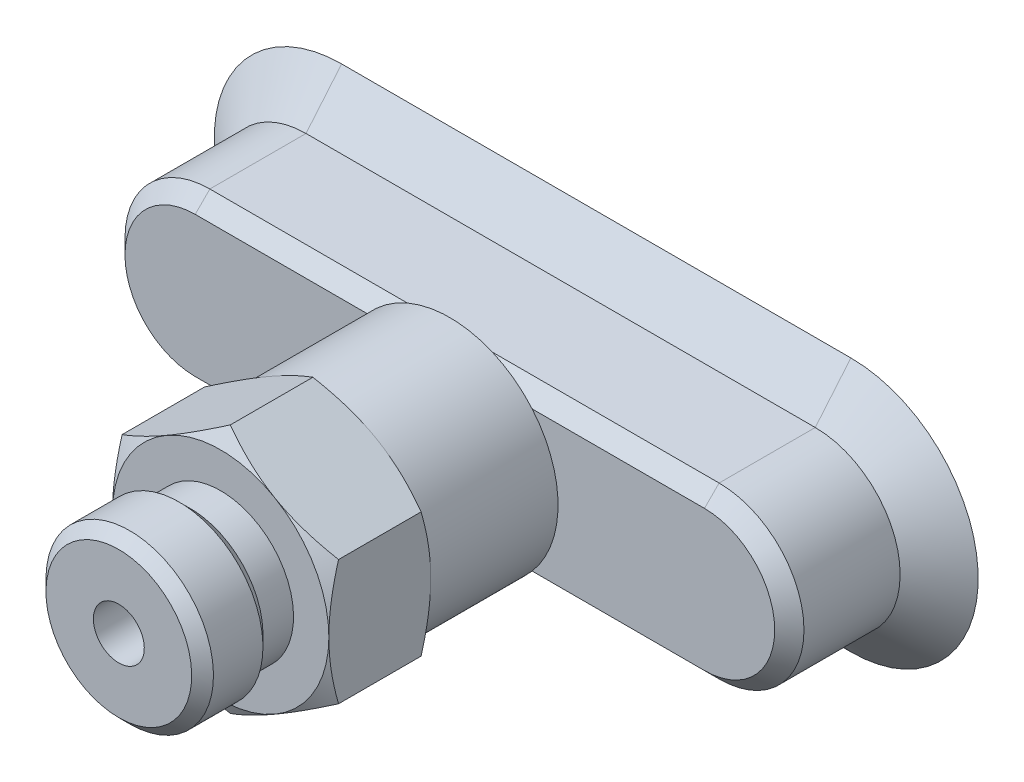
ISO-10303-21;
HEADER;
FILE_DESCRIPTION(('STEP AP214'),'2;1');
FILE_NAME('part.step','',(''),(''),'','','');
FILE_SCHEMA(('AUTOMOTIVE_DESIGN { 1 0 10303 214 1 1 1 1 }'));
ENDSEC;
DATA;
#1=APPLICATION_CONTEXT('core data for automotive mechanical design processes');
#2=APPLICATION_PROTOCOL_DEFINITION('international standard','automotive_design',2000,#1);
#3=PRODUCT_CONTEXT('',#1,'mechanical');
#4=PRODUCT('Part','Part','',(#3));
#5=PRODUCT_RELATED_PRODUCT_CATEGORY('part','',(#4));
#6=PRODUCT_DEFINITION_FORMATION('','',#4);
#7=PRODUCT_DEFINITION_CONTEXT('part definition',#1,'design');
#8=PRODUCT_DEFINITION('design','',#6,#7);
#9=PRODUCT_DEFINITION_SHAPE('','',#8);
#10=(LENGTH_UNIT() NAMED_UNIT(*) SI_UNIT(.MILLI.,.METRE.));
#11=(NAMED_UNIT(*) PLANE_ANGLE_UNIT() SI_UNIT($,.RADIAN.));
#12=(NAMED_UNIT(*) SI_UNIT($,.STERADIAN.) SOLID_ANGLE_UNIT());
#13=UNCERTAINTY_MEASURE_WITH_UNIT(LENGTH_MEASURE(1.E-05),#10,'distance_accuracy_value','');
#14=(GEOMETRIC_REPRESENTATION_CONTEXT(3) GLOBAL_UNCERTAINTY_ASSIGNED_CONTEXT((#13)) GLOBAL_UNIT_ASSIGNED_CONTEXT((#10,
#11,#12)) REPRESENTATION_CONTEXT('',''));
#15=CARTESIAN_POINT('',(0.,0.,0.));
#16=DIRECTION('',(0.,0.,1.));
#17=DIRECTION('',(1.,0.,0.));
#18=AXIS2_PLACEMENT_3D('',#15,#16,#17);
#19=CARTESIAN_POINT('',(18.5,2.,1.78571428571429));
#20=DIRECTION('',(0.,1.,0.));
#21=DIRECTION('',(-1.,0.,0.));
#22=AXIS2_PLACEMENT_3D('',#19,#20,#21);
#23=PLANE('',#22);
#24=DIRECTION('',(-1.,0.,0.));
#25=VECTOR('',#24,1.);
#26=CARTESIAN_POINT('',(18.5,2.,1.78571428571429));
#27=LINE('',#26,#25);
#28=CARTESIAN_POINT('',(-6.5,2.,1.78571428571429));
#29=VERTEX_POINT('',#28);
#30=CARTESIAN_POINT('',(-9.5,2.,1.78571428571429));
#31=VERTEX_POINT('',#30);
#32=EDGE_CURVE('E1172',#29,#31,#27,.T.);
#33=ORIENTED_EDGE('',*,*,#32,.T.);
#34=DIRECTION('',(0.,0.,1.));
#35=VECTOR('',#34,1.);
#36=CARTESIAN_POINT('',(-9.5,2.,1.78571428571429));
#37=LINE('',#36,#35);
#38=CARTESIAN_POINT('',(-9.5,2.,3.28571428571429));
#39=VERTEX_POINT('',#38);
#40=EDGE_CURVE('E833',#31,#39,#37,.T.);
#41=ORIENTED_EDGE('',*,*,#40,.T.);
#42=DIRECTION('',(-1.,0.,0.));
#43=VECTOR('',#42,1.);
#44=CARTESIAN_POINT('',(18.5,2.,3.28571428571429));
#45=LINE('',#44,#43);
#46=CARTESIAN_POINT('',(-6.5,2.,3.28571428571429));
#47=VERTEX_POINT('',#46);
#48=EDGE_CURVE('E1062',#47,#39,#45,.T.);
#49=ORIENTED_EDGE('',*,*,#48,.F.);
#50=DIRECTION('',(0.,0.,1.));
#51=VECTOR('',#50,1.);
#52=CARTESIAN_POINT('',(-6.5,2.,1.78571428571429));
#53=LINE('',#52,#51);
#54=EDGE_CURVE('E908',#29,#47,#53,.T.);
#55=ORIENTED_EDGE('',*,*,#54,.F.);
#56=EDGE_LOOP('',(#33,#41,#49,#55));
#57=FACE_BOUND('',#56,.T.);
#58=ADVANCED_FACE('F15',(#57),#23,.T.);
#59=CARTESIAN_POINT('',(18.4430869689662,2.8,1.78571428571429));
#60=DIRECTION('',(0.,1.,0.));
#61=DIRECTION('',(-1.,0.,0.));
#62=AXIS2_PLACEMENT_3D('',#59,#60,#61);
#63=PLANE('',#62);
#64=DIRECTION('',(0.,0.,-1.));
#65=VECTOR('',#64,1.);
#66=CARTESIAN_POINT('',(-9.26885775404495,2.8,1.78571428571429));
#67=LINE('',#66,#65);
#68=CARTESIAN_POINT('',(-9.26885775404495,2.8,3.28571428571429));
#69=VERTEX_POINT('',#68);
#70=CARTESIAN_POINT('',(-9.26885775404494,2.8,1.78571428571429));
#71=VERTEX_POINT('',#70);
#72=EDGE_CURVE('E1159',#69,#71,#67,.T.);
#73=ORIENTED_EDGE('',*,*,#72,.T.);
#74=DIRECTION('',(-1.,0.,0.));
#75=VECTOR('',#74,1.);
#76=CARTESIAN_POINT('',(18.4430869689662,2.8,1.78571428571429));
#77=LINE('',#76,#75);
#78=CARTESIAN_POINT('',(-6.73114224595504,2.8,1.78571428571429));
#79=VERTEX_POINT('',#78);
#80=EDGE_CURVE('E1162',#79,#71,#77,.T.);
#81=ORIENTED_EDGE('',*,*,#80,.F.);
#82=DIRECTION('',(0.,0.,1.));
#83=VECTOR('',#82,1.);
#84=CARTESIAN_POINT('',(-6.73114224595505,2.8,1.78571428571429));
#85=LINE('',#84,#83);
#86=CARTESIAN_POINT('',(-6.73114224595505,2.8,3.28571428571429));
#87=VERTEX_POINT('',#86);
#88=EDGE_CURVE('E1156',#79,#87,#85,.T.);
#89=ORIENTED_EDGE('',*,*,#88,.T.);
#90=DIRECTION('',(-1.,0.,0.));
#91=VECTOR('',#90,1.);
#92=CARTESIAN_POINT('',(18.4430869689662,2.8,3.28571428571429));
#93=LINE('',#92,#91);
#94=EDGE_CURVE('E1192',#87,#69,#93,.T.);
#95=ORIENTED_EDGE('',*,*,#94,.T.);
#96=EDGE_LOOP('',(#73,#81,#89,#95));
#97=FACE_BOUND('',#96,.T.);
#98=ADVANCED_FACE('F2834',(#97),#63,.F.);
#99=CARTESIAN_POINT('',(-18.5,-2.,1.78571428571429));
#100=DIRECTION('',(0.,-1.,0.));
#101=DIRECTION('',(0.,0.,-1.));
#102=AXIS2_PLACEMENT_3D('',#99,#100,#101);
#103=PLANE('',#102);
#104=DIRECTION('',(1.,0.,0.));
#105=VECTOR('',#104,1.);
#106=CARTESIAN_POINT('',(-18.5,-2.,3.28571428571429));
#107=LINE('',#106,#105);
#108=CARTESIAN_POINT('',(-9.5,-2.,3.28571428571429));
#109=VERTEX_POINT('',#108);
#110=CARTESIAN_POINT('',(-6.5,-2.,3.28571428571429));
#111=VERTEX_POINT('',#110);
#112=EDGE_CURVE('E1352',#109,#111,#107,.T.);
#113=ORIENTED_EDGE('',*,*,#112,.F.);
#114=DIRECTION('',(0.,0.,1.));
#115=VECTOR('',#114,1.);
#116=CARTESIAN_POINT('',(-9.5,-2.,1.78571428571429));
#117=LINE('',#116,#115);
#118=CARTESIAN_POINT('',(-9.5,-2.,1.78571428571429));
#119=VERTEX_POINT('',#118);
#120=EDGE_CURVE('E785',#119,#109,#117,.T.);
#121=ORIENTED_EDGE('',*,*,#120,.F.);
#122=DIRECTION('',(1.,0.,0.));
#123=VECTOR('',#122,1.);
#124=CARTESIAN_POINT('',(-18.5,-2.,1.78571428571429));
#125=LINE('',#124,#123);
#126=CARTESIAN_POINT('',(-6.5,-2.,1.78571428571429));
#127=VERTEX_POINT('',#126);
#128=EDGE_CURVE('E1288',#119,#127,#125,.T.);
#129=ORIENTED_EDGE('',*,*,#128,.T.);
#130=DIRECTION('',(0.,0.,1.));
#131=VECTOR('',#130,1.);
#132=CARTESIAN_POINT('',(-6.5,-2.,1.78571428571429));
#133=LINE('',#132,#131);
#134=EDGE_CURVE('E879',#127,#111,#133,.T.);
#135=ORIENTED_EDGE('',*,*,#134,.T.);
#136=EDGE_LOOP('',(#113,#121,#129,#135));
#137=FACE_BOUND('',#136,.T.);
#138=ADVANCED_FACE('F2829',(#137),#103,.T.);
#139=CARTESIAN_POINT('',(-18.4430869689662,-2.8,1.78571428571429));
#140=DIRECTION('',(0.,-1.,0.));
#141=DIRECTION('',(0.,0.,-1.));
#142=AXIS2_PLACEMENT_3D('',#139,#140,#141);
#143=PLANE('',#142);
#144=DIRECTION('',(0.,0.,-1.));
#145=VECTOR('',#144,1.);
#146=CARTESIAN_POINT('',(-6.73114224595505,-2.8,1.78571428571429));
#147=LINE('',#146,#145);
#148=CARTESIAN_POINT('',(-6.73114224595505,-2.8,3.28571428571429));
#149=VERTEX_POINT('',#148);
#150=CARTESIAN_POINT('',(-6.73114224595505,-2.8,1.78571428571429));
#151=VERTEX_POINT('',#150);
#152=EDGE_CURVE('E765',#149,#151,#147,.T.);
#153=ORIENTED_EDGE('',*,*,#152,.T.);
#154=DIRECTION('',(1.,0.,0.));
#155=VECTOR('',#154,1.);
#156=CARTESIAN_POINT('',(-18.4430869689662,-2.8,1.78571428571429));
#157=LINE('',#156,#155);
#158=CARTESIAN_POINT('',(-9.26885775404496,-2.8,1.78571428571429));
#159=VERTEX_POINT('',#158);
#160=EDGE_CURVE('E1133',#159,#151,#157,.T.);
#161=ORIENTED_EDGE('',*,*,#160,.F.);
#162=DIRECTION('',(0.,0.,1.));
#163=VECTOR('',#162,1.);
#164=CARTESIAN_POINT('',(-9.26885775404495,-2.8,1.78571428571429));
#165=LINE('',#164,#163);
#166=CARTESIAN_POINT('',(-9.26885775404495,-2.8,3.28571428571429));
#167=VERTEX_POINT('',#166);
#168=EDGE_CURVE('E768',#159,#167,#165,.T.);
#169=ORIENTED_EDGE('',*,*,#168,.T.);
#170=DIRECTION('',(1.,0.,0.));
#171=VECTOR('',#170,1.);
#172=CARTESIAN_POINT('',(-18.4430869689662,-2.8,3.28571428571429));
#173=LINE('',#172,#171);
#174=EDGE_CURVE('E1203',#167,#149,#173,.T.);
#175=ORIENTED_EDGE('',*,*,#174,.T.);
#176=EDGE_LOOP('',(#153,#161,#169,#175));
#177=FACE_BOUND('',#176,.T.);
#178=ADVANCED_FACE('F2085',(#177),#143,.F.);
#179=CARTESIAN_POINT('',(-18.5,-0.399999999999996,1.78571428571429));
#180=DIRECTION('',(0.,-1.,0.));
#181=DIRECTION('',(0.,0.,-1.));
#182=AXIS2_PLACEMENT_3D('',#179,#180,#181);
#183=PLANE('',#182);
#184=DIRECTION('',(1.,0.,0.));
#185=VECTOR('',#184,1.);
#186=CARTESIAN_POINT('',(-18.5,-0.399999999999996,3.28571428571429));
#187=LINE('',#186,#185);
#188=CARTESIAN_POINT('',(-9.5,-0.399999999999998,3.28571428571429));
#189=VERTEX_POINT('',#188);
#190=CARTESIAN_POINT('',(-6.5,-0.399999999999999,3.28571428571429));
#191=VERTEX_POINT('',#190);
#192=EDGE_CURVE('E1274',#189,#191,#187,.T.);
#193=ORIENTED_EDGE('',*,*,#192,.F.);
#194=DIRECTION('',(0.,0.,1.));
#195=VECTOR('',#194,1.);
#196=CARTESIAN_POINT('',(-9.5,-0.399999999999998,1.78571428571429));
#197=LINE('',#196,#195);
#198=CARTESIAN_POINT('',(-9.5,-0.399999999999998,1.78571428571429));
#199=VERTEX_POINT('',#198);
#200=EDGE_CURVE('E832',#199,#189,#197,.T.);
#201=ORIENTED_EDGE('',*,*,#200,.F.);
#202=DIRECTION('',(1.,0.,0.));
#203=VECTOR('',#202,1.);
#204=CARTESIAN_POINT('',(-18.5,-0.399999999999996,1.78571428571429));
#205=LINE('',#204,#203);
#206=CARTESIAN_POINT('',(-6.5,-0.399999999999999,1.78571428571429));
#207=VERTEX_POINT('',#206);
#208=EDGE_CURVE('E1176',#199,#207,#205,.T.);
#209=ORIENTED_EDGE('',*,*,#208,.T.);
#210=DIRECTION('',(0.,0.,-1.));
#211=VECTOR('',#210,1.);
#212=CARTESIAN_POINT('',(-6.5,-0.399999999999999,1.78571428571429));
#213=LINE('',#212,#211);
#214=EDGE_CURVE('E907',#191,#207,#213,.T.);
#215=ORIENTED_EDGE('',*,*,#214,.F.);
#216=EDGE_LOOP('',(#193,#201,#209,#215));
#217=FACE_BOUND('',#216,.T.);
#218=ADVANCED_FACE('F3238',(#217),#183,.T.);
#219=CARTESIAN_POINT('',(18.5,-1.2,1.78571428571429));
#220=DIRECTION('',(0.,1.,0.));
#221=DIRECTION('',(-1.,0.,0.));
#222=AXIS2_PLACEMENT_3D('',#219,#220,#221);
#223=PLANE('',#222);
#224=DIRECTION('',(-1.,0.,0.));
#225=VECTOR('',#224,1.);
#226=CARTESIAN_POINT('',(18.5,-1.2,1.78571428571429));
#227=LINE('',#226,#225);
#228=CARTESIAN_POINT('',(-6.5,-1.2,1.78571428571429));
#229=VERTEX_POINT('',#228);
#230=CARTESIAN_POINT('',(-9.5,-1.2,1.78571428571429));
#231=VERTEX_POINT('',#230);
#232=EDGE_CURVE('E1134',#229,#231,#227,.T.);
#233=ORIENTED_EDGE('',*,*,#232,.T.);
#234=DIRECTION('',(0.,0.,-1.));
#235=VECTOR('',#234,1.);
#236=CARTESIAN_POINT('',(-9.5,-1.2,1.78571428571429));
#237=LINE('',#236,#235);
#238=CARTESIAN_POINT('',(-9.5,-1.2,3.28571428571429));
#239=VERTEX_POINT('',#238);
#240=EDGE_CURVE('E786',#239,#231,#237,.T.);
#241=ORIENTED_EDGE('',*,*,#240,.F.);
#242=DIRECTION('',(-1.,0.,0.));
#243=VECTOR('',#242,1.);
#244=CARTESIAN_POINT('',(18.5,-1.2,3.28571428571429));
#245=LINE('',#244,#243);
#246=CARTESIAN_POINT('',(-6.5,-1.2,3.28571428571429));
#247=VERTEX_POINT('',#246);
#248=EDGE_CURVE('E1061',#247,#239,#245,.T.);
#249=ORIENTED_EDGE('',*,*,#248,.F.);
#250=DIRECTION('',(0.,0.,1.));
#251=VECTOR('',#250,1.);
#252=CARTESIAN_POINT('',(-6.5,-1.2,1.78571428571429));
#253=LINE('',#252,#251);
#254=EDGE_CURVE('E1213',#229,#247,#253,.T.);
#255=ORIENTED_EDGE('',*,*,#254,.F.);
#256=EDGE_LOOP('',(#233,#241,#249,#255));
#257=FACE_BOUND('',#256,.T.);
#258=ADVANCED_FACE('F3177',(#257),#223,.T.);
#259=CARTESIAN_POINT('',(-18.5,1.2,1.78571428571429));
#260=DIRECTION('',(0.,-1.,0.));
#261=DIRECTION('',(0.,0.,-1.));
#262=AXIS2_PLACEMENT_3D('',#259,#260,#261);
#263=PLANE('',#262);
#264=DIRECTION('',(1.,0.,0.));
#265=VECTOR('',#264,1.);
#266=CARTESIAN_POINT('',(-18.5,1.2,3.28571428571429));
#267=LINE('',#266,#265);
#268=CARTESIAN_POINT('',(-9.5,1.2,3.28571428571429));
#269=VERTEX_POINT('',#268);
#270=CARTESIAN_POINT('',(-6.5,1.2,3.28571428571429));
#271=VERTEX_POINT('',#270);
#272=EDGE_CURVE('E1065',#269,#271,#267,.T.);
#273=ORIENTED_EDGE('',*,*,#272,.F.);
#274=DIRECTION('',(0.,0.,1.));
#275=VECTOR('',#274,1.);
#276=CARTESIAN_POINT('',(-9.5,1.2,1.78571428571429));
#277=LINE('',#276,#275);
#278=CARTESIAN_POINT('',(-9.5,1.2,1.78571428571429));
#279=VERTEX_POINT('',#278);
#280=EDGE_CURVE('E878',#279,#269,#277,.T.);
#281=ORIENTED_EDGE('',*,*,#280,.F.);
#282=DIRECTION('',(1.,0.,0.));
#283=VECTOR('',#282,1.);
#284=CARTESIAN_POINT('',(-18.5,1.2,1.78571428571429));
#285=LINE('',#284,#283);
#286=CARTESIAN_POINT('',(-6.5,1.2,1.78571428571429));
#287=VERTEX_POINT('',#286);
#288=EDGE_CURVE('E1177',#279,#287,#285,.T.);
#289=ORIENTED_EDGE('',*,*,#288,.T.);
#290=DIRECTION('',(0.,0.,-1.));
#291=VECTOR('',#290,1.);
#292=CARTESIAN_POINT('',(-6.5,1.2,1.78571428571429));
#293=LINE('',#292,#291);
#294=EDGE_CURVE('E1167',#271,#287,#293,.T.);
#295=ORIENTED_EDGE('',*,*,#294,.F.);
#296=EDGE_LOOP('',(#273,#281,#289,#295));
#297=FACE_BOUND('',#296,.T.);
#298=ADVANCED_FACE('F2981',(#297),#263,.T.);
#299=CARTESIAN_POINT('',(18.5,0.399999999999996,1.78571428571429));
#300=DIRECTION('',(0.,1.,0.));
#301=DIRECTION('',(-1.,0.,0.));
#302=AXIS2_PLACEMENT_3D('',#299,#300,#301);
#303=PLANE('',#302);
#304=DIRECTION('',(-1.,0.,0.));
#305=VECTOR('',#304,1.);
#306=CARTESIAN_POINT('',(18.5,0.399999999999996,1.78571428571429));
#307=LINE('',#306,#305);
#308=CARTESIAN_POINT('',(-6.5,0.400000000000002,1.78571428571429));
#309=VERTEX_POINT('',#308);
#310=CARTESIAN_POINT('',(-9.5,0.400000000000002,1.78571428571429));
#311=VERTEX_POINT('',#310);
#312=EDGE_CURVE('E1291',#309,#311,#307,.T.);
#313=ORIENTED_EDGE('',*,*,#312,.T.);
#314=DIRECTION('',(0.,0.,-1.));
#315=VECTOR('',#314,1.);
#316=CARTESIAN_POINT('',(-9.5,0.400000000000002,1.78571428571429));
#317=LINE('',#316,#315);
#318=CARTESIAN_POINT('',(-9.5,0.400000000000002,3.28571428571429));
#319=VERTEX_POINT('',#318);
#320=EDGE_CURVE('E1243',#319,#311,#317,.T.);
#321=ORIENTED_EDGE('',*,*,#320,.F.);
#322=DIRECTION('',(-1.,0.,0.));
#323=VECTOR('',#322,1.);
#324=CARTESIAN_POINT('',(18.5,0.399999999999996,3.28571428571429));
#325=LINE('',#324,#323);
#326=CARTESIAN_POINT('',(-6.5,0.400000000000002,3.28571428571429));
#327=VERTEX_POINT('',#326);
#328=EDGE_CURVE('E2151',#327,#319,#325,.T.);
#329=ORIENTED_EDGE('',*,*,#328,.F.);
#330=DIRECTION('',(0.,0.,1.));
#331=VECTOR('',#330,1.);
#332=CARTESIAN_POINT('',(-6.5,0.400000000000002,1.78571428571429));
#333=LINE('',#332,#331);
#334=EDGE_CURVE('E986',#309,#327,#333,.T.);
#335=ORIENTED_EDGE('',*,*,#334,.F.);
#336=EDGE_LOOP('',(#313,#321,#329,#335));
#337=FACE_BOUND('',#336,.T.);
#338=ADVANCED_FACE('F2975',(#337),#303,.T.);
#339=CARTESIAN_POINT('',(18.4430869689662,2.8,1.78571428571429));
#340=DIRECTION('',(0.,1.,0.));
#341=DIRECTION('',(-1.,0.,0.));
#342=AXIS2_PLACEMENT_3D('',#339,#340,#341);
#343=PLANE('',#342);
#344=DIRECTION('',(0.,0.,-1.));
#345=VECTOR('',#344,1.);
#346=CARTESIAN_POINT('',(-18.268857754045,2.8,1.78571428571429));
#347=LINE('',#346,#345);
#348=CARTESIAN_POINT('',(-18.268857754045,2.8,3.28571428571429));
#349=VERTEX_POINT('',#348);
#350=CARTESIAN_POINT('',(-18.2688577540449,2.8,1.78571428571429));
#351=VERTEX_POINT('',#350);
#352=EDGE_CURVE('E1028',#349,#351,#347,.T.);
#353=ORIENTED_EDGE('',*,*,#352,.T.);
#354=DIRECTION('',(-1.,0.,0.));
#355=VECTOR('',#354,1.);
#356=CARTESIAN_POINT('',(18.4430869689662,2.8,1.78571428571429));
#357=LINE('',#356,#355);
#358=CARTESIAN_POINT('',(-15.731142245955,2.8,1.78571428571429));
#359=VERTEX_POINT('',#358);
#360=EDGE_CURVE('E1042',#359,#351,#357,.T.);
#361=ORIENTED_EDGE('',*,*,#360,.F.);
#362=DIRECTION('',(0.,0.,1.));
#363=VECTOR('',#362,1.);
#364=CARTESIAN_POINT('',(-15.731142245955,2.8,1.78571428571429));
#365=LINE('',#364,#363);
#366=CARTESIAN_POINT('',(-15.731142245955,2.8,3.28571428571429));
#367=VERTEX_POINT('',#366);
#368=EDGE_CURVE('E748',#359,#367,#365,.T.);
#369=ORIENTED_EDGE('',*,*,#368,.T.);
#370=DIRECTION('',(-1.,0.,0.));
#371=VECTOR('',#370,1.);
#372=CARTESIAN_POINT('',(18.4430869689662,2.8,3.28571428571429));
#373=LINE('',#372,#371);
#374=EDGE_CURVE('E1247',#367,#349,#373,.T.);
#375=ORIENTED_EDGE('',*,*,#374,.T.);
#376=EDGE_LOOP('',(#353,#361,#369,#375));
#377=FACE_BOUND('',#376,.T.);
#378=ADVANCED_FACE('F2980',(#377),#343,.F.);
#379=CARTESIAN_POINT('',(18.5,2.,1.78571428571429));
#380=DIRECTION('',(0.,1.,0.));
#381=DIRECTION('',(-1.,0.,0.));
#382=AXIS2_PLACEMENT_3D('',#379,#380,#381);
#383=PLANE('',#382);
#384=DIRECTION('',(-1.,0.,0.));
#385=VECTOR('',#384,1.);
#386=CARTESIAN_POINT('',(18.5,2.,1.78571428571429));
#387=LINE('',#386,#385);
#388=CARTESIAN_POINT('',(-15.5,2.,1.78571428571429));
#389=VERTEX_POINT('',#388);
#390=CARTESIAN_POINT('',(-18.5,2.,1.78571428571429));
#391=VERTEX_POINT('',#390);
#392=EDGE_CURVE('E799',#389,#391,#387,.T.);
#393=ORIENTED_EDGE('',*,*,#392,.T.);
#394=DIRECTION('',(0.,0.,1.));
#395=VECTOR('',#394,1.);
#396=CARTESIAN_POINT('',(-18.5,2.,1.78571428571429));
#397=LINE('',#396,#395);
#398=CARTESIAN_POINT('',(-18.5,2.,3.28571428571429));
#399=VERTEX_POINT('',#398);
#400=EDGE_CURVE('E1106',#391,#399,#397,.T.);
#401=ORIENTED_EDGE('',*,*,#400,.T.);
#402=DIRECTION('',(-1.,0.,0.));
#403=VECTOR('',#402,1.);
#404=CARTESIAN_POINT('',(18.5,2.,3.28571428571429));
#405=LINE('',#404,#403);
#406=CARTESIAN_POINT('',(-15.5,2.,3.28571428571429));
#407=VERTEX_POINT('',#406);
#408=EDGE_CURVE('E798',#407,#399,#405,.T.);
#409=ORIENTED_EDGE('',*,*,#408,.F.);
#410=DIRECTION('',(0.,0.,1.));
#411=VECTOR('',#410,1.);
#412=CARTESIAN_POINT('',(-15.5,2.,1.78571428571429));
#413=LINE('',#412,#411);
#414=EDGE_CURVE('E934',#389,#407,#413,.T.);
#415=ORIENTED_EDGE('',*,*,#414,.F.);
#416=EDGE_LOOP('',(#393,#401,#409,#415));
#417=FACE_BOUND('',#416,.T.);
#418=ADVANCED_FACE('F3168',(#417),#383,.T.);
#419=CARTESIAN_POINT('',(-18.5,-2.,1.78571428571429));
#420=DIRECTION('',(0.,-1.,0.));
#421=DIRECTION('',(0.,0.,-1.));
#422=AXIS2_PLACEMENT_3D('',#419,#420,#421);
#423=PLANE('',#422);
#424=DIRECTION('',(1.,0.,0.));
#425=VECTOR('',#424,1.);
#426=CARTESIAN_POINT('',(-18.5,-2.,3.28571428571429));
#427=LINE('',#426,#425);
#428=CARTESIAN_POINT('',(-18.5,-2.,3.28571428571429));
#429=VERTEX_POINT('',#428);
#430=CARTESIAN_POINT('',(-15.5,-2.,3.28571428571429));
#431=VERTEX_POINT('',#430);
#432=EDGE_CURVE('E966',#429,#431,#427,.T.);
#433=ORIENTED_EDGE('',*,*,#432,.F.);
#434=DIRECTION('',(0.,0.,1.));
#435=VECTOR('',#434,1.);
#436=CARTESIAN_POINT('',(-18.5,-2.,1.78571428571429));
#437=LINE('',#436,#435);
#438=CARTESIAN_POINT('',(-18.5,-2.,1.78571428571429));
#439=VERTEX_POINT('',#438);
#440=EDGE_CURVE('E1180',#439,#429,#437,.T.);
#441=ORIENTED_EDGE('',*,*,#440,.F.);
#442=DIRECTION('',(1.,0.,0.));
#443=VECTOR('',#442,1.);
#444=CARTESIAN_POINT('',(-18.5,-2.,1.78571428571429));
#445=LINE('',#444,#443);
#446=CARTESIAN_POINT('',(-15.5,-2.,1.78571428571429));
#447=VERTEX_POINT('',#446);
#448=EDGE_CURVE('E939',#439,#447,#445,.T.);
#449=ORIENTED_EDGE('',*,*,#448,.T.);
#450=DIRECTION('',(0.,0.,1.));
#451=VECTOR('',#450,1.);
#452=CARTESIAN_POINT('',(-15.5,-2.,1.78571428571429));
#453=LINE('',#452,#451);
#454=EDGE_CURVE('E1066',#447,#431,#453,.T.);
#455=ORIENTED_EDGE('',*,*,#454,.T.);
#456=EDGE_LOOP('',(#433,#441,#449,#455));
#457=FACE_BOUND('',#456,.T.);
#458=ADVANCED_FACE('F3331',(#457),#423,.T.);
#459=CARTESIAN_POINT('',(-18.4430869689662,-2.8,1.78571428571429));
#460=DIRECTION('',(0.,-1.,0.));
#461=DIRECTION('',(0.,0.,-1.));
#462=AXIS2_PLACEMENT_3D('',#459,#460,#461);
#463=PLANE('',#462);
#464=DIRECTION('',(0.,0.,-1.));
#465=VECTOR('',#464,1.);
#466=CARTESIAN_POINT('',(-15.7311422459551,-2.8,1.78571428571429));
#467=LINE('',#466,#465);
#468=CARTESIAN_POINT('',(-15.7311422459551,-2.8,3.28571428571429));
#469=VERTEX_POINT('',#468);
#470=CARTESIAN_POINT('',(-15.7311422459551,-2.8,1.78571428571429));
#471=VERTEX_POINT('',#470);
#472=EDGE_CURVE('E747',#469,#471,#467,.T.);
#473=ORIENTED_EDGE('',*,*,#472,.T.);
#474=DIRECTION('',(1.,0.,0.));
#475=VECTOR('',#474,1.);
#476=CARTESIAN_POINT('',(-18.4430869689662,-2.8,1.78571428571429));
#477=LINE('',#476,#475);
#478=CARTESIAN_POINT('',(-18.268857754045,-2.8,1.78571428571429));
#479=VERTEX_POINT('',#478);
#480=EDGE_CURVE('E928',#479,#471,#477,.T.);
#481=ORIENTED_EDGE('',*,*,#480,.F.);
#482=DIRECTION('',(0.,0.,1.));
#483=VECTOR('',#482,1.);
#484=CARTESIAN_POINT('',(-18.268857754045,-2.8,1.78571428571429));
#485=LINE('',#484,#483);
#486=CARTESIAN_POINT('',(-18.268857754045,-2.8,3.28571428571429));
#487=VERTEX_POINT('',#486);
#488=EDGE_CURVE('E1038',#479,#487,#485,.T.);
#489=ORIENTED_EDGE('',*,*,#488,.T.);
#490=DIRECTION('',(1.,0.,0.));
#491=VECTOR('',#490,1.);
#492=CARTESIAN_POINT('',(-18.4430869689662,-2.8,3.28571428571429));
#493=LINE('',#492,#491);
#494=EDGE_CURVE('E704',#487,#469,#493,.T.);
#495=ORIENTED_EDGE('',*,*,#494,.T.);
#496=EDGE_LOOP('',(#473,#481,#489,#495));
#497=FACE_BOUND('',#496,.T.);
#498=ADVANCED_FACE('F1675',(#497),#463,.F.);
#499=CARTESIAN_POINT('',(-18.5,-0.399999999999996,1.78571428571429));
#500=DIRECTION('',(0.,-1.,0.));
#501=DIRECTION('',(0.,0.,-1.));
#502=AXIS2_PLACEMENT_3D('',#499,#500,#501);
#503=PLANE('',#502);
#504=DIRECTION('',(1.,0.,0.));
#505=VECTOR('',#504,1.);
#506=CARTESIAN_POINT('',(-18.5,-0.399999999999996,3.28571428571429));
#507=LINE('',#506,#505);
#508=CARTESIAN_POINT('',(-18.5,-0.399999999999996,3.28571428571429));
#509=VERTEX_POINT('',#508);
#510=CARTESIAN_POINT('',(-15.5,-0.399999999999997,3.28571428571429));
#511=VERTEX_POINT('',#510);
#512=EDGE_CURVE('E738',#509,#511,#507,.T.);
#513=ORIENTED_EDGE('',*,*,#512,.F.);
#514=DIRECTION('',(0.,0.,1.));
#515=VECTOR('',#514,1.);
#516=CARTESIAN_POINT('',(-18.5,-0.399999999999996,1.78571428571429));
#517=LINE('',#516,#515);
#518=CARTESIAN_POINT('',(-18.5,-0.399999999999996,1.78571428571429));
#519=VERTEX_POINT('',#518);
#520=EDGE_CURVE('E1083',#519,#509,#517,.T.);
#521=ORIENTED_EDGE('',*,*,#520,.F.);
#522=DIRECTION('',(1.,0.,0.));
#523=VECTOR('',#522,1.);
#524=CARTESIAN_POINT('',(-18.5,-0.399999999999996,1.78571428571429));
#525=LINE('',#524,#523);
#526=CARTESIAN_POINT('',(-15.5,-0.399999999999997,1.78571428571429));
#527=VERTEX_POINT('',#526);
#528=EDGE_CURVE('E802',#519,#527,#525,.T.);
#529=ORIENTED_EDGE('',*,*,#528,.T.);
#530=DIRECTION('',(0.,0.,-1.));
#531=VECTOR('',#530,1.);
#532=CARTESIAN_POINT('',(-15.5,-0.399999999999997,1.78571428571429));
#533=LINE('',#532,#531);
#534=EDGE_CURVE('E1002',#511,#527,#533,.T.);
#535=ORIENTED_EDGE('',*,*,#534,.F.);
#536=EDGE_LOOP('',(#513,#521,#529,#535));
#537=FACE_BOUND('',#536,.T.);
#538=ADVANCED_FACE('F3111',(#537),#503,.T.);
#539=CARTESIAN_POINT('',(18.5,-1.2,1.78571428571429));
#540=DIRECTION('',(0.,1.,0.));
#541=DIRECTION('',(-1.,0.,0.));
#542=AXIS2_PLACEMENT_3D('',#539,#540,#541);
#543=PLANE('',#542);
#544=DIRECTION('',(-1.,0.,0.));
#545=VECTOR('',#544,1.);
#546=CARTESIAN_POINT('',(18.5,-1.2,1.78571428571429));
#547=LINE('',#546,#545);
#548=CARTESIAN_POINT('',(-15.5,-1.2,1.78571428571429));
#549=VERTEX_POINT('',#548);
#550=CARTESIAN_POINT('',(-18.5,-1.2,1.78571428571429));
#551=VERTEX_POINT('',#550);
#552=EDGE_CURVE('E942',#549,#551,#547,.T.);
#553=ORIENTED_EDGE('',*,*,#552,.T.);
#554=DIRECTION('',(0.,0.,1.));
#555=VECTOR('',#554,1.);
#556=CARTESIAN_POINT('',(-18.5,-1.2,1.78571428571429));
#557=LINE('',#556,#555);
#558=CARTESIAN_POINT('',(-18.5,-1.2,3.28571428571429));
#559=VERTEX_POINT('',#558);
#560=EDGE_CURVE('E1055',#551,#559,#557,.T.);
#561=ORIENTED_EDGE('',*,*,#560,.T.);
#562=DIRECTION('',(-1.,0.,0.));
#563=VECTOR('',#562,1.);
#564=CARTESIAN_POINT('',(18.5,-1.2,3.28571428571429));
#565=LINE('',#564,#563);
#566=CARTESIAN_POINT('',(-15.5,-1.2,3.28571428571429));
#567=VERTEX_POINT('',#566);
#568=EDGE_CURVE('E671',#567,#559,#565,.T.);
#569=ORIENTED_EDGE('',*,*,#568,.F.);
#570=DIRECTION('',(0.,0.,1.));
#571=VECTOR('',#570,1.);
#572=CARTESIAN_POINT('',(-15.5,-1.2,1.78571428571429));
#573=LINE('',#572,#571);
#574=EDGE_CURVE('E791',#549,#567,#573,.T.);
#575=ORIENTED_EDGE('',*,*,#574,.F.);
#576=EDGE_LOOP('',(#553,#561,#569,#575));
#577=FACE_BOUND('',#576,.T.);
#578=ADVANCED_FACE('F3116',(#577),#543,.T.);
#579=CARTESIAN_POINT('',(-18.5,1.2,1.78571428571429));
#580=DIRECTION('',(0.,-1.,0.));
#581=DIRECTION('',(0.,0.,-1.));
#582=AXIS2_PLACEMENT_3D('',#579,#580,#581);
#583=PLANE('',#582);
#584=DIRECTION('',(1.,0.,0.));
#585=VECTOR('',#584,1.);
#586=CARTESIAN_POINT('',(-18.5,1.2,3.28571428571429));
#587=LINE('',#586,#585);
#588=CARTESIAN_POINT('',(-18.5,1.2,3.28571428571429));
#589=VERTEX_POINT('',#588);
#590=CARTESIAN_POINT('',(-15.5,1.2,3.28571428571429));
#591=VERTEX_POINT('',#590);
#592=EDGE_CURVE('E1357',#589,#591,#587,.T.);
#593=ORIENTED_EDGE('',*,*,#592,.F.);
#594=DIRECTION('',(0.,0.,1.));
#595=VECTOR('',#594,1.);
#596=CARTESIAN_POINT('',(-18.5,1.2,1.78571428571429));
#597=LINE('',#596,#595);
#598=CARTESIAN_POINT('',(-18.5,1.2,1.78571428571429));
#599=VERTEX_POINT('',#598);
#600=EDGE_CURVE('E1079',#599,#589,#597,.T.);
#601=ORIENTED_EDGE('',*,*,#600,.F.);
#602=DIRECTION('',(1.,0.,0.));
#603=VECTOR('',#602,1.);
#604=CARTESIAN_POINT('',(-18.5,1.2,1.78571428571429));
#605=LINE('',#604,#603);
#606=CARTESIAN_POINT('',(-15.5,1.2,1.78571428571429));
#607=VERTEX_POINT('',#606);
#608=EDGE_CURVE('E803',#599,#607,#605,.T.);
#609=ORIENTED_EDGE('',*,*,#608,.T.);
#610=DIRECTION('',(0.,0.,-1.));
#611=VECTOR('',#610,1.);
#612=CARTESIAN_POINT('',(-15.5,1.2,1.78571428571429));
#613=LINE('',#612,#611);
#614=EDGE_CURVE('E1202',#591,#607,#613,.T.);
#615=ORIENTED_EDGE('',*,*,#614,.F.);
#616=EDGE_LOOP('',(#593,#601,#609,#615));
#617=FACE_BOUND('',#616,.T.);
#618=ADVANCED_FACE('F3026',(#617),#583,.T.);
#619=CARTESIAN_POINT('',(18.5,0.399999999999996,1.78571428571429));
#620=DIRECTION('',(0.,1.,0.));
#621=DIRECTION('',(-1.,0.,0.));
#622=AXIS2_PLACEMENT_3D('',#619,#620,#621);
#623=PLANE('',#622);
#624=DIRECTION('',(-1.,0.,0.));
#625=VECTOR('',#624,1.);
#626=CARTESIAN_POINT('',(18.5,0.399999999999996,1.78571428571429));
#627=LINE('',#626,#625);
#628=CARTESIAN_POINT('',(-15.5,0.400000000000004,1.78571428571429));
#629=VERTEX_POINT('',#628);
#630=CARTESIAN_POINT('',(-18.5,0.400000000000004,1.78571428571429));
#631=VERTEX_POINT('',#630);
#632=EDGE_CURVE('E869',#629,#631,#627,.T.);
#633=ORIENTED_EDGE('',*,*,#632,.T.);
#634=DIRECTION('',(0.,0.,1.));
#635=VECTOR('',#634,1.);
#636=CARTESIAN_POINT('',(-18.5,0.400000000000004,1.78571428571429));
#637=LINE('',#636,#635);
#638=CARTESIAN_POINT('',(-18.5,0.400000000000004,3.28571428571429));
#639=VERTEX_POINT('',#638);
#640=EDGE_CURVE('E1056',#631,#639,#637,.T.);
#641=ORIENTED_EDGE('',*,*,#640,.T.);
#642=DIRECTION('',(-1.,0.,0.));
#643=VECTOR('',#642,1.);
#644=CARTESIAN_POINT('',(18.5,0.399999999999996,3.28571428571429));
#645=LINE('',#644,#643);
#646=CARTESIAN_POINT('',(-15.5,0.400000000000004,3.28571428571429));
#647=VERTEX_POINT('',#646);
#648=EDGE_CURVE('E741',#647,#639,#645,.T.);
#649=ORIENTED_EDGE('',*,*,#648,.F.);
#650=DIRECTION('',(0.,0.,1.));
#651=VECTOR('',#650,1.);
#652=CARTESIAN_POINT('',(-15.5,0.400000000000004,1.78571428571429));
#653=LINE('',#652,#651);
#654=EDGE_CURVE('E792',#629,#647,#653,.T.);
#655=ORIENTED_EDGE('',*,*,#654,.F.);
#656=EDGE_LOOP('',(#633,#641,#649,#655));
#657=FACE_BOUND('',#656,.T.);
#658=ADVANCED_FACE('F1941',(#657),#623,.T.);
#659=CARTESIAN_POINT('',(18.4430869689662,2.8,1.78571428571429));
#660=DIRECTION('',(0.,1.,0.));
#661=DIRECTION('',(-1.,0.,0.));
#662=AXIS2_PLACEMENT_3D('',#659,#660,#661);
#663=PLANE('',#662);
#664=DIRECTION('',(0.,0.,-1.));
#665=VECTOR('',#664,1.);
#666=CARTESIAN_POINT('',(6.73114224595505,2.8,1.78571428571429));
#667=LINE('',#666,#665);
#668=CARTESIAN_POINT('',(6.73114224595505,2.8,3.28571428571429));
#669=VERTEX_POINT('',#668);
#670=CARTESIAN_POINT('',(6.73114224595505,2.8,1.78571428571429));
#671=VERTEX_POINT('',#670);
#672=EDGE_CURVE('E1094',#669,#671,#667,.T.);
#673=ORIENTED_EDGE('',*,*,#672,.T.);
#674=DIRECTION('',(-1.,0.,0.));
#675=VECTOR('',#674,1.);
#676=CARTESIAN_POINT('',(18.4430869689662,2.8,1.78571428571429));
#677=LINE('',#676,#675);
#678=CARTESIAN_POINT('',(9.26885775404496,2.8,1.78571428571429));
#679=VERTEX_POINT('',#678);
#680=EDGE_CURVE('E749',#679,#671,#677,.T.);
#681=ORIENTED_EDGE('',*,*,#680,.F.);
#682=DIRECTION('',(0.,0.,1.));
#683=VECTOR('',#682,1.);
#684=CARTESIAN_POINT('',(9.26885775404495,2.8,1.78571428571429));
#685=LINE('',#684,#683);
#686=CARTESIAN_POINT('',(9.26885775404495,2.8,3.28571428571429));
#687=VERTEX_POINT('',#686);
#688=EDGE_CURVE('E1098',#679,#687,#685,.T.);
#689=ORIENTED_EDGE('',*,*,#688,.T.);
#690=DIRECTION('',(-1.,0.,0.));
#691=VECTOR('',#690,1.);
#692=CARTESIAN_POINT('',(18.4430869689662,2.8,3.28571428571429));
#693=LINE('',#692,#691);
#694=EDGE_CURVE('E1251',#687,#669,#693,.T.);
#695=ORIENTED_EDGE('',*,*,#694,.T.);
#696=EDGE_LOOP('',(#673,#681,#689,#695));
#697=FACE_BOUND('',#696,.T.);
#698=ADVANCED_FACE('F1740',(#697),#663,.F.);
#699=CARTESIAN_POINT('',(18.5,2.,1.78571428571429));
#700=DIRECTION('',(0.,1.,0.));
#701=DIRECTION('',(-1.,0.,0.));
#702=AXIS2_PLACEMENT_3D('',#699,#700,#701);
#703=PLANE('',#702);
#704=DIRECTION('',(-1.,0.,0.));
#705=VECTOR('',#704,1.);
#706=CARTESIAN_POINT('',(18.5,2.,1.78571428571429));
#707=LINE('',#706,#705);
#708=CARTESIAN_POINT('',(9.5,2.,1.78571428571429));
#709=VERTEX_POINT('',#708);
#710=CARTESIAN_POINT('',(6.5,2.,1.78571428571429));
#711=VERTEX_POINT('',#710);
#712=EDGE_CURVE('E818',#709,#711,#707,.T.);
#713=ORIENTED_EDGE('',*,*,#712,.T.);
#714=DIRECTION('',(0.,0.,1.));
#715=VECTOR('',#714,1.);
#716=CARTESIAN_POINT('',(6.5,2.,1.78571428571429));
#717=LINE('',#716,#715);
#718=CARTESIAN_POINT('',(6.5,2.,3.28571428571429));
#719=VERTEX_POINT('',#718);
#720=EDGE_CURVE('E759',#711,#719,#717,.T.);
#721=ORIENTED_EDGE('',*,*,#720,.T.);
#722=DIRECTION('',(-1.,0.,0.));
#723=VECTOR('',#722,1.);
#724=CARTESIAN_POINT('',(18.5,2.,3.28571428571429));
#725=LINE('',#724,#723);
#726=CARTESIAN_POINT('',(9.5,2.,3.28571428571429));
#727=VERTEX_POINT('',#726);
#728=EDGE_CURVE('E779',#727,#719,#725,.T.);
#729=ORIENTED_EDGE('',*,*,#728,.F.);
#730=DIRECTION('',(0.,0.,1.));
#731=VECTOR('',#730,1.);
#732=CARTESIAN_POINT('',(9.5,2.,1.78571428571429));
#733=LINE('',#732,#731);
#734=EDGE_CURVE('E913',#709,#727,#733,.T.);
#735=ORIENTED_EDGE('',*,*,#734,.F.);
#736=EDGE_LOOP('',(#713,#721,#729,#735));
#737=FACE_BOUND('',#736,.T.);
#738=ADVANCED_FACE('F2867',(#737),#703,.T.);
#739=CARTESIAN_POINT('',(-18.5,-2.,1.78571428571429));
#740=DIRECTION('',(0.,-1.,0.));
#741=DIRECTION('',(0.,0.,-1.));
#742=AXIS2_PLACEMENT_3D('',#739,#740,#741);
#743=PLANE('',#742);
#744=DIRECTION('',(1.,0.,0.));
#745=VECTOR('',#744,1.);
#746=CARTESIAN_POINT('',(-18.5,-2.,3.28571428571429));
#747=LINE('',#746,#745);
#748=CARTESIAN_POINT('',(6.5,-2.,3.28571428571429));
#749=VERTEX_POINT('',#748);
#750=CARTESIAN_POINT('',(9.5,-2.,3.28571428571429));
#751=VERTEX_POINT('',#750);
#752=EDGE_CURVE('E1057',#749,#751,#747,.T.);
#753=ORIENTED_EDGE('',*,*,#752,.F.);
#754=DIRECTION('',(0.,0.,1.));
#755=VECTOR('',#754,1.);
#756=CARTESIAN_POINT('',(6.5,-2.,1.78571428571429));
#757=LINE('',#756,#755);
#758=CARTESIAN_POINT('',(6.5,-2.,1.78571428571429));
#759=VERTEX_POINT('',#758);
#760=EDGE_CURVE('E943',#759,#749,#757,.T.);
#761=ORIENTED_EDGE('',*,*,#760,.F.);
#762=DIRECTION('',(1.,0.,0.));
#763=VECTOR('',#762,1.);
#764=CARTESIAN_POINT('',(-18.5,-2.,1.78571428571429));
#765=LINE('',#764,#763);
#766=CARTESIAN_POINT('',(9.5,-2.,1.78571428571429));
#767=VERTEX_POINT('',#766);
#768=EDGE_CURVE('E296',#759,#767,#765,.T.);
#769=ORIENTED_EDGE('',*,*,#768,.T.);
#770=DIRECTION('',(0.,0.,1.));
#771=VECTOR('',#770,1.);
#772=CARTESIAN_POINT('',(9.5,-2.,1.78571428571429));
#773=LINE('',#772,#771);
#774=EDGE_CURVE('E953',#767,#751,#773,.T.);
#775=ORIENTED_EDGE('',*,*,#774,.T.);
#776=EDGE_LOOP('',(#753,#761,#769,#775));
#777=FACE_BOUND('',#776,.T.);
#778=ADVANCED_FACE('F2726',(#777),#743,.T.);
#779=CARTESIAN_POINT('',(-18.4430869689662,-2.8,1.78571428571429));
#780=DIRECTION('',(0.,-1.,0.));
#781=DIRECTION('',(0.,0.,-1.));
#782=AXIS2_PLACEMENT_3D('',#779,#780,#781);
#783=PLANE('',#782);
#784=DIRECTION('',(0.,0.,-1.));
#785=VECTOR('',#784,1.);
#786=CARTESIAN_POINT('',(9.26885775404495,-2.8,1.78571428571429));
#787=LINE('',#786,#785);
#788=CARTESIAN_POINT('',(9.26885775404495,-2.8,3.28571428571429));
#789=VERTEX_POINT('',#788);
#790=CARTESIAN_POINT('',(9.26885775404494,-2.8,1.78571428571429));
#791=VERTEX_POINT('',#790);
#792=EDGE_CURVE('E1033',#789,#791,#787,.T.);
#793=ORIENTED_EDGE('',*,*,#792,.T.);
#794=DIRECTION('',(1.,0.,0.));
#795=VECTOR('',#794,1.);
#796=CARTESIAN_POINT('',(-18.4430869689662,-2.8,1.78571428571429));
#797=LINE('',#796,#795);
#798=CARTESIAN_POINT('',(6.73114224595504,-2.8,1.78571428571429));
#799=VERTEX_POINT('',#798);
#800=EDGE_CURVE('E1231',#799,#791,#797,.T.);
#801=ORIENTED_EDGE('',*,*,#800,.F.);
#802=DIRECTION('',(0.,0.,1.));
#803=VECTOR('',#802,1.);
#804=CARTESIAN_POINT('',(6.73114224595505,-2.8,1.78571428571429));
#805=LINE('',#804,#803);
#806=CARTESIAN_POINT('',(6.73114224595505,-2.8,3.28571428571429));
#807=VERTEX_POINT('',#806);
#808=EDGE_CURVE('E754',#799,#807,#805,.T.);
#809=ORIENTED_EDGE('',*,*,#808,.T.);
#810=DIRECTION('',(1.,0.,0.));
#811=VECTOR('',#810,1.);
#812=CARTESIAN_POINT('',(-18.4430869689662,-2.8,3.28571428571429));
#813=LINE('',#812,#811);
#814=EDGE_CURVE('E885',#807,#789,#813,.T.);
#815=ORIENTED_EDGE('',*,*,#814,.T.);
#816=EDGE_LOOP('',(#793,#801,#809,#815));
#817=FACE_BOUND('',#816,.T.);
#818=ADVANCED_FACE('F2721',(#817),#783,.F.);
#819=CARTESIAN_POINT('',(-18.5,-0.399999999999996,1.78571428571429));
#820=DIRECTION('',(0.,-1.,0.));
#821=DIRECTION('',(0.,0.,-1.));
#822=AXIS2_PLACEMENT_3D('',#819,#820,#821);
#823=PLANE('',#822);
#824=DIRECTION('',(1.,0.,0.));
#825=VECTOR('',#824,1.);
#826=CARTESIAN_POINT('',(-18.5,-0.399999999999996,3.28571428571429));
#827=LINE('',#826,#825);
#828=CARTESIAN_POINT('',(6.5,-0.400000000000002,3.28571428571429));
#829=VERTEX_POINT('',#828);
#830=CARTESIAN_POINT('',(9.5,-0.400000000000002,3.28571428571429));
#831=VERTEX_POINT('',#830);
#832=EDGE_CURVE('E793',#829,#831,#827,.T.);
#833=ORIENTED_EDGE('',*,*,#832,.F.);
#834=DIRECTION('',(0.,0.,1.));
#835=VECTOR('',#834,1.);
#836=CARTESIAN_POINT('',(6.5,-0.400000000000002,1.78571428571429));
#837=LINE('',#836,#835);
#838=CARTESIAN_POINT('',(6.5,-0.400000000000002,1.78571428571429));
#839=VERTEX_POINT('',#838);
#840=EDGE_CURVE('E923',#839,#829,#837,.T.);
#841=ORIENTED_EDGE('',*,*,#840,.F.);
#842=DIRECTION('',(1.,0.,0.));
#843=VECTOR('',#842,1.);
#844=CARTESIAN_POINT('',(-18.5,-0.399999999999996,1.78571428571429));
#845=LINE('',#844,#843);
#846=CARTESIAN_POINT('',(9.5,-0.400000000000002,1.78571428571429));
#847=VERTEX_POINT('',#846);
#848=EDGE_CURVE('E815',#839,#847,#845,.T.);
#849=ORIENTED_EDGE('',*,*,#848,.T.);
#850=DIRECTION('',(0.,0.,-1.));
#851=VECTOR('',#850,1.);
#852=CARTESIAN_POINT('',(9.5,-0.400000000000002,1.78571428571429));
#853=LINE('',#852,#851);
#854=EDGE_CURVE('E725',#831,#847,#853,.T.);
#855=ORIENTED_EDGE('',*,*,#854,.F.);
#856=EDGE_LOOP('',(#833,#841,#849,#855));
#857=FACE_BOUND('',#856,.T.);
#858=ADVANCED_FACE('F2669',(#857),#823,.T.);
#859=CARTESIAN_POINT('',(18.5,-1.2,1.78571428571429));
#860=DIRECTION('',(0.,1.,0.));
#861=DIRECTION('',(-1.,0.,0.));
#862=AXIS2_PLACEMENT_3D('',#859,#860,#861);
#863=PLANE('',#862);
#864=DIRECTION('',(-1.,0.,0.));
#865=VECTOR('',#864,1.);
#866=CARTESIAN_POINT('',(18.5,-1.2,1.78571428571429));
#867=LINE('',#866,#865);
#868=CARTESIAN_POINT('',(9.5,-1.2,1.78571428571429));
#869=VERTEX_POINT('',#868);
#870=CARTESIAN_POINT('',(6.5,-1.2,1.78571428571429));
#871=VERTEX_POINT('',#870);
#872=EDGE_CURVE('E1082',#869,#871,#867,.T.);
#873=ORIENTED_EDGE('',*,*,#872,.T.);
#874=DIRECTION('',(0.,0.,-1.));
#875=VECTOR('',#874,1.);
#876=CARTESIAN_POINT('',(6.5,-1.2,1.78571428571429));
#877=LINE('',#876,#875);
#878=CARTESIAN_POINT('',(6.5,-1.2,3.28571428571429));
#879=VERTEX_POINT('',#878);
#880=EDGE_CURVE('E1264',#879,#871,#877,.T.);
#881=ORIENTED_EDGE('',*,*,#880,.F.);
#882=DIRECTION('',(-1.,0.,0.));
#883=VECTOR('',#882,1.);
#884=CARTESIAN_POINT('',(18.5,-1.2,3.28571428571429));
#885=LINE('',#884,#883);
#886=CARTESIAN_POINT('',(9.5,-1.2,3.28571428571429));
#887=VERTEX_POINT('',#886);
#888=EDGE_CURVE('E979',#887,#879,#885,.T.);
#889=ORIENTED_EDGE('',*,*,#888,.F.);
#890=DIRECTION('',(0.,0.,1.));
#891=VECTOR('',#890,1.);
#892=CARTESIAN_POINT('',(9.5,-1.2,1.78571428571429));
#893=LINE('',#892,#891);
#894=EDGE_CURVE('E954',#869,#887,#893,.T.);
#895=ORIENTED_EDGE('',*,*,#894,.F.);
#896=EDGE_LOOP('',(#873,#881,#889,#895));
#897=FACE_BOUND('',#896,.T.);
#898=ADVANCED_FACE('F2663',(#897),#863,.T.);
#899=CARTESIAN_POINT('',(-18.5,1.2,1.78571428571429));
#900=DIRECTION('',(0.,-1.,0.));
#901=DIRECTION('',(0.,0.,-1.));
#902=AXIS2_PLACEMENT_3D('',#899,#900,#901);
#903=PLANE('',#902);
#904=DIRECTION('',(1.,0.,0.));
#905=VECTOR('',#904,1.);
#906=CARTESIAN_POINT('',(-18.5,1.2,3.28571428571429));
#907=LINE('',#906,#905);
#908=CARTESIAN_POINT('',(6.5,1.2,3.28571428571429));
#909=VERTEX_POINT('',#908);
#910=CARTESIAN_POINT('',(9.5,1.2,3.28571428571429));
#911=VERTEX_POINT('',#910);
#912=EDGE_CURVE('E776',#909,#911,#907,.T.);
#913=ORIENTED_EDGE('',*,*,#912,.F.);
#914=DIRECTION('',(0.,0.,1.));
#915=VECTOR('',#914,1.);
#916=CARTESIAN_POINT('',(6.5,1.2,1.78571428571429));
#917=LINE('',#916,#915);
#918=CARTESIAN_POINT('',(6.5,1.2,1.78571428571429));
#919=VERTEX_POINT('',#918);
#920=EDGE_CURVE('E1319',#919,#909,#917,.T.);
#921=ORIENTED_EDGE('',*,*,#920,.F.);
#922=DIRECTION('',(1.,0.,0.));
#923=VECTOR('',#922,1.);
#924=CARTESIAN_POINT('',(-18.5,1.2,1.78571428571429));
#925=LINE('',#924,#923);
#926=CARTESIAN_POINT('',(9.5,1.2,1.78571428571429));
#927=VERTEX_POINT('',#926);
#928=EDGE_CURVE('E947',#919,#927,#925,.T.);
#929=ORIENTED_EDGE('',*,*,#928,.T.);
#930=DIRECTION('',(0.,0.,-1.));
#931=VECTOR('',#930,1.);
#932=CARTESIAN_POINT('',(9.5,1.2,1.78571428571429));
#933=LINE('',#932,#931);
#934=EDGE_CURVE('E1029',#911,#927,#933,.T.);
#935=ORIENTED_EDGE('',*,*,#934,.F.);
#936=EDGE_LOOP('',(#913,#921,#929,#935));
#937=FACE_BOUND('',#936,.T.);
#938=ADVANCED_FACE('F2668',(#937),#903,.T.);
#939=CARTESIAN_POINT('',(18.5,0.399999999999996,1.78571428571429));
#940=DIRECTION('',(0.,1.,0.));
#941=DIRECTION('',(-1.,0.,0.));
#942=AXIS2_PLACEMENT_3D('',#939,#940,#941);
#943=PLANE('',#942);
#944=DIRECTION('',(-1.,0.,0.));
#945=VECTOR('',#944,1.);
#946=CARTESIAN_POINT('',(18.5,0.399999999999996,1.78571428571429));
#947=LINE('',#946,#945);
#948=CARTESIAN_POINT('',(9.5,0.399999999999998,1.78571428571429));
#949=VERTEX_POINT('',#948);
#950=CARTESIAN_POINT('',(6.5,0.399999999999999,1.78571428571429));
#951=VERTEX_POINT('',#950);
#952=EDGE_CURVE('E284',#949,#951,#947,.T.);
#953=ORIENTED_EDGE('',*,*,#952,.T.);
#954=DIRECTION('',(0.,0.,-1.));
#955=VECTOR('',#954,1.);
#956=CARTESIAN_POINT('',(6.5,0.399999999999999,1.78571428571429));
#957=LINE('',#956,#955);
#958=CARTESIAN_POINT('',(6.5,0.399999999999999,3.28571428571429));
#959=VERTEX_POINT('',#958);
#960=EDGE_CURVE('E922',#959,#951,#957,.T.);
#961=ORIENTED_EDGE('',*,*,#960,.F.);
#962=DIRECTION('',(-1.,0.,0.));
#963=VECTOR('',#962,1.);
#964=CARTESIAN_POINT('',(18.5,0.399999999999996,3.28571428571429));
#965=LINE('',#964,#963);
#966=CARTESIAN_POINT('',(9.5,0.399999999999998,3.28571428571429));
#967=VERTEX_POINT('',#966);
#968=EDGE_CURVE('E797',#967,#959,#965,.T.);
#969=ORIENTED_EDGE('',*,*,#968,.F.);
#970=DIRECTION('',(0.,0.,1.));
#971=VECTOR('',#970,1.);
#972=CARTESIAN_POINT('',(9.5,0.399999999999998,1.78571428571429));
#973=LINE('',#972,#971);
#974=EDGE_CURVE('E724',#949,#967,#973,.T.);
#975=ORIENTED_EDGE('',*,*,#974,.F.);
#976=EDGE_LOOP('',(#953,#961,#969,#975));
#977=FACE_BOUND('',#976,.T.);
#978=ADVANCED_FACE('F3070',(#977),#943,.T.);
#979=CARTESIAN_POINT('',(18.4430869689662,2.8,1.78571428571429));
#980=DIRECTION('',(0.,1.,0.));
#981=DIRECTION('',(-1.,0.,0.));
#982=AXIS2_PLACEMENT_3D('',#979,#980,#981);
#983=PLANE('',#982);
#984=DIRECTION('',(0.,0.,-1.));
#985=VECTOR('',#984,1.);
#986=CARTESIAN_POINT('',(15.7311422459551,2.8,1.78571428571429));
#987=LINE('',#986,#985);
#988=CARTESIAN_POINT('',(15.7311422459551,2.8,3.28571428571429));
#989=VERTEX_POINT('',#988);
#990=CARTESIAN_POINT('',(15.7311422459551,2.8,1.78571428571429));
#991=VERTEX_POINT('',#990);
#992=EDGE_CURVE('E753',#989,#991,#987,.T.);
#993=ORIENTED_EDGE('',*,*,#992,.T.);
#994=DIRECTION('',(-1.,0.,0.));
#995=VECTOR('',#994,1.);
#996=CARTESIAN_POINT('',(17.,2.8,1.78571428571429));
#997=LINE('',#996,#995);
#998=CARTESIAN_POINT('',(18.268857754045,2.8,1.78571428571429));
#999=VERTEX_POINT('',#998);
#1000=EDGE_CURVE('E10',#999,#991,#997,.T.);
#1001=ORIENTED_EDGE('',*,*,#1000,.F.);
#1002=DIRECTION('',(0.,0.,1.));
#1003=VECTOR('',#1002,1.);
#1004=CARTESIAN_POINT('',(18.268857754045,2.8,1.78571428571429));
#1005=LINE('',#1004,#1003);
#1006=CARTESIAN_POINT('',(18.268857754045,2.8,3.28571428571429));
#1007=VERTEX_POINT('',#1006);
#1008=EDGE_CURVE('E755',#999,#1007,#1005,.T.);
#1009=ORIENTED_EDGE('',*,*,#1008,.T.);
#1010=DIRECTION('',(-1.,0.,0.));
#1011=VECTOR('',#1010,1.);
#1012=CARTESIAN_POINT('',(18.4430869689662,2.8,3.28571428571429));
#1013=LINE('',#1012,#1011);
#1014=EDGE_CURVE('E819',#1007,#989,#1013,.T.);
#1015=ORIENTED_EDGE('',*,*,#1014,.T.);
#1016=EDGE_LOOP('',(#993,#1001,#1009,#1015));
#1017=FACE_BOUND('',#1016,.T.);
#1018=ADVANCED_FACE('F1971',(#1017),#983,.F.);
#1019=CARTESIAN_POINT('',(18.5,2.,1.78571428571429));
#1020=DIRECTION('',(0.,1.,0.));
#1021=DIRECTION('',(-1.,0.,0.));
#1022=AXIS2_PLACEMENT_3D('',#1019,#1020,#1021);
#1023=PLANE('',#1022);
#1024=DIRECTION('',(-1.,0.,0.));
#1025=VECTOR('',#1024,1.);
#1026=CARTESIAN_POINT('',(18.5,2.,3.28571428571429));
#1027=LINE('',#1026,#1025);
#1028=CARTESIAN_POINT('',(18.5,2.,3.28571428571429));
#1029=VERTEX_POINT('',#1028);
#1030=CARTESIAN_POINT('',(15.5,2.,3.28571428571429));
#1031=VERTEX_POINT('',#1030);
#1032=EDGE_CURVE('E1226',#1029,#1031,#1027,.T.);
#1033=ORIENTED_EDGE('',*,*,#1032,.F.);
#1034=DIRECTION('',(0.,0.,1.));
#1035=VECTOR('',#1034,1.);
#1036=CARTESIAN_POINT('',(18.5,2.,1.78571428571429));
#1037=LINE('',#1036,#1035);
#1038=CARTESIAN_POINT('',(18.5,2.,1.78571428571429));
#1039=VERTEX_POINT('',#1038);
#1040=EDGE_CURVE('E808',#1039,#1029,#1037,.T.);
#1041=ORIENTED_EDGE('',*,*,#1040,.F.);
#1042=DIRECTION('',(-1.,0.,0.));
#1043=VECTOR('',#1042,1.);
#1044=CARTESIAN_POINT('',(18.5,2.,1.78571428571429));
#1045=LINE('',#1044,#1043);
#1046=CARTESIAN_POINT('',(15.5,2.,1.78571428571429));
#1047=VERTEX_POINT('',#1046);
#1048=EDGE_CURVE('E710',#1039,#1047,#1045,.T.);
#1049=ORIENTED_EDGE('',*,*,#1048,.T.);
#1050=DIRECTION('',(0.,0.,1.));
#1051=VECTOR('',#1050,1.);
#1052=CARTESIAN_POINT('',(15.5,2.,1.78571428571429));
#1053=LINE('',#1052,#1051);
#1054=EDGE_CURVE('E902',#1047,#1031,#1053,.T.);
#1055=ORIENTED_EDGE('',*,*,#1054,.T.);
#1056=EDGE_LOOP('',(#1033,#1041,#1049,#1055));
#1057=FACE_BOUND('',#1056,.T.);
#1058=ADVANCED_FACE('F3061',(#1057),#1023,.T.);
#1059=CARTESIAN_POINT('',(-18.5,-2.,1.78571428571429));
#1060=DIRECTION('',(0.,-1.,0.));
#1061=DIRECTION('',(0.,0.,-1.));
#1062=AXIS2_PLACEMENT_3D('',#1059,#1060,#1061);
#1063=PLANE('',#1062);
#1064=DIRECTION('',(1.,0.,0.));
#1065=VECTOR('',#1064,1.);
#1066=CARTESIAN_POINT('',(17.,-2.,1.78571428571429));
#1067=LINE('',#1066,#1065);
#1068=CARTESIAN_POINT('',(15.5,-2.,1.78571428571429));
#1069=VERTEX_POINT('',#1068);
#1070=CARTESIAN_POINT('',(18.5,-2.,1.78571428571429));
#1071=VERTEX_POINT('',#1070);
#1072=EDGE_CURVE('E1014',#1069,#1071,#1067,.T.);
#1073=ORIENTED_EDGE('',*,*,#1072,.T.);
#1074=DIRECTION('',(0.,0.,1.));
#1075=VECTOR('',#1074,1.);
#1076=CARTESIAN_POINT('',(18.5,-2.,1.78571428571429));
#1077=LINE('',#1076,#1075);
#1078=CARTESIAN_POINT('',(18.5,-2.,3.28571428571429));
#1079=VERTEX_POINT('',#1078);
#1080=EDGE_CURVE('E834',#1071,#1079,#1077,.T.);
#1081=ORIENTED_EDGE('',*,*,#1080,.T.);
#1082=DIRECTION('',(1.,0.,0.));
#1083=VECTOR('',#1082,1.);
#1084=CARTESIAN_POINT('',(-18.5,-2.,3.28571428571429));
#1085=LINE('',#1084,#1083);
#1086=CARTESIAN_POINT('',(15.5,-2.,3.28571428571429));
#1087=VERTEX_POINT('',#1086);
#1088=EDGE_CURVE('E975',#1087,#1079,#1085,.T.);
#1089=ORIENTED_EDGE('',*,*,#1088,.F.);
#1090=DIRECTION('',(0.,0.,1.));
#1091=VECTOR('',#1090,1.);
#1092=CARTESIAN_POINT('',(15.5,-2.,1.78571428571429));
#1093=LINE('',#1092,#1091);
#1094=EDGE_CURVE('E995',#1069,#1087,#1093,.T.);
#1095=ORIENTED_EDGE('',*,*,#1094,.F.);
#1096=EDGE_LOOP('',(#1073,#1081,#1089,#1095));
#1097=FACE_BOUND('',#1096,.T.);
#1098=ADVANCED_FACE('F2598',(#1097),#1063,.T.);
#1099=CARTESIAN_POINT('',(-18.4430869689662,-2.8,1.78571428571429));
#1100=DIRECTION('',(0.,-1.,0.));
#1101=DIRECTION('',(0.,0.,-1.));
#1102=AXIS2_PLACEMENT_3D('',#1099,#1100,#1101);
#1103=PLANE('',#1102);
#1104=DIRECTION('',(0.,0.,-1.));
#1105=VECTOR('',#1104,1.);
#1106=CARTESIAN_POINT('',(18.268857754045,-2.8,1.78571428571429));
#1107=LINE('',#1106,#1105);
#1108=CARTESIAN_POINT('',(18.268857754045,-2.8,3.28571428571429));
#1109=VERTEX_POINT('',#1108);
#1110=CARTESIAN_POINT('',(18.2688577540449,-2.8,1.78571428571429));
#1111=VERTEX_POINT('',#1110);
#1112=EDGE_CURVE('E1236',#1109,#1111,#1107,.T.);
#1113=ORIENTED_EDGE('',*,*,#1112,.T.);
#1114=DIRECTION('',(1.,0.,0.));
#1115=VECTOR('',#1114,1.);
#1116=CARTESIAN_POINT('',(17.,-2.8,1.78571428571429));
#1117=LINE('',#1116,#1115);
#1118=CARTESIAN_POINT('',(15.731142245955,-2.8,1.78571428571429));
#1119=VERTEX_POINT('',#1118);
#1120=EDGE_CURVE('E962',#1119,#1111,#1117,.T.);
#1121=ORIENTED_EDGE('',*,*,#1120,.F.);
#1122=DIRECTION('',(0.,0.,1.));
#1123=VECTOR('',#1122,1.);
#1124=CARTESIAN_POINT('',(15.731142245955,-2.8,1.78571428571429));
#1125=LINE('',#1124,#1123);
#1126=CARTESIAN_POINT('',(15.731142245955,-2.8,3.28571428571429));
#1127=VERTEX_POINT('',#1126);
#1128=EDGE_CURVE('E27',#1119,#1127,#1125,.T.);
#1129=ORIENTED_EDGE('',*,*,#1128,.T.);
#1130=DIRECTION('',(1.,0.,0.));
#1131=VECTOR('',#1130,1.);
#1132=CARTESIAN_POINT('',(-18.4430869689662,-2.8,3.28571428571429));
#1133=LINE('',#1132,#1131);
#1134=EDGE_CURVE('E884',#1127,#1109,#1133,.T.);
#1135=ORIENTED_EDGE('',*,*,#1134,.T.);
#1136=EDGE_LOOP('',(#1113,#1121,#1129,#1135));
#1137=FACE_BOUND('',#1136,.T.);
#1138=ADVANCED_FACE('F2592',(#1137),#1103,.F.);
#1139=CARTESIAN_POINT('',(-18.5,-0.399999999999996,1.78571428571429));
#1140=DIRECTION('',(0.,-1.,0.));
#1141=DIRECTION('',(0.,0.,-1.));
#1142=AXIS2_PLACEMENT_3D('',#1139,#1140,#1141);
#1143=PLANE('',#1142);
#1144=DIRECTION('',(1.,0.,0.));
#1145=VECTOR('',#1144,1.);
#1146=CARTESIAN_POINT('',(17.,-0.400000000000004,1.78571428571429));
#1147=LINE('',#1146,#1145);
#1148=CARTESIAN_POINT('',(15.5,-0.400000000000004,1.78571428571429));
#1149=VERTEX_POINT('',#1148);
#1150=CARTESIAN_POINT('',(18.5,-0.400000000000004,1.78571428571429));
#1151=VERTEX_POINT('',#1150);
#1152=EDGE_CURVE('E713',#1149,#1151,#1147,.T.);
#1153=ORIENTED_EDGE('',*,*,#1152,.T.);
#1154=DIRECTION('',(0.,0.,1.));
#1155=VECTOR('',#1154,1.);
#1156=CARTESIAN_POINT('',(18.5,-0.400000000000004,1.78571428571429));
#1157=LINE('',#1156,#1155);
#1158=CARTESIAN_POINT('',(18.5,-0.400000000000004,3.28571428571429));
#1159=VERTEX_POINT('',#1158);
#1160=EDGE_CURVE('E770',#1151,#1159,#1157,.T.);
#1161=ORIENTED_EDGE('',*,*,#1160,.T.);
#1162=DIRECTION('',(1.,0.,0.));
#1163=VECTOR('',#1162,1.);
#1164=CARTESIAN_POINT('',(-18.5,-0.399999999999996,3.28571428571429));
#1165=LINE('',#1164,#1163);
#1166=CARTESIAN_POINT('',(15.5,-0.400000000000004,3.28571428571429));
#1167=VERTEX_POINT('',#1166);
#1168=EDGE_CURVE('E1015',#1167,#1159,#1165,.T.);
#1169=ORIENTED_EDGE('',*,*,#1168,.F.);
#1170=DIRECTION('',(0.,0.,1.));
#1171=VECTOR('',#1170,1.);
#1172=CARTESIAN_POINT('',(15.5,-0.400000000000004,1.78571428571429));
#1173=LINE('',#1172,#1171);
#1174=EDGE_CURVE('E814',#1149,#1167,#1173,.T.);
#1175=ORIENTED_EDGE('',*,*,#1174,.F.);
#1176=EDGE_LOOP('',(#1153,#1161,#1169,#1175));
#1177=FACE_BOUND('',#1176,.T.);
#1178=ADVANCED_FACE('F2597',(#1177),#1143,.T.);
#1179=CARTESIAN_POINT('',(18.5,-1.2,1.78571428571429));
#1180=DIRECTION('',(0.,1.,0.));
#1181=DIRECTION('',(-1.,0.,0.));
#1182=AXIS2_PLACEMENT_3D('',#1179,#1180,#1181);
#1183=PLANE('',#1182);
#1184=DIRECTION('',(-1.,0.,0.));
#1185=VECTOR('',#1184,1.);
#1186=CARTESIAN_POINT('',(18.5,-1.2,3.28571428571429));
#1187=LINE('',#1186,#1185);
#1188=CARTESIAN_POINT('',(18.5,-1.2,3.28571428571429));
#1189=VERTEX_POINT('',#1188);
#1190=CARTESIAN_POINT('',(15.5,-1.2,3.28571428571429));
#1191=VERTEX_POINT('',#1190);
#1192=EDGE_CURVE('E742',#1189,#1191,#1187,.T.);
#1193=ORIENTED_EDGE('',*,*,#1192,.F.);
#1194=DIRECTION('',(0.,0.,1.));
#1195=VECTOR('',#1194,1.);
#1196=CARTESIAN_POINT('',(18.5,-1.2,1.78571428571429));
#1197=LINE('',#1196,#1195);
#1198=CARTESIAN_POINT('',(18.5,-1.2,1.78571428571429));
#1199=VERTEX_POINT('',#1198);
#1200=EDGE_CURVE('E1148',#1199,#1189,#1197,.T.);
#1201=ORIENTED_EDGE('',*,*,#1200,.F.);
#1202=DIRECTION('',(-1.,0.,0.));
#1203=VECTOR('',#1202,1.);
#1204=CARTESIAN_POINT('',(18.5,-1.2,1.78571428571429));
#1205=LINE('',#1204,#1203);
#1206=CARTESIAN_POINT('',(15.5,-1.2,1.78571428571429));
#1207=VERTEX_POINT('',#1206);
#1208=EDGE_CURVE('E963',#1199,#1207,#1205,.T.);
#1209=ORIENTED_EDGE('',*,*,#1208,.T.);
#1210=DIRECTION('',(0.,0.,-1.));
#1211=VECTOR('',#1210,1.);
#1212=CARTESIAN_POINT('',(15.5,-1.2,1.78571428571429));
#1213=LINE('',#1212,#1211);
#1214=EDGE_CURVE('E736',#1191,#1207,#1213,.T.);
#1215=ORIENTED_EDGE('',*,*,#1214,.F.);
#1216=EDGE_LOOP('',(#1193,#1201,#1209,#1215));
#1217=FACE_BOUND('',#1216,.T.);
#1218=ADVANCED_FACE('F2818',(#1217),#1183,.T.);
#1219=CARTESIAN_POINT('',(-18.5,1.2,1.78571428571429));
#1220=DIRECTION('',(0.,-1.,0.));
#1221=DIRECTION('',(0.,0.,-1.));
#1222=AXIS2_PLACEMENT_3D('',#1219,#1220,#1221);
#1223=PLANE('',#1222);
#1224=DIRECTION('',(1.,0.,0.));
#1225=VECTOR('',#1224,1.);
#1226=CARTESIAN_POINT('',(17.,1.2,1.78571428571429));
#1227=LINE('',#1226,#1225);
#1228=CARTESIAN_POINT('',(15.5,1.2,1.78571428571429));
#1229=VERTEX_POINT('',#1228);
#1230=CARTESIAN_POINT('',(18.5,1.2,1.78571428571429));
#1231=VERTEX_POINT('',#1230);
#1232=EDGE_CURVE('E714',#1229,#1231,#1227,.T.);
#1233=ORIENTED_EDGE('',*,*,#1232,.T.);
#1234=DIRECTION('',(0.,0.,1.));
#1235=VECTOR('',#1234,1.);
#1236=CARTESIAN_POINT('',(18.5,1.2,1.78571428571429));
#1237=LINE('',#1236,#1235);
#1238=CARTESIAN_POINT('',(18.5,1.2,3.28571428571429));
#1239=VERTEX_POINT('',#1238);
#1240=EDGE_CURVE('E809',#1231,#1239,#1237,.T.);
#1241=ORIENTED_EDGE('',*,*,#1240,.T.);
#1242=DIRECTION('',(1.,0.,0.));
#1243=VECTOR('',#1242,1.);
#1244=CARTESIAN_POINT('',(-18.5,1.2,3.28571428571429));
#1245=LINE('',#1244,#1243);
#1246=CARTESIAN_POINT('',(15.5,1.2,3.28571428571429));
#1247=VERTEX_POINT('',#1246);
#1248=EDGE_CURVE('E895',#1247,#1239,#1245,.T.);
#1249=ORIENTED_EDGE('',*,*,#1248,.F.);
#1250=DIRECTION('',(0.,0.,1.));
#1251=VECTOR('',#1250,1.);
#1252=CARTESIAN_POINT('',(15.5,1.2,1.78571428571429));
#1253=LINE('',#1252,#1251);
#1254=EDGE_CURVE('E1006',#1229,#1247,#1253,.T.);
#1255=ORIENTED_EDGE('',*,*,#1254,.F.);
#1256=EDGE_LOOP('',(#1233,#1241,#1249,#1255));
#1257=FACE_BOUND('',#1256,.T.);
#1258=ADVANCED_FACE('F2823',(#1257),#1223,.T.);
#1259=CARTESIAN_POINT('',(18.5,0.399999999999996,1.78571428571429));
#1260=DIRECTION('',(0.,1.,0.));
#1261=DIRECTION('',(-1.,0.,0.));
#1262=AXIS2_PLACEMENT_3D('',#1259,#1260,#1261);
#1263=PLANE('',#1262);
#1264=DIRECTION('',(-1.,0.,0.));
#1265=VECTOR('',#1264,1.);
#1266=CARTESIAN_POINT('',(18.5,0.399999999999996,3.28571428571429));
#1267=LINE('',#1266,#1265);
#1268=CARTESIAN_POINT('',(18.5,0.399999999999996,3.28571428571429));
#1269=VERTEX_POINT('',#1268);
#1270=CARTESIAN_POINT('',(15.5,0.399999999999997,3.28571428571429));
#1271=VERTEX_POINT('',#1270);
#1272=EDGE_CURVE('E1019',#1269,#1271,#1267,.T.);
#1273=ORIENTED_EDGE('',*,*,#1272,.F.);
#1274=DIRECTION('',(0.,0.,1.));
#1275=VECTOR('',#1274,1.);
#1276=CARTESIAN_POINT('',(18.5,0.399999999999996,1.78571428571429));
#1277=LINE('',#1276,#1275);
#1278=CARTESIAN_POINT('',(18.5,0.399999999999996,1.78571428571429));
#1279=VERTEX_POINT('',#1278);
#1280=EDGE_CURVE('E1046',#1279,#1269,#1277,.T.);
#1281=ORIENTED_EDGE('',*,*,#1280,.F.);
#1282=DIRECTION('',(-1.,0.,0.));
#1283=VECTOR('',#1282,1.);
#1284=CARTESIAN_POINT('',(18.5,0.399999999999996,1.78571428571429));
#1285=LINE('',#1284,#1283);
#1286=CARTESIAN_POINT('',(15.5,0.399999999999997,1.78571428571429));
#1287=VERTEX_POINT('',#1286);
#1288=EDGE_CURVE('E850',#1279,#1287,#1285,.T.);
#1289=ORIENTED_EDGE('',*,*,#1288,.T.);
#1290=DIRECTION('',(0.,0.,-1.));
#1291=VECTOR('',#1290,1.);
#1292=CARTESIAN_POINT('',(15.5,0.399999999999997,1.78571428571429));
#1293=LINE('',#1292,#1291);
#1294=EDGE_CURVE('E737',#1271,#1287,#1293,.T.);
#1295=ORIENTED_EDGE('',*,*,#1294,.F.);
#1296=EDGE_LOOP('',(#1273,#1281,#1289,#1295));
#1297=FACE_BOUND('',#1296,.T.);
#1298=ADVANCED_FACE('F2087',(#1297),#1263,.T.);
#1299=CARTESIAN_POINT('',(17.,2.,1.78571428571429));
#1300=DIRECTION('',(0.,0.,1.));
#1301=DIRECTION('',(-1.,0.,0.));
#1302=AXIS2_PLACEMENT_3D('',#1299,#1300,#1301);
#1303=PLANE('',#1302);
#1304=CARTESIAN_POINT('',(17.,2.,1.78571428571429));
#1305=DIRECTION('',(0.,0.,1.));
#1306=DIRECTION('',(-1.,0.,0.));
#1307=AXIS2_PLACEMENT_3D('',#1304,#1305,#1306);
#1308=CIRCLE('',#1307,1.5);
#1309=EDGE_CURVE('E758',#999,#991,#1308,.T.);
#1310=ORIENTED_EDGE('',*,*,#1309,.F.);
#1311=ORIENTED_EDGE('',*,*,#1000,.T.);
#1312=EDGE_LOOP('',(#1310,#1311));
#1313=FACE_BOUND('',#1312,.T.);
#1314=ADVANCED_FACE('F17',(#1313),#1303,.F.);
#1315=CARTESIAN_POINT('',(17.,-2.,1.78571428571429));
#1316=DIRECTION('',(0.,0.,1.));
#1317=DIRECTION('',(0.,1.,0.));
#1318=AXIS2_PLACEMENT_3D('',#1315,#1316,#1317);
#1319=CYLINDRICAL_SURFACE('',#1318,1.5);
#1320=ORIENTED_EDGE('',*,*,#1112,.F.);
#1321=CARTESIAN_POINT('',(17.,-2.,3.28571428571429));
#1322=DIRECTION('',(0.,0.,1.));
#1323=DIRECTION('',(-1.,0.,0.));
#1324=AXIS2_PLACEMENT_3D('',#1321,#1322,#1323);
#1325=CIRCLE('',#1324,1.5);
#1326=EDGE_CURVE('E1367',#1127,#1109,#1325,.T.);
#1327=ORIENTED_EDGE('',*,*,#1326,.F.);
#1328=ORIENTED_EDGE('',*,*,#1128,.F.);
#1329=CARTESIAN_POINT('',(17.,-2.,1.78571428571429));
#1330=DIRECTION('',(0.,0.,1.));
#1331=DIRECTION('',(-1.,0.,0.));
#1332=AXIS2_PLACEMENT_3D('',#1329,#1330,#1331);
#1333=CIRCLE('',#1332,1.5);
#1334=EDGE_CURVE('E958',#1119,#1111,#1333,.T.);
#1335=ORIENTED_EDGE('',*,*,#1334,.T.);
#1336=EDGE_LOOP('',(#1320,#1327,#1328,#1335));
#1337=FACE_BOUND('',#1336,.T.);
#1338=ADVANCED_FACE('F1738',(#1337),#1319,.T.);
#1339=CARTESIAN_POINT('',(17.,2.,1.78571428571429));
#1340=DIRECTION('',(0.,0.,1.));
#1341=DIRECTION('',(0.,1.,0.));
#1342=AXIS2_PLACEMENT_3D('',#1339,#1340,#1341);
#1343=CYLINDRICAL_SURFACE('',#1342,1.5);
#1344=ORIENTED_EDGE('',*,*,#992,.F.);
#1345=CARTESIAN_POINT('',(17.,2.,3.28571428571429));
#1346=DIRECTION('',(0.,0.,1.));
#1347=DIRECTION('',(-1.,0.,0.));
#1348=AXIS2_PLACEMENT_3D('',#1345,#1346,#1347);
#1349=CIRCLE('',#1348,1.5);
#1350=EDGE_CURVE('E823',#1007,#989,#1349,.T.);
#1351=ORIENTED_EDGE('',*,*,#1350,.F.);
#1352=ORIENTED_EDGE('',*,*,#1008,.F.);
#1353=ORIENTED_EDGE('',*,*,#1309,.T.);
#1354=EDGE_LOOP('',(#1344,#1351,#1352,#1353));
#1355=FACE_BOUND('',#1354,.T.);
#1356=ADVANCED_FACE('F2804',(#1355),#1343,.T.);
#1357=CARTESIAN_POINT('',(8.,2.,1.78571428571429));
#1358=DIRECTION('',(0.,0.,1.));
#1359=DIRECTION('',(-1.,0.,0.));
#1360=AXIS2_PLACEMENT_3D('',#1357,#1358,#1359);
#1361=PLANE('',#1360);
#1362=CARTESIAN_POINT('',(8.,2.,1.78571428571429));
#1363=DIRECTION('',(0.,0.,1.));
#1364=DIRECTION('',(-1.,0.,0.));
#1365=AXIS2_PLACEMENT_3D('',#1362,#1363,#1364);
#1366=CIRCLE('',#1365,1.5);
#1367=EDGE_CURVE('E1037',#679,#671,#1366,.T.);
#1368=ORIENTED_EDGE('',*,*,#1367,.F.);
#1369=ORIENTED_EDGE('',*,*,#680,.T.);
#1370=EDGE_LOOP('',(#1368,#1369));
#1371=FACE_BOUND('',#1370,.T.);
#1372=ADVANCED_FACE('F2799',(#1371),#1361,.F.);
#1373=CARTESIAN_POINT('',(8.,-2.,1.78571428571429));
#1374=DIRECTION('',(0.,0.,1.));
#1375=DIRECTION('',(0.,1.,0.));
#1376=AXIS2_PLACEMENT_3D('',#1373,#1374,#1375);
#1377=CYLINDRICAL_SURFACE('',#1376,1.5);
#1378=ORIENTED_EDGE('',*,*,#792,.F.);
#1379=CARTESIAN_POINT('',(8.,-2.,3.28571428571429));
#1380=DIRECTION('',(0.,0.,1.));
#1381=DIRECTION('',(-1.,0.,0.));
#1382=AXIS2_PLACEMENT_3D('',#1379,#1380,#1381);
#1383=CIRCLE('',#1382,1.5);
#1384=EDGE_CURVE('E880',#807,#789,#1383,.T.);
#1385=ORIENTED_EDGE('',*,*,#1384,.F.);
#1386=ORIENTED_EDGE('',*,*,#808,.F.);
#1387=CARTESIAN_POINT('',(8.,-2.,1.78571428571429));
#1388=DIRECTION('',(0.,0.,1.));
#1389=DIRECTION('',(-1.,0.,0.));
#1390=AXIS2_PLACEMENT_3D('',#1387,#1388,#1389);
#1391=CIRCLE('',#1390,1.5);
#1392=EDGE_CURVE('E1105',#799,#791,#1391,.T.);
#1393=ORIENTED_EDGE('',*,*,#1392,.T.);
#1394=EDGE_LOOP('',(#1378,#1385,#1386,#1393));
#1395=FACE_BOUND('',#1394,.T.);
#1396=ADVANCED_FACE('F1893',(#1395),#1377,.T.);
#1397=CARTESIAN_POINT('',(8.,2.,1.78571428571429));
#1398=DIRECTION('',(0.,0.,1.));
#1399=DIRECTION('',(0.,1.,0.));
#1400=AXIS2_PLACEMENT_3D('',#1397,#1398,#1399);
#1401=CYLINDRICAL_SURFACE('',#1400,1.5);
#1402=ORIENTED_EDGE('',*,*,#672,.F.);
#1403=CARTESIAN_POINT('',(8.,2.,3.28571428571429));
#1404=DIRECTION('',(0.,0.,1.));
#1405=DIRECTION('',(-1.,0.,0.));
#1406=AXIS2_PLACEMENT_3D('',#1403,#1404,#1405);
#1407=CIRCLE('',#1406,1.5);
#1408=EDGE_CURVE('E1197',#687,#669,#1407,.T.);
#1409=ORIENTED_EDGE('',*,*,#1408,.F.);
#1410=ORIENTED_EDGE('',*,*,#688,.F.);
#1411=ORIENTED_EDGE('',*,*,#1367,.T.);
#1412=EDGE_LOOP('',(#1402,#1409,#1410,#1411));
#1413=FACE_BOUND('',#1412,.T.);
#1414=ADVANCED_FACE('F2738',(#1413),#1401,.T.);
#1415=CARTESIAN_POINT('',(-17.,2.,1.78571428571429));
#1416=DIRECTION('',(0.,0.,1.));
#1417=DIRECTION('',(-1.,0.,0.));
#1418=AXIS2_PLACEMENT_3D('',#1415,#1416,#1417);
#1419=PLANE('',#1418);
#1420=CARTESIAN_POINT('',(-17.,2.,1.78571428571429));
#1421=DIRECTION('',(0.,0.,1.));
#1422=DIRECTION('',(-1.,0.,0.));
#1423=AXIS2_PLACEMENT_3D('',#1420,#1421,#1422);
#1424=CIRCLE('',#1423,1.5);
#1425=EDGE_CURVE('E743',#359,#351,#1424,.T.);
#1426=ORIENTED_EDGE('',*,*,#1425,.F.);
#1427=ORIENTED_EDGE('',*,*,#360,.T.);
#1428=EDGE_LOOP('',(#1426,#1427));
#1429=FACE_BOUND('',#1428,.T.);
#1430=ADVANCED_FACE('F2732',(#1429),#1419,.F.);
#1431=CARTESIAN_POINT('',(-17.,-2.,1.78571428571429));
#1432=DIRECTION('',(0.,0.,1.));
#1433=DIRECTION('',(0.,1.,0.));
#1434=AXIS2_PLACEMENT_3D('',#1431,#1432,#1433);
#1435=CYLINDRICAL_SURFACE('',#1434,1.5);
#1436=ORIENTED_EDGE('',*,*,#472,.F.);
#1437=CARTESIAN_POINT('',(-17.,-2.,3.28571428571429));
#1438=DIRECTION('',(0.,0.,1.));
#1439=DIRECTION('',(-1.,0.,0.));
#1440=AXIS2_PLACEMENT_3D('',#1437,#1438,#1439);
#1441=CIRCLE('',#1440,1.5);
#1442=EDGE_CURVE('E708',#487,#469,#1441,.T.);
#1443=ORIENTED_EDGE('',*,*,#1442,.F.);
#1444=ORIENTED_EDGE('',*,*,#488,.F.);
#1445=CARTESIAN_POINT('',(-17.,-2.,1.78571428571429));
#1446=DIRECTION('',(0.,0.,1.));
#1447=DIRECTION('',(-1.,0.,0.));
#1448=AXIS2_PLACEMENT_3D('',#1445,#1446,#1447);
#1449=CIRCLE('',#1448,1.5);
#1450=EDGE_CURVE('E933',#479,#471,#1449,.T.);
#1451=ORIENTED_EDGE('',*,*,#1450,.T.);
#1452=EDGE_LOOP('',(#1436,#1443,#1444,#1451));
#1453=FACE_BOUND('',#1452,.T.);
#1454=ADVANCED_FACE('F2737',(#1453),#1435,.T.);
#1455=CARTESIAN_POINT('',(-17.,2.,1.78571428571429));
#1456=DIRECTION('',(0.,0.,1.));
#1457=DIRECTION('',(0.,1.,0.));
#1458=AXIS2_PLACEMENT_3D('',#1455,#1456,#1457);
#1459=CYLINDRICAL_SURFACE('',#1458,1.5);
#1460=ORIENTED_EDGE('',*,*,#352,.F.);
#1461=CARTESIAN_POINT('',(-17.,2.,3.28571428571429));
#1462=DIRECTION('',(0.,0.,1.));
#1463=DIRECTION('',(-1.,0.,0.));
#1464=AXIS2_PLACEMENT_3D('',#1461,#1462,#1463);
#1465=CIRCLE('',#1464,1.5);
#1466=EDGE_CURVE('E709',#367,#349,#1465,.T.);
#1467=ORIENTED_EDGE('',*,*,#1466,.F.);
#1468=ORIENTED_EDGE('',*,*,#368,.F.);
#1469=ORIENTED_EDGE('',*,*,#1425,.T.);
#1470=EDGE_LOOP('',(#1460,#1467,#1468,#1469));
#1471=FACE_BOUND('',#1470,.T.);
#1472=ADVANCED_FACE('F3126',(#1471),#1459,.T.);
#1473=CARTESIAN_POINT('',(-8.,2.,1.78571428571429));
#1474=DIRECTION('',(0.,0.,1.));
#1475=DIRECTION('',(-1.,0.,0.));
#1476=AXIS2_PLACEMENT_3D('',#1473,#1474,#1475);
#1477=PLANE('',#1476);
#1478=CARTESIAN_POINT('',(-8.,2.,1.78571428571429));
#1479=DIRECTION('',(0.,0.,1.));
#1480=DIRECTION('',(-1.,0.,0.));
#1481=AXIS2_PLACEMENT_3D('',#1478,#1479,#1480);
#1482=CIRCLE('',#1481,1.5);
#1483=EDGE_CURVE('E769',#79,#71,#1482,.T.);
#1484=ORIENTED_EDGE('',*,*,#1483,.F.);
#1485=ORIENTED_EDGE('',*,*,#80,.T.);
#1486=EDGE_LOOP('',(#1484,#1485));
#1487=FACE_BOUND('',#1486,.T.);
#1488=ADVANCED_FACE('F2950',(#1487),#1477,.F.);
#1489=CARTESIAN_POINT('',(-8.,-2.,1.78571428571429));
#1490=DIRECTION('',(0.,0.,1.));
#1491=DIRECTION('',(0.,1.,0.));
#1492=AXIS2_PLACEMENT_3D('',#1489,#1490,#1491);
#1493=CYLINDRICAL_SURFACE('',#1492,1.5);
#1494=ORIENTED_EDGE('',*,*,#152,.F.);
#1495=CARTESIAN_POINT('',(-8.,-2.,3.28571428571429));
#1496=DIRECTION('',(0.,0.,1.));
#1497=DIRECTION('',(-1.,0.,0.));
#1498=AXIS2_PLACEMENT_3D('',#1495,#1496,#1497);
#1499=CIRCLE('',#1498,1.5);
#1500=EDGE_CURVE('E1050',#167,#149,#1499,.T.);
#1501=ORIENTED_EDGE('',*,*,#1500,.F.);
#1502=ORIENTED_EDGE('',*,*,#168,.F.);
#1503=CARTESIAN_POINT('',(-8.,-2.,1.78571428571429));
#1504=DIRECTION('',(0.,0.,1.));
#1505=DIRECTION('',(-1.,0.,0.));
#1506=AXIS2_PLACEMENT_3D('',#1503,#1504,#1505);
#1507=CIRCLE('',#1506,1.5);
#1508=EDGE_CURVE('E1129',#159,#151,#1507,.T.);
#1509=ORIENTED_EDGE('',*,*,#1508,.T.);
#1510=EDGE_LOOP('',(#1494,#1501,#1502,#1509));
#1511=FACE_BOUND('',#1510,.T.);
#1512=ADVANCED_FACE('F1495',(#1511),#1493,.T.);
#1513=CARTESIAN_POINT('',(-8.,2.,1.78571428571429));
#1514=DIRECTION('',(0.,0.,1.));
#1515=DIRECTION('',(0.,1.,0.));
#1516=AXIS2_PLACEMENT_3D('',#1513,#1514,#1515);
#1517=CYLINDRICAL_SURFACE('',#1516,1.5);
#1518=ORIENTED_EDGE('',*,*,#72,.F.);
#1519=CARTESIAN_POINT('',(-8.,2.,3.28571428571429));
#1520=DIRECTION('',(0.,0.,1.));
#1521=DIRECTION('',(-1.,0.,0.));
#1522=AXIS2_PLACEMENT_3D('',#1519,#1520,#1521);
#1523=CIRCLE('',#1522,1.5);
#1524=EDGE_CURVE('E1196',#87,#69,#1523,.T.);
#1525=ORIENTED_EDGE('',*,*,#1524,.F.);
#1526=ORIENTED_EDGE('',*,*,#88,.F.);
#1527=ORIENTED_EDGE('',*,*,#1483,.T.);
#1528=EDGE_LOOP('',(#1518,#1525,#1526,#1527));
#1529=FACE_BOUND('',#1528,.T.);
#1530=ADVANCED_FACE('F2925',(#1529),#1517,.T.);
#1531=CARTESIAN_POINT('',(0.,0.,0.));
#1532=DIRECTION('',(0.,0.,-1.));
#1533=DIRECTION('',(-1.,0.,0.));
#1534=AXIS2_PLACEMENT_3D('',#1531,#1532,#1533);
#1535=CYLINDRICAL_SURFACE('',#1534,1.33333333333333);
#1536=CARTESIAN_POINT('',(0.,0.,16.5));
#1537=DIRECTION('',(0.,0.,-1.));
#1538=DIRECTION('',(-1.,0.,0.));
#1539=AXIS2_PLACEMENT_3D('',#1536,#1537,#1538);
#1540=CIRCLE('',#1539,1.33333333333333);
#1541=CARTESIAN_POINT('',(-1.33333333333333,0.,16.5));
#1542=VERTEX_POINT('',#1541);
#1543=EDGE_CURVE('E1171',#1542,#1542,#1540,.T.);
#1544=ORIENTED_EDGE('',*,*,#1543,.F.);
#1545=EDGE_LOOP('',(#1544));
#1546=FACE_BOUND('',#1545,.T.);
#1547=CARTESIAN_POINT('',(0.,0.,3.28571428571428));
#1548=DIRECTION('',(0.,0.,-1.));
#1549=DIRECTION('',(0.,1.,0.));
#1550=AXIS2_PLACEMENT_3D('',#1547,#1548,#1549);
#1551=CIRCLE('',#1550,1.33333333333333);
#1552=CARTESIAN_POINT('',(0.,1.33333333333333,3.28571428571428));
#1553=VERTEX_POINT('',#1552);
#1554=EDGE_CURVE('E780',#1553,#1553,#1551,.T.);
#1555=ORIENTED_EDGE('',*,*,#1554,.T.);
#1556=EDGE_LOOP('',(#1555));
#1557=FACE_BOUND('',#1556,.T.);
#1558=ADVANCED_FACE('F1856',(#1546,#1557),#1535,.F.);
#1559=CARTESIAN_POINT('',(-2.,0.,16.5));
#1560=DIRECTION('',(0.,0.,1.));
#1561=DIRECTION('',(-1.,0.,0.));
#1562=AXIS2_PLACEMENT_3D('',#1559,#1560,#1561);
#1563=PLANE('',#1562);
#1564=CARTESIAN_POINT('',(0.,0.,16.5));
#1565=DIRECTION('',(0.,0.,-1.));
#1566=DIRECTION('',(0.,-1.,0.));
#1567=AXIS2_PLACEMENT_3D('',#1564,#1565,#1566);
#1568=CIRCLE('',#1567,2.);
#1569=CARTESIAN_POINT('',(0.,-2.,16.5));
#1570=VERTEX_POINT('',#1569);
#1571=EDGE_CURVE('E1391',#1570,#1570,#1568,.T.);
#1572=ORIENTED_EDGE('',*,*,#1571,.F.);
#1573=EDGE_LOOP('',(#1572));
#1574=FACE_BOUND('',#1573,.T.);
#1575=ORIENTED_EDGE('',*,*,#1543,.T.);
#1576=EDGE_LOOP('',(#1575));
#1577=FACE_BOUND('',#1576,.T.);
#1578=ADVANCED_FACE('F2756',(#1574,#1577),#1563,.T.);
#1579=CARTESIAN_POINT('',(0.,0.,16.5));
#1580=DIRECTION('',(0.,0.,-1.));
#1581=DIRECTION('',(0.,-1.,0.));
#1582=AXIS2_PLACEMENT_3D('',#1579,#1580,#1581);
#1583=CYLINDRICAL_SURFACE('',#1582,2.);
#1584=CARTESIAN_POINT('',(0.,0.,37.5));
#1585=DIRECTION('',(0.,0.,-1.));
#1586=DIRECTION('',(0.,-1.,0.));
#1587=AXIS2_PLACEMENT_3D('',#1584,#1585,#1586);
#1588=CIRCLE('',#1587,2.);
#1589=CARTESIAN_POINT('',(0.,-2.,37.5));
#1590=VERTEX_POINT('',#1589);
#1591=EDGE_CURVE('E891',#1590,#1590,#1588,.T.);
#1592=ORIENTED_EDGE('',*,*,#1591,.F.);
#1593=EDGE_LOOP('',(#1592));
#1594=FACE_BOUND('',#1593,.T.);
#1595=ORIENTED_EDGE('',*,*,#1571,.T.);
#1596=EDGE_LOOP('',(#1595));
#1597=FACE_BOUND('',#1596,.T.);
#1598=ADVANCED_FACE('F1737',(#1594,#1597),#1583,.F.);
#1599=CARTESIAN_POINT('',(0.,0.,29.5));
#1600=DIRECTION('',(0.,0.,-1.));
#1601=DIRECTION('',(0.,-1.,0.));
#1602=AXIS2_PLACEMENT_3D('',#1599,#1600,#1601);
#1603=CONICAL_SURFACE('',#1602,8.5,1.0471975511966);
#1604=CARTESIAN_POINT('',(4.25000000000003,7.36121593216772,29.5));
#1605=CARTESIAN_POINT('',(4.07160732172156,7.46413667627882,29.5000718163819));
#1606=CARTESIAN_POINT('',(3.89319227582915,7.56701281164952,29.4957826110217));
#1607=CARTESIAN_POINT('',(3.5372352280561,7.77236419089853,29.4786479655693));
#1608=CARTESIAN_POINT('',(3.35969219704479,7.87483972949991,29.4658274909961));
#1609=CARTESIAN_POINT('',(3.00378259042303,8.08058583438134,29.4316440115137));
#1610=CARTESIAN_POINT('',(2.8254226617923,8.18385539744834,29.4102063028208));
#1611=CARTESIAN_POINT('',(2.46599037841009,8.39190352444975,29.3589395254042));
#1612=CARTESIAN_POINT('',(2.28493455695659,8.49667129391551,29.3289521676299));
#1613=CARTESIAN_POINT('',(1.93131273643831,8.70085770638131,29.2629618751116));
#1614=CARTESIAN_POINT('',(1.75871136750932,8.80031526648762,29.227266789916));
#1615=CARTESIAN_POINT('',(1.41227299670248,8.99999961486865,29.148876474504));
#1616=CARTESIAN_POINT('',(1.2384515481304,9.1002182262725,29.1060918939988));
#1617=CARTESIAN_POINT('',(0.888599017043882,9.3020125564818,29.0135922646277));
#1618=CARTESIAN_POINT('',(0.712592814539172,9.40357558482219,28.963756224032));
#1619=CARTESIAN_POINT('',(0.357479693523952,9.60854678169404,28.8571721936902));
#1620=CARTESIAN_POINT('',(0.178405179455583,9.71193764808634,28.8002826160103));
#1621=CARTESIAN_POINT('',(0.,9.81495457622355,28.7408106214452));
#1622=B_SPLINE_CURVE_WITH_KNOTS('',3,(#1604,#1605,#1606,#1607,#1608,#1609,#1610,#1611,#1612,
#1613,#1614,#1615,#1616,#1617,#1618,#1619,#1620,#1621),.UNSPECIFIED.,.F.,.F.,(4,2,2,2,2,2,2,2,
4),(0.,0.61780712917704,1.23381423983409,1.85528090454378,2.48909748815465,3.09612330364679,
3.71148028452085,4.33908505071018,4.98237095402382),.UNSPECIFIED.);
#1623=CARTESIAN_POINT('',(4.25,7.36121593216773,29.5));
#1624=VERTEX_POINT('',#1623);
#1625=CARTESIAN_POINT('',(0.,9.81495457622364,28.7408106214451));
#1626=VERTEX_POINT('',#1625);
#1627=EDGE_CURVE('E1719',#1624,#1626,#1622,.T.);
#1628=ORIENTED_EDGE('',*,*,#1627,.T.);
#1629=CARTESIAN_POINT('',(0.,9.81495457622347,28.7408106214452));
#1630=CARTESIAN_POINT('',(-0.178411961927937,9.71193436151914,28.8002843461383));
#1631=CARTESIAN_POINT('',(-0.357485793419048,9.60853036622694,28.8571814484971));
#1632=CARTESIAN_POINT('',(-0.712549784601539,9.4035451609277,28.9637751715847));
#1633=CARTESIAN_POINT('',(-0.888507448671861,9.301981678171,29.0136144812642));
#1634=CARTESIAN_POINT('',(-1.23822149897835,9.10020735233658,29.10611494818));
#1635=CARTESIAN_POINT('',(-1.41195275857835,9.0000093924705,29.1488983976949));
#1636=CARTESIAN_POINT('',(-1.75817302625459,8.80039184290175,29.2272827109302));
#1637=CARTESIAN_POINT('',(-1.93064620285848,8.70098053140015,29.2629743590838));
#1638=CARTESIAN_POINT('',(-2.2840761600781,8.49688119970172,29.3289627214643));
#1639=CARTESIAN_POINT('',(-2.46506926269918,8.39215504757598,29.358949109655));
#1640=CARTESIAN_POINT('',(-2.82447059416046,8.1841678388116,29.4102153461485));
#1641=CARTESIAN_POINT('',(-3.0028623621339,8.08091688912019,29.4316502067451));
#1642=CARTESIAN_POINT('',(-3.35891704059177,7.87516415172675,29.4658323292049));
#1643=CARTESIAN_POINT('',(-3.53657363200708,7.77266329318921,29.4786505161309));
#1644=CARTESIAN_POINT('',(-3.89283003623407,7.5672006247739,29.4957847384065));
#1645=CARTESIAN_POINT('',(-4.07143100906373,7.46423842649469,29.500071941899));
#1646=CARTESIAN_POINT('',(-4.24999999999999,7.36121593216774,29.5));
#1647=B_SPLINE_CURVE_WITH_KNOTS('',3,(#1629,#1630,#1631,#1632,#1633,#1634,#1635,#1636,#1637,
#1638,#1639,#1640,#1641,#1642,#1643,#1644,#1645,#1646),.UNSPECIFIED.,.F.,.F.,(4,2,2,2,2,2,2,2,
4),(0.,0.643309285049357,1.27079477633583,1.88589173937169,2.49251958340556,3.12611214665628,
3.74763185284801,4.36397096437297,4.98238958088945),.UNSPECIFIED.);
#1648=CARTESIAN_POINT('',(-4.25,7.36121593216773,29.5));
#1649=VERTEX_POINT('',#1648);
#1650=EDGE_CURVE('E1753',#1626,#1649,#1647,.T.);
#1651=ORIENTED_EDGE('',*,*,#1650,.T.);
#1652=CARTESIAN_POINT('',(0.,0.,29.5));
#1653=DIRECTION('',(0.,0.,-1.));
#1654=DIRECTION('',(0.,-1.,0.));
#1655=AXIS2_PLACEMENT_3D('',#1652,#1653,#1654);
#1656=CIRCLE('',#1655,8.5);
#1657=EDGE_CURVE('E1395',#1649,#1624,#1656,.T.);
#1658=ORIENTED_EDGE('',*,*,#1657,.T.);
#1659=EDGE_LOOP('',(#1628,#1651,#1658));
#1660=FACE_BOUND('',#1659,.T.);
#1661=ADVANCED_FACE('F1726',(#1660),#1603,.T.);
#1662=CARTESIAN_POINT('',(-5.723295,0.,29.5));
#1663=DIRECTION('',(0.,0.,-1.));
#1664=DIRECTION('',(0.,-1.,0.));
#1665=AXIS2_PLACEMENT_3D('',#1662,#1663,#1664);
#1666=PLANE('',#1665);
#1667=CARTESIAN_POINT('',(0.,0.,29.5));
#1668=DIRECTION('',(0.,0.,-1.));
#1669=DIRECTION('',(0.,-1.,0.));
#1670=AXIS2_PLACEMENT_3D('',#1667,#1668,#1669);
#1671=CIRCLE('',#1670,5.723295);
#1672=CARTESIAN_POINT('',(0.,-5.723295,29.5));
#1673=VERTEX_POINT('',#1672);
#1674=EDGE_CURVE('E1128',#1673,#1673,#1671,.T.);
#1675=ORIENTED_EDGE('',*,*,#1674,.T.);
#1676=EDGE_LOOP('',(#1675));
#1677=FACE_BOUND('',#1676,.T.);
#1678=CARTESIAN_POINT('',(0.,0.,29.5));
#1679=DIRECTION('',(0.,0.,-1.));
#1680=DIRECTION('',(0.,-1.,0.));
#1681=AXIS2_PLACEMENT_3D('',#1678,#1679,#1680);
#1682=CIRCLE('',#1681,8.5);
#1683=CARTESIAN_POINT('',(-8.5,0.,29.5));
#1684=VERTEX_POINT('',#1683);
#1685=EDGE_CURVE('E1307',#1684,#1649,#1682,.T.);
#1686=ORIENTED_EDGE('',*,*,#1685,.F.);
#1687=CARTESIAN_POINT('',(0.,0.,29.5));
#1688=DIRECTION('',(0.,0.,-1.));
#1689=DIRECTION('',(0.,-1.,0.));
#1690=AXIS2_PLACEMENT_3D('',#1687,#1688,#1689);
#1691=CIRCLE('',#1690,8.5);
#1692=CARTESIAN_POINT('',(-4.25,-7.36121593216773,29.5));
#1693=VERTEX_POINT('',#1692);
#1694=EDGE_CURVE('E1782',#1693,#1684,#1691,.T.);
#1695=ORIENTED_EDGE('',*,*,#1694,.F.);
#1696=CARTESIAN_POINT('',(0.,0.,29.5));
#1697=DIRECTION('',(0.,0.,-1.));
#1698=DIRECTION('',(0.,-1.,0.));
#1699=AXIS2_PLACEMENT_3D('',#1696,#1697,#1698);
#1700=CIRCLE('',#1699,8.5);
#1701=CARTESIAN_POINT('',(4.25,-7.36121593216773,29.5));
#1702=VERTEX_POINT('',#1701);
#1703=EDGE_CURVE('E1707',#1702,#1693,#1700,.T.);
#1704=ORIENTED_EDGE('',*,*,#1703,.F.);
#1705=CARTESIAN_POINT('',(0.,0.,29.5));
#1706=DIRECTION('',(0.,0.,-1.));
#1707=DIRECTION('',(0.,-1.,0.));
#1708=AXIS2_PLACEMENT_3D('',#1705,#1706,#1707);
#1709=CIRCLE('',#1708,8.5);
#1710=CARTESIAN_POINT('',(8.5,0.,29.5));
#1711=VERTEX_POINT('',#1710);
#1712=EDGE_CURVE('E1698',#1711,#1702,#1709,.T.);
#1713=ORIENTED_EDGE('',*,*,#1712,.F.);
#1714=CARTESIAN_POINT('',(0.,0.,29.5));
#1715=DIRECTION('',(0.,0.,-1.));
#1716=DIRECTION('',(0.,-1.,0.));
#1717=AXIS2_PLACEMENT_3D('',#1714,#1715,#1716);
#1718=CIRCLE('',#1717,8.5);
#1719=EDGE_CURVE('E1691',#1624,#1711,#1718,.T.);
#1720=ORIENTED_EDGE('',*,*,#1719,.F.);
#1721=ORIENTED_EDGE('',*,*,#1657,.F.);
#1722=EDGE_LOOP('',(#1686,#1695,#1704,#1713,#1720,#1721));
#1723=FACE_BOUND('',#1722,.T.);
#1724=ADVANCED_FACE('F1736',(#1677,#1723),#1666,.F.);
#1725=CARTESIAN_POINT('',(0.,0.,29.5));
#1726=DIRECTION('',(0.,0.,-1.));
#1727=DIRECTION('',(0.,-1.,0.));
#1728=AXIS2_PLACEMENT_3D('',#1725,#1726,#1727);
#1729=CONICAL_SURFACE('',#1728,8.5,1.0471975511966);
#1730=CARTESIAN_POINT('',(-8.50000000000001,0.,29.5));
#1731=CARTESIAN_POINT('',(-8.49993517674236,-0.206654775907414,29.5000725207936));
#1732=CARTESIAN_POINT('',(-8.49980161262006,-0.413307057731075,29.4957645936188));
#1733=CARTESIAN_POINT('',(-8.49960727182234,-0.825561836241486,29.4785481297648));
#1734=CARTESIAN_POINT('',(-8.49954625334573,-1.03116553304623,29.4656683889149));
#1735=CARTESIAN_POINT('',(-8.49970470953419,-1.44340501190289,29.4313222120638));
#1736=CARTESIAN_POINT('',(-8.49992656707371,-1.65003476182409,29.4097838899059));
#1737=CARTESIAN_POINT('',(-8.50034128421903,-2.06633240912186,29.3582727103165));
#1738=CARTESIAN_POINT('',(-8.50053349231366,-2.27598075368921,29.3281432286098));
#1739=CARTESIAN_POINT('',(-8.500561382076,-2.68410973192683,29.2620108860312));
#1740=CARTESIAN_POINT('',(-8.50041359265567,-2.88264709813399,29.2263557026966));
#1741=CARTESIAN_POINT('',(-8.50017845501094,-3.28124238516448,29.1480743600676));
#1742=CARTESIAN_POINT('',(-8.50009198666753,-3.48128238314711,29.1053571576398));
#1743=CARTESIAN_POINT('',(-8.49998773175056,-3.88401360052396,29.0130203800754));
#1744=CARTESIAN_POINT('',(-8.49997136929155,-4.08667664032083,28.9632787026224));
#1745=CARTESIAN_POINT('',(-8.49997100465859,-4.49566377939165,28.8569106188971));
#1746=CARTESIAN_POINT('',(-8.4999878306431,-4.70195098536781,28.8001420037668));
#1747=CARTESIAN_POINT('',(-8.50000000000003,-4.90747728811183,28.7408106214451));
#1748=B_SPLINE_CURVE_WITH_KNOTS('',3,(#1730,#1731,#1732,#1733,#1734,#1735,#1736,#1737,#1738,
#1739,#1740,#1741,#1742,#1743,#1744,#1745,#1746,#1747),.UNSPECIFIED.,.F.,.F.,(4,2,2,2,2,2,2,2,
4),(0.,0.619912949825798,1.23775382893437,1.860833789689,2.49609177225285,3.10112321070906,
3.71466946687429,4.34062177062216,4.98239123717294),.UNSPECIFIED.);
#1749=CARTESIAN_POINT('',(-8.5,-4.90747728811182,28.7408106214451));
#1750=VERTEX_POINT('',#1749);
#1751=EDGE_CURVE('E1650',#1684,#1750,#1748,.T.);
#1752=ORIENTED_EDGE('',*,*,#1751,.T.);
#1753=CARTESIAN_POINT('',(-8.49999999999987,-4.9074772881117,28.7408106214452));
#1754=CARTESIAN_POINT('',(-8.32157589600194,-5.0104764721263,28.8002843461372));
#1755=CARTESIAN_POINT('',(-8.14248849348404,-5.11385696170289,28.8571814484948));
#1756=CARTESIAN_POINT('',(-7.78743410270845,-5.31885879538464,28.9637751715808));
#1757=CARTESIAN_POINT('',(-7.6114987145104,-5.42046086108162,29.01361448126));
#1758=CARTESIAN_POINT('',(-7.26189999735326,-5.62243494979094,29.1061149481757));
#1759=CARTESIAN_POINT('',(-7.08826038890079,-5.72279165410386,29.1488983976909));
#1760=CARTESIAN_POINT('',(-6.74227638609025,-5.92281842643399,29.2272827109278));
#1761=CARTESIAN_POINT('',(-6.56994707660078,-6.02247892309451,29.2629743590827));
#1762=CARTESIAN_POINT('',(-6.21647689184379,-6.22650857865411,29.3289627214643));
#1763=CARTESIAN_POINT('',(-6.03528483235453,-6.33089012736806,29.3589491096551));
#1764=CARTESIAN_POINT('',(-5.67546196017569,-6.53814720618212,29.4102153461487));
#1765=CARTESIAN_POINT('',(-5.49684813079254,-6.64101353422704,29.4316502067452));
#1766=CARTESIAN_POINT('',(-5.14063369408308,-6.84648956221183,29.465832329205));
#1767=CARTESIAN_POINT('',(-4.96303705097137,-6.94909425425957,29.4786505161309));
#1768=CARTESIAN_POINT('',(-4.60697295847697,-7.15489001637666,29.4957847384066));
#1769=CARTESIAN_POINT('',(-4.42850459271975,-7.25808189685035,29.500071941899));
#1770=CARTESIAN_POINT('',(-4.25,-7.36121593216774,29.5));
#1771=B_SPLINE_CURVE_WITH_KNOTS('',3,(#1753,#1754,#1755,#1756,#1757,#1758,#1759,#1760,#1761,
#1762,#1763,#1764,#1765,#1766,#1767,#1768,#1769,#1770),.UNSPECIFIED.,.F.,.F.,(4,2,2,2,2,2,2,2,
4),(0.,0.643309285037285,1.27079477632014,1.88589173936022,2.49251958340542,3.12611214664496,
3.74763185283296,4.36397096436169,4.98238958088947),.UNSPECIFIED.);
#1772=EDGE_CURVE('E1651',#1750,#1693,#1771,.T.);
#1773=ORIENTED_EDGE('',*,*,#1772,.T.);
#1774=ORIENTED_EDGE('',*,*,#1694,.T.);
#1775=EDGE_LOOP('',(#1752,#1773,#1774));
#1776=FACE_BOUND('',#1775,.T.);
#1777=ADVANCED_FACE('F1779',(#1776),#1729,.T.);
#1778=CARTESIAN_POINT('',(0.,0.,29.5));
#1779=DIRECTION('',(0.,0.,-1.));
#1780=DIRECTION('',(0.,-1.,0.));
#1781=AXIS2_PLACEMENT_3D('',#1778,#1779,#1780);
#1782=CONICAL_SURFACE('',#1781,8.5,1.0471975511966);
#1783=ORIENTED_EDGE('',*,*,#1703,.T.);
#1784=CARTESIAN_POINT('',(-4.25,-7.36121593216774,29.5));
#1785=CARTESIAN_POINT('',(-4.07160732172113,-7.46413667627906,29.5000718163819));
#1786=CARTESIAN_POINT('',(-3.89319227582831,-7.56701281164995,29.4957826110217));
#1787=CARTESIAN_POINT('',(-3.53723522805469,-7.77236419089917,29.4786479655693));
#1788=CARTESIAN_POINT('',(-3.35969219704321,-7.87483972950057,29.4658274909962));
#1789=CARTESIAN_POINT('',(-3.00378259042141,-8.08058583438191,29.4316440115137));
#1790=CARTESIAN_POINT('',(-2.82542266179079,-8.18385539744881,29.4102063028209));
#1791=CARTESIAN_POINT('',(-2.46599037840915,-8.39190352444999,29.3589395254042));
#1792=CARTESIAN_POINT('',(-2.2849345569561,-8.49667129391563,29.3289521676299));
#1793=CARTESIAN_POINT('',(-1.93131273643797,-8.70085770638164,29.2629618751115));
#1794=CARTESIAN_POINT('',(-1.75871136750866,-8.80031526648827,29.2272667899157));
#1795=CARTESIAN_POINT('',(-1.41227299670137,-8.99999961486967,29.1488764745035));
#1796=CARTESIAN_POINT('',(-1.23845154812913,-9.10021822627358,29.1060918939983));
#1797=CARTESIAN_POINT('',(-0.888599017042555,-9.30201255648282,29.0135922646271));
#1798=CARTESIAN_POINT('',(-0.712592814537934,-9.40357558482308,28.9637562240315));
#1799=CARTESIAN_POINT('',(-0.357479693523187,-9.60854678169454,28.8571721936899));
#1800=CARTESIAN_POINT('',(-0.178405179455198,-9.71193764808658,28.8002826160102));
#1801=CARTESIAN_POINT('',(0.,-9.81495457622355,28.7408106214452));
#1802=B_SPLINE_CURVE_WITH_KNOTS('',3,(#1784,#1785,#1786,#1787,#1788,#1789,#1790,#1791,#1792,
#1793,#1794,#1795,#1796,#1797,#1798,#1799,#1800,#1801),.UNSPECIFIED.,.F.,.F.,(4,2,2,2,2,2,2,2,
4),(0.,0.617807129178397,1.2338142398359,1.85528090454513,2.48909748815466,3.09612330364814,
3.7114802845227,4.33908505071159,4.98237095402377),.UNSPECIFIED.);
#1803=CARTESIAN_POINT('',(0.,-9.81495457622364,28.7408106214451));
#1804=VERTEX_POINT('',#1803);
#1805=EDGE_CURVE('E1796',#1693,#1804,#1802,.T.);
#1806=ORIENTED_EDGE('',*,*,#1805,.T.);
#1807=CARTESIAN_POINT('',(0.,-9.81495457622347,28.7408106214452));
#1808=CARTESIAN_POINT('',(0.178411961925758,-9.71193436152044,28.8002843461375));
#1809=CARTESIAN_POINT('',(0.357485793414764,-9.60853036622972,28.8571814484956));
#1810=CARTESIAN_POINT('',(0.712549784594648,-9.40354516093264,28.9637751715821));
#1811=CARTESIAN_POINT('',(0.888507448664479,-9.30198167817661,29.0136144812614));
#1812=CARTESIAN_POINT('',(1.23822149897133,-9.10020735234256,29.1061149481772));
#1813=CARTESIAN_POINT('',(1.4119527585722,-9.00000939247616,29.1488983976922));
#1814=CARTESIAN_POINT('',(1.75817302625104,-8.80039184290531,29.2272827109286));
#1815=CARTESIAN_POINT('',(1.93064620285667,-8.70098053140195,29.2629743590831));
#1816=CARTESIAN_POINT('',(2.28407616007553,-8.49688119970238,29.3289627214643));
#1817=CARTESIAN_POINT('',(2.46506926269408,-8.39215504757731,29.3589491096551));
#1818=CARTESIAN_POINT('',(2.82447059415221,-8.18416783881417,29.4102153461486));
#1819=CARTESIAN_POINT('',(3.00286236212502,-8.08091688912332,29.4316502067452));
#1820=CARTESIAN_POINT('',(3.35891704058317,-7.87516415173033,29.465832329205));
#1821=CARTESIAN_POINT('',(3.53657363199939,-7.77266329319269,29.4786505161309));
#1822=CARTESIAN_POINT('',(3.89283003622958,-7.5672006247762,29.4957847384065));
#1823=CARTESIAN_POINT('',(4.07143100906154,-7.46423842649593,29.500071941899));
#1824=CARTESIAN_POINT('',(4.24999999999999,-7.36121593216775,29.5));
#1825=B_SPLINE_CURVE_WITH_KNOTS('',3,(#1807,#1808,#1809,#1810,#1811,#1812,#1813,#1814,#1815,
#1816,#1817,#1818,#1819,#1820,#1821,#1822,#1823,#1824),.UNSPECIFIED.,.F.,.F.,(4,2,2,2,2,2,2,2,
4),(0.,0.643309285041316,1.27079477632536,1.88589173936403,2.49251958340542,3.1261121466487,
3.74763185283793,4.36397096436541,4.98238958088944),.UNSPECIFIED.);
#1826=EDGE_CURVE('E1806',#1804,#1702,#1825,.T.);
#1827=ORIENTED_EDGE('',*,*,#1826,.T.);
#1828=EDGE_LOOP('',(#1783,#1806,#1827));
#1829=FACE_BOUND('',#1828,.T.);
#1830=ADVANCED_FACE('F1832',(#1829),#1782,.T.);
#1831=CARTESIAN_POINT('',(0.,0.,29.5));
#1832=DIRECTION('',(0.,0.,-1.));
#1833=DIRECTION('',(0.,-1.,0.));
#1834=AXIS2_PLACEMENT_3D('',#1831,#1832,#1833);
#1835=CONICAL_SURFACE('',#1834,8.5,1.0471975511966);
#1836=ORIENTED_EDGE('',*,*,#1712,.T.);
#1837=CARTESIAN_POINT('',(4.24999999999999,-7.36121593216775,29.5));
#1838=CARTESIAN_POINT('',(4.42832831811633,-7.2581837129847,29.5000718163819));
#1839=CARTESIAN_POINT('',(4.60662918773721,-7.15510981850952,29.4957826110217));
#1840=CARTESIAN_POINT('',(4.96244722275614,-6.94951766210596,29.4786479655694));
#1841=CARTESIAN_POINT('',(5.13996515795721,-6.8469986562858,29.4658274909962));
#1842=CARTESIAN_POINT('',(5.49610131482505,-6.64164494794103,29.4316440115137));
#1843=CARTESIAN_POINT('',(5.67471534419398,-6.53881550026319,29.4102063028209));
#1844=CARTESIAN_POINT('',(6.03460644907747,-6.33156207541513,29.3589395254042));
#1845=CARTESIAN_POINT('',(6.21586590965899,-6.22714701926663,29.3289521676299));
#1846=CARTESIAN_POINT('',(6.56950744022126,-6.02299474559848,29.2629618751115));
#1847=CARTESIAN_POINT('',(6.7419408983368,-5.92324635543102,29.2272667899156));
#1848=CARTESIAN_POINT('',(7.08809180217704,-5.72306409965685,29.1488764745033));
#1849=CARTESIAN_POINT('',(7.26179438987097,-5.6226396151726,29.1060918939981));
#1850=CARTESIAN_POINT('',(7.61147967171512,-5.42055560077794,29.013592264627));
#1851=CARTESIAN_POINT('',(7.78743893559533,-5.31891127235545,28.9637562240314));
#1852=CARTESIAN_POINT('',(8.14250575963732,-5.11385988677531,28.8571721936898));
#1853=CARTESIAN_POINT('',(8.32158213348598,-5.01047224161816,28.8002826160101));
#1854=CARTESIAN_POINT('',(8.49999999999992,-4.90747728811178,28.7408106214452));
#1855=B_SPLINE_CURVE_WITH_KNOTS('',3,(#1837,#1838,#1839,#1840,#1841,#1842,#1843,#1844,#1845,
#1846,#1847,#1848,#1849,#1850,#1851,#1852,#1853,#1854),.UNSPECIFIED.,.F.,.F.,(4,2,2,2,2,2,2,2,
4),(0.,0.617807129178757,1.23381423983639,1.85528090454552,2.48909748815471,3.09612330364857,
3.71148028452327,4.33908505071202,4.98237095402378),.UNSPECIFIED.);
#1856=CARTESIAN_POINT('',(8.5,-4.90747728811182,28.7408106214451));
#1857=VERTEX_POINT('',#1856);
#1858=EDGE_CURVE('E1813',#1702,#1857,#1855,.T.);
#1859=ORIENTED_EDGE('',*,*,#1858,.T.);
#1860=CARTESIAN_POINT('',(8.49999999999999,-4.90747728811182,28.7408106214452));
#1861=CARTESIAN_POINT('',(8.49998803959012,-4.70191543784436,28.8001521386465));
#1862=CARTESIAN_POINT('',(8.49996968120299,-4.49559264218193,28.8569308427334));
#1863=CARTESIAN_POINT('',(8.49996443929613,-4.08653726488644,28.9633175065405));
#1864=CARTESIAN_POINT('',(8.49997679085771,-3.88384159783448,29.0130677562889));
#1865=CARTESIAN_POINT('',(8.50007144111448,-3.48104775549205,29.1054197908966));
#1866=CARTESIAN_POINT('',(8.50015234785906,-3.28097778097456,29.1481437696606));
#1867=CARTESIAN_POINT('',(8.50037240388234,-2.88232509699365,29.2264382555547));
#1868=CARTESIAN_POINT('',(8.50051072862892,-2.68376032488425,29.2620998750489));
#1869=CARTESIAN_POINT('',(8.50047010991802,-2.27568420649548,29.3282218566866));
#1870=CARTESIAN_POINT('',(8.50027515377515,-2.06611672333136,29.3583381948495));
#1871=CARTESIAN_POINT('',(8.49986672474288,-1.6499469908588,29.4098268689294));
#1872=CARTESIAN_POINT('',(8.49965367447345,-1.44336413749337,29.4313545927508));
#1873=CARTESIAN_POINT('',(8.49951430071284,-1.03118619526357,29.4656851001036));
#1874=CARTESIAN_POINT('',(8.49958562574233,-0.825597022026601,29.4785584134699));
#1875=CARTESIAN_POINT('',(8.49979592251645,-0.413340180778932,29.4957671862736));
#1876=CARTESIAN_POINT('',(8.49993513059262,-0.206671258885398,29.5000725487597));
#1877=CARTESIAN_POINT('',(8.50000000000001,0.,29.5));
#1878=B_SPLINE_CURVE_WITH_KNOTS('',3,(#1860,#1861,#1862,#1863,#1864,#1865,#1866,#1867,#1868,
#1869,#1870,#1871,#1872,#1873,#1874,#1875,#1876,#1877),.UNSPECIFIED.,.F.,.F.,(4,2,2,2,2,2,2,2,
4),(0.,0.641880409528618,1.26793388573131,1.88157234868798,2.48668804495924,3.12170024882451,
3.7446368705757,4.36243320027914,4.98239588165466),.UNSPECIFIED.);
#1879=EDGE_CURVE('E1917',#1857,#1711,#1878,.T.);
#1880=ORIENTED_EDGE('',*,*,#1879,.T.);
#1881=EDGE_LOOP('',(#1836,#1859,#1880));
#1882=FACE_BOUND('',#1881,.T.);
#1883=ADVANCED_FACE('F1453',(#1882),#1835,.T.);
#1884=CARTESIAN_POINT('',(0.,0.,29.5));
#1885=DIRECTION('',(0.,0.,-1.));
#1886=DIRECTION('',(0.,-1.,0.));
#1887=AXIS2_PLACEMENT_3D('',#1884,#1885,#1886);
#1888=CONICAL_SURFACE('',#1887,8.5,1.0471975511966);
#1889=ORIENTED_EDGE('',*,*,#1719,.T.);
#1890=CARTESIAN_POINT('',(8.50000000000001,0.,29.5));
#1891=CARTESIAN_POINT('',(8.49993517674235,0.206654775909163,29.5000725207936));
#1892=CARTESIAN_POINT('',(8.49980161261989,0.413307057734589,29.4957645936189));
#1893=CARTESIAN_POINT('',(8.49960727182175,0.825561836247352,29.4785481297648));
#1894=CARTESIAN_POINT('',(8.49954625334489,1.03116553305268,29.4656683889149));
#1895=CARTESIAN_POINT('',(8.49970470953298,1.44340501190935,29.4313222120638));
#1896=CARTESIAN_POINT('',(8.49992656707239,1.65003476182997,29.409783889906));
#1897=CARTESIAN_POINT('',(8.50034128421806,2.06633240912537,29.3582727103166));
#1898=CARTESIAN_POINT('',(8.50053349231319,2.27598075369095,29.3281432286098));
#1899=CARTESIAN_POINT('',(8.50056138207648,2.68410973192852,29.2620108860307));
#1900=CARTESIAN_POINT('',(8.50041359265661,2.88264709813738,29.2263557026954));
#1901=CARTESIAN_POINT('',(8.50017845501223,3.28124238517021,29.1480743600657));
#1902=CARTESIAN_POINT('',(8.50009198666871,3.48128238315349,29.1053571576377));
#1903=CARTESIAN_POINT('',(8.49998773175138,3.88401360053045,29.0130203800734));
#1904=CARTESIAN_POINT('',(8.49997136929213,4.08667664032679,28.9632787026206));
#1905=CARTESIAN_POINT('',(8.49997100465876,4.49566377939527,28.856910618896));
#1906=CARTESIAN_POINT('',(8.4999878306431,4.70195098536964,28.8001420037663));
#1907=CARTESIAN_POINT('',(8.50000000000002,4.90747728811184,28.7408106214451));
#1908=B_SPLINE_CURVE_WITH_KNOTS('',3,(#1890,#1891,#1892,#1893,#1894,#1895,#1896,#1897,#1898,
#1899,#1900,#1901,#1902,#1903,#1904,#1905,#1906,#1907),.UNSPECIFIED.,.F.,.F.,(4,2,2,2,2,2,2,2,
4),(0.,0.619912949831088,1.23775382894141,1.86083378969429,2.4960917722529,3.10112321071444,
3.71466946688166,4.34062177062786,4.98239123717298),.UNSPECIFIED.);
#1909=CARTESIAN_POINT('',(8.5,4.90747728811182,28.7408106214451));
#1910=VERTEX_POINT('',#1909);
#1911=EDGE_CURVE('E1476',#1711,#1910,#1908,.T.);
#1912=ORIENTED_EDGE('',*,*,#1911,.T.);
#1913=CARTESIAN_POINT('',(8.49999999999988,4.9074772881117,28.7408106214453));
#1914=CARTESIAN_POINT('',(8.32157589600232,5.01047647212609,28.800284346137));
#1915=CARTESIAN_POINT('',(8.1424884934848,5.1138569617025,28.8571814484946));
#1916=CARTESIAN_POINT('',(7.78743410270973,5.31885879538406,28.9637751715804));
#1917=CARTESIAN_POINT('',(7.61149871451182,5.42046086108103,29.0136144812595));
#1918=CARTESIAN_POINT('',(7.2618999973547,5.62243494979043,29.1061149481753));
#1919=CARTESIAN_POINT('',(7.08826038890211,5.72279165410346,29.1488983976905));
#1920=CARTESIAN_POINT('',(6.74227638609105,5.92281842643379,29.2272827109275));
#1921=CARTESIAN_POINT('',(6.56994707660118,6.02247892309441,29.2629743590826));
#1922=CARTESIAN_POINT('',(6.2164768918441,6.22650857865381,29.3289627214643));
#1923=CARTESIAN_POINT('',(6.03528483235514,6.33089012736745,29.3589491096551));
#1924=CARTESIAN_POINT('',(5.67546196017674,6.53814720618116,29.4102153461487));
#1925=CARTESIAN_POINT('',(5.49684813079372,6.64101353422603,29.4316502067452));
#1926=CARTESIAN_POINT('',(5.14063369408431,6.84648956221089,29.465832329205));
#1927=CARTESIAN_POINT('',(4.96303705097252,6.94909425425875,29.4786505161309));
#1928=CARTESIAN_POINT('',(4.60697295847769,7.15489001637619,29.4957847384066));
#1929=CARTESIAN_POINT('',(4.42850459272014,7.25808189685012,29.500071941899));
#1930=CARTESIAN_POINT('',(4.25000000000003,7.36121593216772,29.5));
#1931=B_SPLINE_CURVE_WITH_KNOTS('',3,(#1913,#1914,#1915,#1916,#1917,#1918,#1919,#1920,#1921,
#1922,#1923,#1924,#1925,#1926,#1927,#1928,#1929,#1930),.UNSPECIFIED.,.F.,.F.,(4,2,2,2,2,2,2,2,
4),(0.,0.643309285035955,1.27079477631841,1.88589173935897,2.49251958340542,3.12611214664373,
3.7476318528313,4.36397096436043,4.98238958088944),.UNSPECIFIED.);
#1932=EDGE_CURVE('E892',#1910,#1624,#1931,.T.);
#1933=ORIENTED_EDGE('',*,*,#1932,.T.);
#1934=EDGE_LOOP('',(#1889,#1912,#1933));
#1935=FACE_BOUND('',#1934,.T.);
#1936=ADVANCED_FACE('F1442',(#1935),#1888,.T.);
#1937=CARTESIAN_POINT('',(0.,0.,29.5));
#1938=DIRECTION('',(0.,0.,-1.));
#1939=DIRECTION('',(0.,-1.,0.));
#1940=AXIS2_PLACEMENT_3D('',#1937,#1938,#1939);
#1941=CONICAL_SURFACE('',#1940,8.5,1.0471975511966);
#1942=CARTESIAN_POINT('',(-4.24999999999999,7.36121593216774,29.5));
#1943=CARTESIAN_POINT('',(-4.42832831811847,7.25818371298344,29.5000718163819));
#1944=CARTESIAN_POINT('',(-4.60662918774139,7.15510981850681,29.4957826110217));
#1945=CARTESIAN_POINT('',(-4.9624472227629,6.94951766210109,29.4786479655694));
#1946=CARTESIAN_POINT('',(-5.13996515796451,6.84699865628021,29.4658274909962));
#1947=CARTESIAN_POINT('',(-5.49610131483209,6.641644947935,29.4316440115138));
#1948=CARTESIAN_POINT('',(-5.67471534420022,6.53881550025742,29.410206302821));
#1949=CARTESIAN_POINT('',(-6.03460644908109,6.33156207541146,29.3589395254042));
#1950=CARTESIAN_POINT('',(-6.21586590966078,6.22714701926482,29.3289521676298));
#1951=CARTESIAN_POINT('',(-6.56950744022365,6.02299474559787,29.2629618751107));
#1952=CARTESIAN_POINT('',(-6.74194089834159,5.92324635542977,29.2272667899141));
#1953=CARTESIAN_POINT('',(-7.08809180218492,5.72306409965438,29.1488764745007));
#1954=CARTESIAN_POINT('',(-7.26179438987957,5.62263961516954,29.1060918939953));
#1955=CARTESIAN_POINT('',(-7.6114796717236,5.42055560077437,29.0135922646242));
#1956=CARTESIAN_POINT('',(-7.787438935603,5.31891127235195,28.9637562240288));
#1957=CARTESIAN_POINT('',(-8.14250575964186,5.11385988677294,28.8571721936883));
#1958=CARTESIAN_POINT('',(-8.32158213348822,5.01047224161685,28.8002826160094));
#1959=CARTESIAN_POINT('',(-8.49999999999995,4.90747728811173,28.7408106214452));
#1960=B_SPLINE_CURVE_WITH_KNOTS('',3,(#1942,#1943,#1944,#1945,#1946,#1947,#1948,#1949,#1950,
#1951,#1952,#1953,#1954,#1955,#1956,#1957,#1958,#1959),.UNSPECIFIED.,.F.,.F.,(4,2,2,2,2,2,2,2,
4),(0.,0.617807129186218,1.23381423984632,1.85528090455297,2.48909748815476,3.09612330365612,
3.71148028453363,4.33908505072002,4.98237095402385),.UNSPECIFIED.);
#1961=CARTESIAN_POINT('',(-8.5,4.90747728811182,28.7408106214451));
#1962=VERTEX_POINT('',#1961);
#1963=EDGE_CURVE('E1688',#1649,#1962,#1960,.T.);
#1964=ORIENTED_EDGE('',*,*,#1963,.T.);
#1965=CARTESIAN_POINT('',(-8.50000000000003,4.90747728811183,28.7408106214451));
#1966=CARTESIAN_POINT('',(-8.49998803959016,4.70191543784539,28.8001521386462));
#1967=CARTESIAN_POINT('',(-8.49996968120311,4.49559264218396,28.8569308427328));
#1968=CARTESIAN_POINT('',(-8.49996443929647,4.08653726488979,28.9633175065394));
#1969=CARTESIAN_POINT('',(-8.49997679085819,3.88384159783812,29.0130677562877));
#1970=CARTESIAN_POINT('',(-8.50007144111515,3.48104775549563,29.1054197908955));
#1971=CARTESIAN_POINT('',(-8.5001523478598,3.28097778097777,29.1481437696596));
#1972=CARTESIAN_POINT('',(-8.50037240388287,2.88232509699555,29.2264382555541));
#1973=CARTESIAN_POINT('',(-8.50051072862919,2.6837603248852,29.2620998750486));
#1974=CARTESIAN_POINT('',(-8.50047010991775,2.27568420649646,29.3282218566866));
#1975=CARTESIAN_POINT('',(-8.5002751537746,2.06611672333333,29.3583381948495));
#1976=CARTESIAN_POINT('',(-8.49986672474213,1.64994699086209,29.4098268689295));
#1977=CARTESIAN_POINT('',(-8.49965367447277,1.44336413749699,29.4313545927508));
#1978=CARTESIAN_POINT('',(-8.49951430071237,1.03118619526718,29.4656851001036));
#1979=CARTESIAN_POINT('',(-8.49958562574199,0.825597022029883,29.4785584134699));
#1980=CARTESIAN_POINT('',(-8.49979592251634,0.413340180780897,29.4957671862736));
#1981=CARTESIAN_POINT('',(-8.49993513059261,0.206671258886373,29.5000725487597));
#1982=CARTESIAN_POINT('',(-8.50000000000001,0.,29.5));
#1983=B_SPLINE_CURVE_WITH_KNOTS('',3,(#1965,#1966,#1967,#1968,#1969,#1970,#1971,#1972,#1973,
#1974,#1975,#1976,#1977,#1978,#1979,#1980,#1981,#1982),.UNSPECIFIED.,.F.,.F.,(4,2,2,2,2,2,2,2,
4),(0.,0.641880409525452,1.2679338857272,1.881572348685,2.48668804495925,3.12170024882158,
3.74463687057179,4.36243320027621,4.9823958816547),.UNSPECIFIED.);
#1984=EDGE_CURVE('E1659',#1962,#1684,#1983,.T.);
#1985=ORIENTED_EDGE('',*,*,#1984,.T.);
#1986=ORIENTED_EDGE('',*,*,#1685,.T.);
#1987=EDGE_LOOP('',(#1964,#1985,#1986));
#1988=FACE_BOUND('',#1987,.T.);
#1989=ADVANCED_FACE('F1452',(#1988),#1941,.T.);
#1990=CARTESIAN_POINT('',(0.,0.,11.5));
#1991=DIRECTION('',(0.,0.,-1.));
#1992=DIRECTION('',(0.,-1.,0.));
#1993=AXIS2_PLACEMENT_3D('',#1990,#1991,#1992);
#1994=CYLINDRICAL_SURFACE('',#1993,5.723295);
#1995=CARTESIAN_POINT('',(0.,0.,31.900795));
#1996=DIRECTION('',(0.,0.,-1.));
#1997=DIRECTION('',(0.,-1.,0.));
#1998=AXIS2_PLACEMENT_3D('',#1995,#1996,#1997);
#1999=CIRCLE('',#1998,5.723295);
#2000=CARTESIAN_POINT('',(0.,-5.723295,31.900795));
#2001=VERTEX_POINT('',#2000);
#2002=EDGE_CURVE('E1124',#2001,#2001,#1999,.T.);
#2003=ORIENTED_EDGE('',*,*,#2002,.T.);
#2004=EDGE_LOOP('',(#2003));
#2005=FACE_BOUND('',#2004,.T.);
#2006=ORIENTED_EDGE('',*,*,#1674,.F.);
#2007=EDGE_LOOP('',(#2006));
#2008=FACE_BOUND('',#2007,.T.);
#2009=ADVANCED_FACE('F1674',(#2005,#2008),#1994,.T.);
#2010=CARTESIAN_POINT('',(0.,0.,32.756));
#2011=DIRECTION('',(0.,0.,1.));
#2012=DIRECTION('',(0.,1.,0.));
#2013=AXIS2_PLACEMENT_3D('',#2010,#2011,#2012);
#2014=CONICAL_SURFACE('',#2013,6.5785,0.785398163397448);
#2015=CARTESIAN_POINT('',(0.,0.,32.756));
#2016=DIRECTION('',(0.,0.,-1.));
#2017=DIRECTION('',(0.,-1.,0.));
#2018=AXIS2_PLACEMENT_3D('',#2015,#2016,#2017);
#2019=CIRCLE('',#2018,6.5785);
#2020=CARTESIAN_POINT('',(0.,-6.5785,32.756));
#2021=VERTEX_POINT('',#2020);
#2022=EDGE_CURVE('E1093',#2021,#2021,#2019,.T.);
#2023=ORIENTED_EDGE('',*,*,#2022,.T.);
#2024=EDGE_LOOP('',(#2023));
#2025=FACE_BOUND('',#2024,.T.);
#2026=ORIENTED_EDGE('',*,*,#2002,.F.);
#2027=EDGE_LOOP('',(#2026));
#2028=FACE_BOUND('',#2027,.T.);
#2029=ADVANCED_FACE('F2682',(#2025,#2028),#2014,.T.);
#2030=CARTESIAN_POINT('',(0.,0.,11.5));
#2031=DIRECTION('',(0.,0.,-1.));
#2032=DIRECTION('',(0.,-1.,0.));
#2033=AXIS2_PLACEMENT_3D('',#2030,#2031,#2032);
#2034=CYLINDRICAL_SURFACE('',#2033,6.5785);
#2035=CARTESIAN_POINT('',(0.,0.,36.644));
#2036=DIRECTION('',(0.,0.,-1.));
#2037=DIRECTION('',(0.,-1.,0.));
#2038=AXIS2_PLACEMENT_3D('',#2035,#2036,#2037);
#2039=CIRCLE('',#2038,6.5785);
#2040=CARTESIAN_POINT('',(0.,-6.5785,36.644));
#2041=VERTEX_POINT('',#2040);
#2042=EDGE_CURVE('E1089',#2041,#2041,#2039,.T.);
#2043=ORIENTED_EDGE('',*,*,#2042,.T.);
#2044=EDGE_LOOP('',(#2043));
#2045=FACE_BOUND('',#2044,.T.);
#2046=ORIENTED_EDGE('',*,*,#2022,.F.);
#2047=EDGE_LOOP('',(#2046));
#2048=FACE_BOUND('',#2047,.T.);
#2049=ADVANCED_FACE('F2676',(#2045,#2048),#2034,.T.);
#2050=CARTESIAN_POINT('',(0.,0.,37.5));
#2051=DIRECTION('',(0.,0.,-1.));
#2052=DIRECTION('',(0.,-1.,0.));
#2053=AXIS2_PLACEMENT_3D('',#2050,#2051,#2052);
#2054=CONICAL_SURFACE('',#2053,5.7225,0.78539816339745);
#2055=CARTESIAN_POINT('',(0.,0.,37.5));
#2056=DIRECTION('',(0.,0.,-1.));
#2057=DIRECTION('',(0.,-1.,0.));
#2058=AXIS2_PLACEMENT_3D('',#2055,#2056,#2057);
#2059=CIRCLE('',#2058,5.7225);
#2060=CARTESIAN_POINT('',(0.,-5.7225,37.5));
#2061=VERTEX_POINT('',#2060);
#2062=EDGE_CURVE('E888',#2061,#2061,#2059,.T.);
#2063=ORIENTED_EDGE('',*,*,#2062,.T.);
#2064=EDGE_LOOP('',(#2063));
#2065=FACE_BOUND('',#2064,.T.);
#2066=ORIENTED_EDGE('',*,*,#2042,.F.);
#2067=EDGE_LOOP('',(#2066));
#2068=FACE_BOUND('',#2067,.T.);
#2069=ADVANCED_FACE('F2681',(#2065,#2068),#2054,.T.);
#2070=CARTESIAN_POINT('',(0.,0.,37.5));
#2071=DIRECTION('',(0.,0.,-1.));
#2072=DIRECTION('',(0.,-1.,0.));
#2073=AXIS2_PLACEMENT_3D('',#2070,#2071,#2072);
#2074=PLANE('',#2073);
#2075=ORIENTED_EDGE('',*,*,#1591,.T.);
#2076=EDGE_LOOP('',(#2075));
#2077=FACE_BOUND('',#2076,.T.);
#2078=ORIENTED_EDGE('',*,*,#2062,.F.);
#2079=EDGE_LOOP('',(#2078));
#2080=FACE_BOUND('',#2079,.T.);
#2081=ADVANCED_FACE('F1622',(#2077,#2080),#2074,.F.);
#2082=CARTESIAN_POINT('',(8.5,4.90747728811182,29.5));
#2083=DIRECTION('',(-0.5,-0.866025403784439,0.));
#2084=DIRECTION('',(0.,0.,-1.));
#2085=AXIS2_PLACEMENT_3D('',#2082,#2083,#2084);
#2086=PLANE('',#2085);
#2087=DIRECTION('',(0.,0.,-1.));
#2088=VECTOR('',#2087,1.);
#2089=CARTESIAN_POINT('',(8.5,4.90747728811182,29.5));
#2090=LINE('',#2089,#2088);
#2091=CARTESIAN_POINT('',(8.5,4.90747728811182,22.2591893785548));
#2092=VERTEX_POINT('',#2091);
#2093=EDGE_CURVE('E1561',#1910,#2092,#2090,.T.);
#2094=ORIENTED_EDGE('',*,*,#2093,.T.);
#2095=CARTESIAN_POINT('',(4.24999999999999,7.36121593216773,21.5));
#2096=CARTESIAN_POINT('',(4.42832831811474,7.25818371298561,21.4999281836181));
#2097=CARTESIAN_POINT('',(4.60662918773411,7.1551098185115,21.5042173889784));
#2098=CARTESIAN_POINT('',(4.96244722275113,6.94951766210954,21.5213520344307));
#2099=CARTESIAN_POINT('',(5.1399651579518,6.84699865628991,21.5341725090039));
#2100=CARTESIAN_POINT('',(5.49610131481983,6.64164494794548,21.5683559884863));
#2101=CARTESIAN_POINT('',(5.67471534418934,6.53881550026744,21.5897936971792));
#2102=CARTESIAN_POINT('',(6.03460644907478,6.33156207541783,21.6410604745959));
#2103=CARTESIAN_POINT('',(6.21586590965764,6.22714701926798,21.6710478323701));
#2104=CARTESIAN_POINT('',(6.56950744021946,6.02299474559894,21.737038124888));
#2105=CARTESIAN_POINT('',(6.74194089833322,5.92324635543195,21.7727332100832));
#2106=CARTESIAN_POINT('',(7.08809180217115,5.72306409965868,21.8511235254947));
#2107=CARTESIAN_POINT('',(7.26179438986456,5.62263961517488,21.8939081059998));
#2108=CARTESIAN_POINT('',(7.61147967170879,5.42055560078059,21.9864077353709));
#2109=CARTESIAN_POINT('',(7.78743893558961,5.31891127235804,22.0362437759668));
#2110=CARTESIAN_POINT('',(8.14250575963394,5.11385988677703,22.1428278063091));
#2111=CARTESIAN_POINT('',(8.32158213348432,5.01047224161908,22.1997173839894));
#2112=CARTESIAN_POINT('',(8.49999999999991,4.90747728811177,22.2591893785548));
#2113=B_SPLINE_CURVE_WITH_KNOTS('',3,(#2095,#2096,#2097,#2098,#2099,#2100,#2101,#2102,#2103,
#2104,#2105,#2106,#2107,#2108,#2109,#2110,#2111,#2112),.UNSPECIFIED.,.F.,.F.,(4,2,2,2,2,2,2,2,
4),(0.,0.617807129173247,1.23381423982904,1.85528090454,2.48909748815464,3.09612330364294,
3.71148028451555,4.33908505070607,4.98237095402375),.UNSPECIFIED.);
#2114=CARTESIAN_POINT('',(4.25,7.36121593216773,21.5));
#2115=VERTEX_POINT('',#2114);
#2116=EDGE_CURVE('E1311',#2115,#2092,#2113,.T.);
#2117=ORIENTED_EDGE('',*,*,#2116,.F.);
#2118=CARTESIAN_POINT('',(0.,9.81495457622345,22.2591893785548));
#2119=CARTESIAN_POINT('',(0.178411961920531,9.71193436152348,22.1997156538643));
#2120=CARTESIAN_POINT('',(0.357485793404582,9.60853036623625,22.1428185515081));
#2121=CARTESIAN_POINT('',(0.712549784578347,9.40354516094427,22.0362248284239));
#2122=CARTESIAN_POINT('',(0.888507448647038,9.30198167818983,21.9863855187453));
#2123=CARTESIAN_POINT('',(1.23822149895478,9.10020735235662,21.8938850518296));
#2124=CARTESIAN_POINT('',(1.41195275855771,9.00000939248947,21.8511016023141));
#2125=CARTESIAN_POINT('',(1.75817302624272,8.80039184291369,21.7727172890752));
#2126=CARTESIAN_POINT('',(1.93064620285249,8.70098053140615,21.7370256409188));
#2127=CARTESIAN_POINT('',(2.28407616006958,8.49688119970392,21.6710372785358));
#2128=CARTESIAN_POINT('',(2.46506926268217,8.3921550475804,21.6410508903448));
#2129=CARTESIAN_POINT('',(2.82447059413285,8.18416783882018,21.5897846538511));
#2130=CARTESIAN_POINT('',(3.00286236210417,8.08091688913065,21.5683497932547));
#2131=CARTESIAN_POINT('',(3.35891704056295,7.87516415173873,21.5341676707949));
#2132=CARTESIAN_POINT('',(3.5365736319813,7.77266329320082,21.5213494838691));
#2133=CARTESIAN_POINT('',(3.89283003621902,7.56720062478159,21.5042152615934));
#2134=CARTESIAN_POINT('',(4.0714310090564,7.46423842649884,21.499928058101));
#2135=CARTESIAN_POINT('',(4.24999999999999,7.36121593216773,21.5));
#2136=B_SPLINE_CURVE_WITH_KNOTS('',3,(#2118,#2119,#2120,#2121,#2122,#2123,#2124,#2125,#2126,
#2127,#2128,#2129,#2130,#2131,#2132,#2133,#2134,#2135),.UNSPECIFIED.,.F.,.F.,(4,2,2,2,2,2,2,2,
4),(0.,0.643309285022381,1.27079477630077,1.88589173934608,2.49251958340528,3.12611214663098,
3.74763185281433,4.36397096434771,4.98238958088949),.UNSPECIFIED.);
#2137=CARTESIAN_POINT('',(0.,9.81495457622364,22.2591893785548));
#2138=VERTEX_POINT('',#2137);
#2139=EDGE_CURVE('E1558',#2138,#2115,#2136,.T.);
#2140=ORIENTED_EDGE('',*,*,#2139,.F.);
#2141=DIRECTION('',(0.,0.,-1.));
#2142=VECTOR('',#2141,1.);
#2143=CARTESIAN_POINT('',(0.,9.81495457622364,29.5));
#2144=LINE('',#2143,#2142);
#2145=EDGE_CURVE('E1754',#1626,#2138,#2144,.T.);
#2146=ORIENTED_EDGE('',*,*,#2145,.F.);
#2147=ORIENTED_EDGE('',*,*,#1627,.F.);
#2148=ORIENTED_EDGE('',*,*,#1932,.F.);
#2149=EDGE_LOOP('',(#2094,#2117,#2140,#2146,#2147,#2148));
#2150=FACE_BOUND('',#2149,.T.);
#2151=ADVANCED_FACE('F1556',(#2150),#2086,.F.);
#2152=CARTESIAN_POINT('',(0.,9.81495457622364,29.5));
#2153=DIRECTION('',(0.5,-0.866025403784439,0.));
#2154=DIRECTION('',(0.866025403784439,0.5,0.));
#2155=AXIS2_PLACEMENT_3D('',#2152,#2153,#2154);
#2156=PLANE('',#2155);
#2157=ORIENTED_EDGE('',*,*,#2145,.T.);
#2158=CARTESIAN_POINT('',(-4.25,7.36121593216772,21.5));
#2159=CARTESIAN_POINT('',(-4.07160732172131,7.46413667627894,21.4999281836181));
#2160=CARTESIAN_POINT('',(-3.89319227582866,7.56701281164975,21.5042173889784));
#2161=CARTESIAN_POINT('',(-3.53723522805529,7.77236419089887,21.5213520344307));
#2162=CARTESIAN_POINT('',(-3.35969219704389,7.87483972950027,21.5341725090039));
#2163=CARTESIAN_POINT('',(-3.00378259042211,8.08058583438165,21.5683559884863));
#2164=CARTESIAN_POINT('',(-2.82542266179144,8.18385539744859,21.5897936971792));
#2165=CARTESIAN_POINT('',(-2.46599037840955,8.39190352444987,21.6410604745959));
#2166=CARTESIAN_POINT('',(-2.2849345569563,8.49667129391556,21.6710478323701));
#2167=CARTESIAN_POINT('',(-1.93131273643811,8.70085770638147,21.7370381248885));
#2168=CARTESIAN_POINT('',(-1.75871136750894,8.80031526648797,21.7727332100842));
#2169=CARTESIAN_POINT('',(-1.41227299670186,8.9999996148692,21.8511235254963));
#2170=CARTESIAN_POINT('',(-1.2384515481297,9.10021822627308,21.8939081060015));
#2171=CARTESIAN_POINT('',(-0.888599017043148,9.30201255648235,21.9864077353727));
#2172=CARTESIAN_POINT('',(-0.712592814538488,9.40357558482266,22.0362437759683));
#2173=CARTESIAN_POINT('',(-0.357479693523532,9.6085467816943,22.14282780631));
#2174=CARTESIAN_POINT('',(-0.178405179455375,9.71193764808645,22.1997173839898));
#2175=CARTESIAN_POINT('',(0.,9.81495457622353,22.2591893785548));
#2176=B_SPLINE_CURVE_WITH_KNOTS('',3,(#2158,#2159,#2160,#2161,#2162,#2163,#2164,#2165,#2166,
#2167,#2168,#2169,#2170,#2171,#2172,#2173,#2174,#2175),.UNSPECIFIED.,.F.,.F.,(4,2,2,2,2,2,2,2,
4),(0.,0.617807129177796,1.23381423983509,1.85528090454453,2.48909748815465,3.09612330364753,
3.71148028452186,4.33908505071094,4.98237095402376),.UNSPECIFIED.);
#2177=CARTESIAN_POINT('',(-4.25,7.36121593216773,21.5));
#2178=VERTEX_POINT('',#2177);
#2179=EDGE_CURVE('E1593',#2178,#2138,#2176,.T.);
#2180=ORIENTED_EDGE('',*,*,#2179,.F.);
#2181=CARTESIAN_POINT('',(-8.49999999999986,4.90747728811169,22.2591893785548));
#2182=CARTESIAN_POINT('',(-8.32157589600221,5.01047647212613,22.199715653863));
#2183=CARTESIAN_POINT('',(-8.14248849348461,5.11385696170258,22.1428185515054));
#2184=CARTESIAN_POINT('',(-7.78743410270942,5.31885879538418,22.0362248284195));
#2185=CARTESIAN_POINT('',(-7.61149871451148,5.42046086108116,21.9863855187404));
#2186=CARTESIAN_POINT('',(-7.26189999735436,5.62243494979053,21.8938850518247));
#2187=CARTESIAN_POINT('',(-7.0882603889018,5.72279165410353,21.8511016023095));
#2188=CARTESIAN_POINT('',(-6.74227638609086,5.92281842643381,21.7727172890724));
#2189=CARTESIAN_POINT('',(-6.56994707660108,6.02247892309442,21.7370256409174));
#2190=CARTESIAN_POINT('',(-6.21647689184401,6.22650857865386,21.6710372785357));
#2191=CARTESIAN_POINT('',(-6.03528483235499,6.33089012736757,21.6410508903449));
#2192=CARTESIAN_POINT('',(-5.67546196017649,6.53814720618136,21.5897846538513));
#2193=CARTESIAN_POINT('',(-5.49684813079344,6.64101353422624,21.5683497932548));
#2194=CARTESIAN_POINT('',(-5.14063369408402,6.84648956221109,21.534167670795));
#2195=CARTESIAN_POINT('',(-4.96303705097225,6.94909425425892,21.5213494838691));
#2196=CARTESIAN_POINT('',(-4.6069729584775,7.15489001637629,21.5042152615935));
#2197=CARTESIAN_POINT('',(-4.42850459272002,7.25808189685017,21.499928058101));
#2198=CARTESIAN_POINT('',(-4.25,7.36121593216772,21.5));
#2199=B_SPLINE_CURVE_WITH_KNOTS('',3,(#2181,#2182,#2183,#2184,#2185,#2186,#2187,#2188,#2189,
#2190,#2191,#2192,#2193,#2194,#2195,#2196,#2197,#2198),.UNSPECIFIED.,.F.,.F.,(4,2,2,2,2,2,2,2,
4),(0.,0.643309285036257,1.2707947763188,1.88589173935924,2.49251958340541,3.12611214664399,
3.74763185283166,4.36397096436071,4.98238958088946),.UNSPECIFIED.);
#2200=CARTESIAN_POINT('',(-8.5,4.90747728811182,22.2591893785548));
#2201=VERTEX_POINT('',#2200);
#2202=EDGE_CURVE('E1414',#2201,#2178,#2199,.T.);
#2203=ORIENTED_EDGE('',*,*,#2202,.F.);
#2204=DIRECTION('',(0.,0.,-1.));
#2205=VECTOR('',#2204,1.);
#2206=CARTESIAN_POINT('',(-8.5,4.90747728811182,29.5));
#2207=LINE('',#2206,#2205);
#2208=EDGE_CURVE('E1642',#1962,#2201,#2207,.T.);
#2209=ORIENTED_EDGE('',*,*,#2208,.F.);
#2210=ORIENTED_EDGE('',*,*,#1963,.F.);
#2211=ORIENTED_EDGE('',*,*,#1650,.F.);
#2212=EDGE_LOOP('',(#2157,#2180,#2203,#2209,#2210,#2211));
#2213=FACE_BOUND('',#2212,.T.);
#2214=ADVANCED_FACE('F1611',(#2213),#2156,.F.);
#2215=CARTESIAN_POINT('',(-8.5,4.90747728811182,29.5));
#2216=DIRECTION('',(1.,0.,0.));
#2217=DIRECTION('',(0.,1.,0.));
#2218=AXIS2_PLACEMENT_3D('',#2215,#2216,#2217);
#2219=PLANE('',#2218);
#2220=ORIENTED_EDGE('',*,*,#2208,.T.);
#2221=CARTESIAN_POINT('',(-8.49999999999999,0.,21.5));
#2222=CARTESIAN_POINT('',(-8.49993517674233,0.20665477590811,21.4999274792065));
#2223=CARTESIAN_POINT('',(-8.49980161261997,0.413307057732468,21.5042354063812));
#2224=CARTESIAN_POINT('',(-8.49960727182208,0.825561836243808,21.5214518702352));
#2225=CARTESIAN_POINT('',(-8.49954625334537,1.03116553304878,21.5343316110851));
#2226=CARTESIAN_POINT('',(-8.49970470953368,1.44340501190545,21.5686777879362));
#2227=CARTESIAN_POINT('',(-8.49992656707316,1.65003476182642,21.590216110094));
#2228=CARTESIAN_POINT('',(-8.50034128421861,2.06633240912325,21.6417272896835));
#2229=CARTESIAN_POINT('',(-8.50053349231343,2.2759807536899,21.6718567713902));
#2230=CARTESIAN_POINT('',(-8.50056138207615,2.68410973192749,21.737989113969));
#2231=CARTESIAN_POINT('',(-8.50041359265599,2.88264709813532,21.7736442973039));
#2232=CARTESIAN_POINT('',(-8.50017845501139,3.28124238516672,21.8519256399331));
#2233=CARTESIAN_POINT('',(-8.50009198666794,3.48128238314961,21.894642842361));
#2234=CARTESIAN_POINT('',(-8.49998773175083,3.88401360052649,21.9869796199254));
#2235=CARTESIAN_POINT('',(-8.49997136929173,4.08667664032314,22.0367212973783));
#2236=CARTESIAN_POINT('',(-8.49997100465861,4.49566377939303,22.1430893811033));
#2237=CARTESIAN_POINT('',(-8.49998783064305,4.70195098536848,22.1998579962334));
#2238=CARTESIAN_POINT('',(-8.49999999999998,4.90747728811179,22.2591893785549));
#2239=B_SPLINE_CURVE_WITH_KNOTS('',3,(#2221,#2222,#2223,#2224,#2225,#2226,#2227,#2228,#2229,
#2230,#2231,#2232,#2233,#2234,#2235,#2236,#2237,#2238),.UNSPECIFIED.,.F.,.F.,(4,2,2,2,2,2,2,2,
4),(0.,0.619912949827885,1.23775382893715,1.86083378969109,2.49609177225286,3.10112321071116,
3.71466946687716,4.34062177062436,4.9823912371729),.UNSPECIFIED.);
#2240=CARTESIAN_POINT('',(-8.5,0.,21.5));
#2241=VERTEX_POINT('',#2240);
#2242=EDGE_CURVE('E2422',#2241,#2201,#2239,.T.);
#2243=ORIENTED_EDGE('',*,*,#2242,.F.);
#2244=CARTESIAN_POINT('',(-8.49999999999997,-4.9074772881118,22.2591893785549));
#2245=CARTESIAN_POINT('',(-8.4999880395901,-4.70191543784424,22.1998478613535));
#2246=CARTESIAN_POINT('',(-8.49996968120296,-4.4955926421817,22.1430691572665));
#2247=CARTESIAN_POINT('',(-8.49996443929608,-4.08653726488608,22.0366824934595));
#2248=CARTESIAN_POINT('',(-8.49997679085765,-3.88384159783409,21.9869322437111));
#2249=CARTESIAN_POINT('',(-8.5000714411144,-3.48104775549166,21.8945802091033));
#2250=CARTESIAN_POINT('',(-8.50015234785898,-3.2809777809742,21.8518562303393));
#2251=CARTESIAN_POINT('',(-8.50037240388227,-2.88232509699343,21.7735617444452));
#2252=CARTESIAN_POINT('',(-8.50051072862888,-2.68376032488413,21.7379001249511));
#2253=CARTESIAN_POINT('',(-8.50047010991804,-2.27568420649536,21.6717781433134));
#2254=CARTESIAN_POINT('',(-8.50027515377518,-2.06611672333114,21.6416618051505));
#2255=CARTESIAN_POINT('',(-8.49986672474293,-1.64994699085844,21.5901731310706));
#2256=CARTESIAN_POINT('',(-8.4996536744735,-1.44336413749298,21.5686454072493));
#2257=CARTESIAN_POINT('',(-8.49951430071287,-1.03118619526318,21.5343148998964));
#2258=CARTESIAN_POINT('',(-8.49958562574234,-0.825597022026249,21.5214415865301));
#2259=CARTESIAN_POINT('',(-8.49979592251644,-0.413340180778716,21.5042328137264));
#2260=CARTESIAN_POINT('',(-8.4999351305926,-0.206671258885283,21.4999274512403));
#2261=CARTESIAN_POINT('',(-8.49999999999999,0.,21.5));
#2262=B_SPLINE_CURVE_WITH_KNOTS('',3,(#2244,#2245,#2246,#2247,#2248,#2249,#2250,#2251,#2252,
#2253,#2254,#2255,#2256,#2257,#2258,#2259,#2260,#2261),.UNSPECIFIED.,.F.,.F.,(4,2,2,2,2,2,2,2,
4),(0.,0.641880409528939,1.26793388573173,1.8815723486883,2.48668804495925,3.12170024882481,
3.7446368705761,4.36243320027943,4.98239588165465),.UNSPECIFIED.);
#2263=CARTESIAN_POINT('',(-8.5,-4.90747728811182,22.2591893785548));
#2264=VERTEX_POINT('',#2263);
#2265=EDGE_CURVE('E1802',#2264,#2241,#2262,.T.);
#2266=ORIENTED_EDGE('',*,*,#2265,.F.);
#2267=DIRECTION('',(0.,0.,-1.));
#2268=VECTOR('',#2267,1.);
#2269=CARTESIAN_POINT('',(-8.5,-4.90747728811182,29.5));
#2270=LINE('',#2269,#2268);
#2271=EDGE_CURVE('E1792',#1750,#2264,#2270,.T.);
#2272=ORIENTED_EDGE('',*,*,#2271,.F.);
#2273=ORIENTED_EDGE('',*,*,#1751,.F.);
#2274=ORIENTED_EDGE('',*,*,#1984,.F.);
#2275=EDGE_LOOP('',(#2220,#2243,#2266,#2272,#2273,#2274));
#2276=FACE_BOUND('',#2275,.T.);
#2277=ADVANCED_FACE('F1621',(#2276),#2219,.F.);
#2278=CARTESIAN_POINT('',(-8.5,-4.90747728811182,29.5));
#2279=DIRECTION('',(0.5,0.866025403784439,0.));
#2280=DIRECTION('',(0.,0.,1.));
#2281=AXIS2_PLACEMENT_3D('',#2278,#2279,#2280);
#2282=PLANE('',#2281);
#2283=ORIENTED_EDGE('',*,*,#2271,.T.);
#2284=CARTESIAN_POINT('',(-4.24999999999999,-7.36121593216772,21.5));
#2285=CARTESIAN_POINT('',(-4.42832831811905,-7.25818371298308,21.4999281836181));
#2286=CARTESIAN_POINT('',(-4.60662918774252,-7.15510981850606,21.5042173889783));
#2287=CARTESIAN_POINT('',(-4.96244722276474,-6.94951766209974,21.5213520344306));
#2288=CARTESIAN_POINT('',(-5.1399651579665,-6.84699865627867,21.5341725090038));
#2289=CARTESIAN_POINT('',(-5.49610131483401,-6.64164494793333,21.5683559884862));
#2290=CARTESIAN_POINT('',(-5.67471534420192,-6.53881550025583,21.589793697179));
#2291=CARTESIAN_POINT('',(-6.03460644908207,-6.33156207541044,21.6410604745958));
#2292=CARTESIAN_POINT('',(-6.21586590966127,-6.22714701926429,21.6710478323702));
#2293=CARTESIAN_POINT('',(-6.5695074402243,-6.02299474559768,21.7370381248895));
#2294=CARTESIAN_POINT('',(-6.74194089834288,-5.92324635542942,21.7727332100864));
#2295=CARTESIAN_POINT('',(-7.08809180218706,-5.7230640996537,21.8511235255));
#2296=CARTESIAN_POINT('',(-7.26179438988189,-5.6226396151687,21.8939081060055));
#2297=CARTESIAN_POINT('',(-7.6114796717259,-5.42055560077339,21.9864077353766));
#2298=CARTESIAN_POINT('',(-7.78743893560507,-5.318911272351,22.0362437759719));
#2299=CARTESIAN_POINT('',(-8.14250575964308,-5.1138598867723,22.1428278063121));
#2300=CARTESIAN_POINT('',(-8.32158213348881,-5.0104722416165,22.1997173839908));
#2301=CARTESIAN_POINT('',(-8.49999999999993,-4.90747728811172,22.2591893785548));
#2302=B_SPLINE_CURVE_WITH_KNOTS('',3,(#2284,#2285,#2286,#2287,#2288,#2289,#2290,#2291,#2292,
#2293,#2294,#2295,#2296,#2297,#2298,#2299,#2300,#2301),.UNSPECIFIED.,.F.,.F.,(4,2,2,2,2,2,2,2,
4),(0.,0.617807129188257,1.23381423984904,1.85528090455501,2.48909748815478,3.09612330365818,
3.71148028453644,4.33908505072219,4.98237095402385),.UNSPECIFIED.);
#2303=CARTESIAN_POINT('',(-4.25,-7.36121593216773,21.5));
#2304=VERTEX_POINT('',#2303);
#2305=EDGE_CURVE('E1876',#2304,#2264,#2302,.T.);
#2306=ORIENTED_EDGE('',*,*,#2305,.F.);
#2307=CARTESIAN_POINT('',(0.,-9.81495457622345,22.2591893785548));
#2308=CARTESIAN_POINT('',(-0.178411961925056,-9.71193436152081,22.1997156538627));
#2309=CARTESIAN_POINT('',(-0.357485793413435,-9.60853036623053,22.1428185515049));
#2310=CARTESIAN_POINT('',(-0.712549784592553,-9.4035451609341,22.0362248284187));
#2311=CARTESIAN_POINT('',(-0.888507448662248,-9.30198167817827,21.9863855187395));
#2312=CARTESIAN_POINT('',(-1.23822149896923,-9.10020735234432,21.8938850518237));
#2313=CARTESIAN_POINT('',(-1.41195275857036,-9.00000939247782,21.8511016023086));
#2314=CARTESIAN_POINT('',(-1.75817302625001,-8.80039184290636,21.7727172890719));
#2315=CARTESIAN_POINT('',(-1.93064620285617,-8.70098053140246,21.7370256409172));
#2316=CARTESIAN_POINT('',(-2.28407616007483,-8.49688119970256,21.6710372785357));
#2317=CARTESIAN_POINT('',(-2.46506926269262,-8.39215504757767,21.641050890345));
#2318=CARTESIAN_POINT('',(-2.82447059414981,-8.1841678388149,21.5897846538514));
#2319=CARTESIAN_POINT('',(-3.00286236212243,-8.08091688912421,21.5683497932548));
#2320=CARTESIAN_POINT('',(-3.35891704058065,-7.87516415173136,21.534167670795));
#2321=CARTESIAN_POINT('',(-3.53657363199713,-7.77266329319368,21.5213494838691));
#2322=CARTESIAN_POINT('',(-3.89283003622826,-7.56720062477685,21.5042152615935));
#2323=CARTESIAN_POINT('',(-4.0714310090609,-7.46423842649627,21.499928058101));
#2324=CARTESIAN_POINT('',(-4.24999999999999,-7.36121593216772,21.5));
#2325=B_SPLINE_CURVE_WITH_KNOTS('',3,(#2307,#2308,#2309,#2310,#2311,#2312,#2313,#2314,#2315,
#2316,#2317,#2318,#2319,#2320,#2321,#2322,#2323,#2324),.UNSPECIFIED.,.F.,.F.,(4,2,2,2,2,2,2,2,
4),(0.,0.64330928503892,1.27079477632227,1.8858917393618,2.49251958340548,3.12611214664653,
3.74763185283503,4.36397096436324,4.98238958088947),.UNSPECIFIED.);
#2326=CARTESIAN_POINT('',(0.,-9.81495457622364,22.2591893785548));
#2327=VERTEX_POINT('',#2326);
#2328=EDGE_CURVE('E1992',#2327,#2304,#2325,.T.);
#2329=ORIENTED_EDGE('',*,*,#2328,.F.);
#2330=DIRECTION('',(0.,0.,-1.));
#2331=VECTOR('',#2330,1.);
#2332=CARTESIAN_POINT('',(0.,-9.81495457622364,29.5));
#2333=LINE('',#2332,#2331);
#2334=EDGE_CURVE('E1908',#1804,#2327,#2333,.T.);
#2335=ORIENTED_EDGE('',*,*,#2334,.F.);
#2336=ORIENTED_EDGE('',*,*,#1805,.F.);
#2337=ORIENTED_EDGE('',*,*,#1772,.F.);
#2338=EDGE_LOOP('',(#2283,#2306,#2329,#2335,#2336,#2337));
#2339=FACE_BOUND('',#2338,.T.);
#2340=ADVANCED_FACE('F1790',(#2339),#2282,.F.);
#2341=CARTESIAN_POINT('',(0.,-9.81495457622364,29.5));
#2342=DIRECTION('',(-0.5,0.866025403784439,0.));
#2343=DIRECTION('',(0.,0.,-1.));
#2344=AXIS2_PLACEMENT_3D('',#2341,#2342,#2343);
#2345=PLANE('',#2344);
#2346=ORIENTED_EDGE('',*,*,#2334,.T.);
#2347=CARTESIAN_POINT('',(4.25000000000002,-7.36121593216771,21.5));
#2348=CARTESIAN_POINT('',(4.07160732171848,-7.46413667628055,21.4999281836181));
#2349=CARTESIAN_POINT('',(3.89319227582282,-7.56701281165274,21.5042173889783));
#2350=CARTESIAN_POINT('',(3.53723522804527,-7.77236419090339,21.5213520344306));
#2351=CARTESIAN_POINT('',(3.35969219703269,-7.87483972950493,21.5341725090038));
#2352=CARTESIAN_POINT('',(3.00378259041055,-8.08058583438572,21.5683559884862));
#2353=CARTESIAN_POINT('',(2.8254226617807,-8.18385539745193,21.589793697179));
#2354=CARTESIAN_POINT('',(2.46599037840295,-8.39190352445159,21.6410604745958));
#2355=CARTESIAN_POINT('',(2.28493455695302,-8.49667129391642,21.6710478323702));
#2356=CARTESIAN_POINT('',(1.9313127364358,-8.70085770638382,21.7370381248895));
#2357=CARTESIAN_POINT('',(1.75871136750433,-8.80031526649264,21.7727332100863));
#2358=CARTESIAN_POINT('',(1.41227299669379,-8.99999961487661,21.8511235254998));
#2359=CARTESIAN_POINT('',(1.23845154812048,-9.10021822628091,21.8939081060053));
#2360=CARTESIAN_POINT('',(0.88859901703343,-9.30201255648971,21.9864077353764));
#2361=CARTESIAN_POINT('',(0.712592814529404,-9.40357558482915,22.0362437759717));
#2362=CARTESIAN_POINT('',(0.357479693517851,-9.60854678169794,22.142827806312));
#2363=CARTESIAN_POINT('',(0.17840517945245,-9.71193764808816,22.1997173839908));
#2364=CARTESIAN_POINT('',(0.,-9.81495457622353,22.2591893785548));
#2365=B_SPLINE_CURVE_WITH_KNOTS('',3,(#2347,#2348,#2349,#2350,#2351,#2352,#2353,#2354,#2355,
#2356,#2357,#2358,#2359,#2360,#2361,#2362,#2363,#2364),.UNSPECIFIED.,.F.,.F.,(4,2,2,2,2,2,2,2,
4),(0.,0.617807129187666,1.23381423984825,1.85528090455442,2.48909748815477,3.09612330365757,
3.71148028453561,4.33908505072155,4.98237095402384),.UNSPECIFIED.);
#2366=CARTESIAN_POINT('',(4.25,-7.36121593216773,21.5));
#2367=VERTEX_POINT('',#2366);
#2368=EDGE_CURVE('E2007',#2367,#2327,#2365,.T.);
#2369=ORIENTED_EDGE('',*,*,#2368,.F.);
#2370=CARTESIAN_POINT('',(8.49999999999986,-4.90747728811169,22.2591893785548));
#2371=CARTESIAN_POINT('',(8.32157589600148,-5.01047647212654,22.1997156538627));
#2372=CARTESIAN_POINT('',(8.14248849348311,-5.11385696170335,22.1428185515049));
#2373=CARTESIAN_POINT('',(7.78743410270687,-5.31885879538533,22.0362248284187));
#2374=CARTESIAN_POINT('',(7.61149871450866,-5.42046086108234,21.9863855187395));
#2375=CARTESIAN_POINT('',(7.2618999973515,-5.62243494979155,21.8938850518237));
#2376=CARTESIAN_POINT('',(7.08826038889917,-5.72279165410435,21.8511016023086));
#2377=CARTESIAN_POINT('',(6.74227638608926,-5.92281842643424,21.7727172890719));
#2378=CARTESIAN_POINT('',(6.56994707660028,-6.02247892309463,21.7370256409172));
#2379=CARTESIAN_POINT('',(6.21647689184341,-6.22650857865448,21.6710372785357));
#2380=CARTESIAN_POINT('',(6.03528483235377,-6.33089012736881,21.641050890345));
#2381=CARTESIAN_POINT('',(5.6754619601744,-6.53814720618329,21.5897846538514));
#2382=CARTESIAN_POINT('',(5.49684813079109,-6.64101353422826,21.5683497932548));
#2383=CARTESIAN_POINT('',(5.14063369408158,-6.84648956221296,21.534167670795));
#2384=CARTESIAN_POINT('',(4.96303705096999,-6.94909425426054,21.5213494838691));
#2385=CARTESIAN_POINT('',(4.60697295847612,-7.15489001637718,21.5042152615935));
#2386=CARTESIAN_POINT('',(4.42850459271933,-7.25808189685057,21.499928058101));
#2387=CARTESIAN_POINT('',(4.25000000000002,-7.36121593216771,21.5));
#2388=B_SPLINE_CURVE_WITH_KNOTS('',3,(#2370,#2371,#2372,#2373,#2374,#2375,#2376,#2377,#2378,
#2379,#2380,#2381,#2382,#2383,#2384,#2385,#2386,#2387),.UNSPECIFIED.,.F.,.F.,(4,2,2,2,2,2,2,2,
4),(0.,0.643309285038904,1.27079477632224,1.88589173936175,2.49251958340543,3.12611214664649,
3.74763185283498,4.36397096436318,4.98238958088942),.UNSPECIFIED.);
#2389=CARTESIAN_POINT('',(8.5,-4.90747728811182,22.2591893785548));
#2390=VERTEX_POINT('',#2389);
#2391=EDGE_CURVE('E2008',#2390,#2367,#2388,.T.);
#2392=ORIENTED_EDGE('',*,*,#2391,.F.);
#2393=DIRECTION('',(0.,0.,-1.));
#2394=VECTOR('',#2393,1.);
#2395=CARTESIAN_POINT('',(8.5,-4.90747728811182,29.5));
#2396=LINE('',#2395,#2394);
#2397=EDGE_CURVE('E2355',#1857,#2390,#2396,.T.);
#2398=ORIENTED_EDGE('',*,*,#2397,.F.);
#2399=ORIENTED_EDGE('',*,*,#1858,.F.);
#2400=ORIENTED_EDGE('',*,*,#1826,.F.);
#2401=EDGE_LOOP('',(#2346,#2369,#2392,#2398,#2399,#2400));
#2402=FACE_BOUND('',#2401,.T.);
#2403=ADVANCED_FACE('F1494',(#2402),#2345,.F.);
#2404=CARTESIAN_POINT('',(8.5,-4.90747728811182,29.5));
#2405=DIRECTION('',(-1.,0.,0.));
#2406=DIRECTION('',(0.,0.,1.));
#2407=AXIS2_PLACEMENT_3D('',#2404,#2405,#2406);
#2408=PLANE('',#2407);
#2409=ORIENTED_EDGE('',*,*,#2397,.T.);
#2410=CARTESIAN_POINT('',(8.49999999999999,0.,21.5));
#2411=CARTESIAN_POINT('',(8.49993517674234,-0.206654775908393,21.4999274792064));
#2412=CARTESIAN_POINT('',(8.49980161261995,-0.413307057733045,21.5042354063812));
#2413=CARTESIAN_POINT('',(8.49960727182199,-0.825561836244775,21.5214518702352));
#2414=CARTESIAN_POINT('',(8.49954625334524,-1.03116553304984,21.5343316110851));
#2415=CARTESIAN_POINT('',(8.49970470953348,-1.4434050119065,21.5686777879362));
#2416=CARTESIAN_POINT('',(8.49992656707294,-1.65003476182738,21.590216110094));
#2417=CARTESIAN_POINT('',(8.50034128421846,-2.06633240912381,21.6417272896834));
#2418=CARTESIAN_POINT('',(8.50053349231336,-2.27598075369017,21.6718567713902));
#2419=CARTESIAN_POINT('',(8.50056138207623,-2.68410973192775,21.7379891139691));
#2420=CARTESIAN_POINT('',(8.50041359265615,-2.88264709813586,21.7736442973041));
#2421=CARTESIAN_POINT('',(8.50017845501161,-3.28124238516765,21.8519256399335));
#2422=CARTESIAN_POINT('',(8.50009198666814,-3.48128238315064,21.8946428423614));
#2423=CARTESIAN_POINT('',(8.49998773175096,-3.88401360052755,21.9869796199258));
#2424=CARTESIAN_POINT('',(8.49997136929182,-4.08667664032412,22.0367212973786));
#2425=CARTESIAN_POINT('',(8.49997100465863,-4.49566377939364,22.1430893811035));
#2426=CARTESIAN_POINT('',(8.49998783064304,-4.7019509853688,22.1998579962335));
#2427=CARTESIAN_POINT('',(8.49999999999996,-4.90747728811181,22.2591893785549));
#2428=B_SPLINE_CURVE_WITH_KNOTS('',3,(#2410,#2411,#2412,#2413,#2414,#2415,#2416,#2417,#2418,
#2419,#2420,#2421,#2422,#2423,#2424,#2425,#2426,#2427),.UNSPECIFIED.,.F.,.F.,(4,2,2,2,2,2,2,2,
4),(0.,0.61991294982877,1.23775382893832,1.86083378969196,2.49609177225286,3.10112321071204,
3.71466946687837,4.3406217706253,4.98239123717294),.UNSPECIFIED.);
#2429=CARTESIAN_POINT('',(8.5,0.,21.5));
#2430=VERTEX_POINT('',#2429);
#2431=EDGE_CURVE('E1582',#2430,#2390,#2428,.T.);
#2432=ORIENTED_EDGE('',*,*,#2431,.F.);
#2433=CARTESIAN_POINT('',(8.49999999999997,4.90747728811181,22.2591893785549));
#2434=CARTESIAN_POINT('',(8.49998803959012,4.70191543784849,22.1998478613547));
#2435=CARTESIAN_POINT('',(8.49996968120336,4.49559264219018,22.1430691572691));
#2436=CARTESIAN_POINT('',(8.49996443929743,4.08653726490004,22.0366824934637));
#2437=CARTESIAN_POINT('',(8.49997679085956,3.88384159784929,21.9869322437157));
#2438=CARTESIAN_POINT('',(8.50007144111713,3.48104775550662,21.894580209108));
#2439=CARTESIAN_POINT('',(8.50015234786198,3.28097778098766,21.8518562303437));
#2440=CARTESIAN_POINT('',(8.50037240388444,2.88232509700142,21.7735617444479));
#2441=CARTESIAN_POINT('',(8.50051072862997,2.68376032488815,21.7379001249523));
#2442=CARTESIAN_POINT('',(8.50047010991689,2.27568420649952,21.6717781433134));
#2443=CARTESIAN_POINT('',(8.5002751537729,2.06611672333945,21.6416618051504));
#2444=CARTESIAN_POINT('',(8.49986672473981,1.64994699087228,21.5901731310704));
#2445=CARTESIAN_POINT('',(8.49965367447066,1.44336413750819,21.5686454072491));
#2446=CARTESIAN_POINT('',(8.4995143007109,1.03118619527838,21.5343148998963));
#2447=CARTESIAN_POINT('',(8.49958562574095,0.825597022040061,21.5214415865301));
#2448=CARTESIAN_POINT('',(8.49979592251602,0.413340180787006,21.5042328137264));
#2449=CARTESIAN_POINT('',(8.49993513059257,0.206671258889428,21.4999274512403));
#2450=CARTESIAN_POINT('',(8.49999999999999,0.,21.5));
#2451=B_SPLINE_CURVE_WITH_KNOTS('',3,(#2433,#2434,#2435,#2436,#2437,#2438,#2439,#2440,#2441,
#2442,#2443,#2444,#2445,#2446,#2447,#2448,#2449,#2450),.UNSPECIFIED.,.F.,.F.,(4,2,2,2,2,2,2,2,
4),(0.,0.641880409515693,1.26793388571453,1.88157234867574,2.48668804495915,3.12170024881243,
3.74463687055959,4.36243320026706,4.98239588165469),.UNSPECIFIED.);
#2452=EDGE_CURVE('E1524',#2092,#2430,#2451,.T.);
#2453=ORIENTED_EDGE('',*,*,#2452,.F.);
#2454=ORIENTED_EDGE('',*,*,#2093,.F.);
#2455=ORIENTED_EDGE('',*,*,#1911,.F.);
#2456=ORIENTED_EDGE('',*,*,#1879,.F.);
#2457=EDGE_LOOP('',(#2409,#2432,#2453,#2454,#2455,#2456));
#2458=FACE_BOUND('',#2457,.T.);
#2459=ADVANCED_FACE('F1483',(#2458),#2408,.F.);
#2460=CARTESIAN_POINT('',(0.,0.,11.5));
#2461=DIRECTION('',(0.,0.,-1.));
#2462=DIRECTION('',(0.,-1.,0.));
#2463=AXIS2_PLACEMENT_3D('',#2460,#2461,#2462);
#2464=CYLINDRICAL_SURFACE('',#2463,8.5);
#2465=CARTESIAN_POINT('',(0.,0.,21.5));
#2466=DIRECTION('',(0.,0.,-1.));
#2467=DIRECTION('',(0.,-1.,0.));
#2468=AXIS2_PLACEMENT_3D('',#2465,#2466,#2467);
#2469=CIRCLE('',#2468,8.5);
#2470=EDGE_CURVE('E1984',#2304,#2241,#2469,.T.);
#2471=ORIENTED_EDGE('',*,*,#2470,.T.);
#2472=CARTESIAN_POINT('',(0.,0.,21.5));
#2473=DIRECTION('',(0.,0.,-1.));
#2474=DIRECTION('',(0.,-1.,0.));
#2475=AXIS2_PLACEMENT_3D('',#2472,#2473,#2474);
#2476=CIRCLE('',#2475,8.5);
#2477=EDGE_CURVE('E1609',#2241,#2178,#2476,.T.);
#2478=ORIENTED_EDGE('',*,*,#2477,.T.);
#2479=CARTESIAN_POINT('',(0.,0.,21.5));
#2480=DIRECTION('',(0.,0.,-1.));
#2481=DIRECTION('',(0.,-1.,0.));
#2482=AXIS2_PLACEMENT_3D('',#2479,#2480,#2481);
#2483=CIRCLE('',#2482,8.5);
#2484=EDGE_CURVE('E2201',#2178,#2115,#2483,.T.);
#2485=ORIENTED_EDGE('',*,*,#2484,.T.);
#2486=CARTESIAN_POINT('',(0.,0.,21.5));
#2487=DIRECTION('',(0.,0.,-1.));
#2488=DIRECTION('',(0.,-1.,0.));
#2489=AXIS2_PLACEMENT_3D('',#2486,#2487,#2488);
#2490=CIRCLE('',#2489,8.5);
#2491=EDGE_CURVE('E1569',#2115,#2430,#2490,.T.);
#2492=ORIENTED_EDGE('',*,*,#2491,.T.);
#2493=CARTESIAN_POINT('',(0.,0.,21.5));
#2494=DIRECTION('',(0.,0.,-1.));
#2495=DIRECTION('',(0.,-1.,0.));
#2496=AXIS2_PLACEMENT_3D('',#2493,#2494,#2495);
#2497=CIRCLE('',#2496,8.5);
#2498=EDGE_CURVE('E1574',#2430,#2367,#2497,.T.);
#2499=ORIENTED_EDGE('',*,*,#2498,.T.);
#2500=CARTESIAN_POINT('',(0.,0.,21.5));
#2501=DIRECTION('',(0.,0.,-1.));
#2502=DIRECTION('',(0.,-1.,0.));
#2503=AXIS2_PLACEMENT_3D('',#2500,#2501,#2502);
#2504=CIRCLE('',#2503,8.5);
#2505=EDGE_CURVE('E1882',#2367,#2304,#2504,.T.);
#2506=ORIENTED_EDGE('',*,*,#2505,.T.);
#2507=EDGE_LOOP('',(#2471,#2478,#2485,#2492,#2499,#2506));
#2508=FACE_BOUND('',#2507,.T.);
#2509=CARTESIAN_POINT('',(0.,0.,11.5));
#2510=DIRECTION('',(0.,0.,-1.));
#2511=DIRECTION('',(0.,-1.,0.));
#2512=AXIS2_PLACEMENT_3D('',#2509,#2510,#2511);
#2513=CIRCLE('',#2512,8.5);
#2514=CARTESIAN_POINT('',(-6.46655927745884,5.51666666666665,11.5));
#2515=VERTEX_POINT('',#2514);
#2516=CARTESIAN_POINT('',(6.46655927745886,5.51666666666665,11.5));
#2517=VERTEX_POINT('',#2516);
#2518=EDGE_CURVE('E1011',#2515,#2517,#2513,.T.);
#2519=ORIENTED_EDGE('',*,*,#2518,.F.);
#2520=CARTESIAN_POINT('',(0.,0.,11.5));
#2521=DIRECTION('',(0.,0.,1.));
#2522=DIRECTION('',(0.,-1.,0.));
#2523=AXIS2_PLACEMENT_3D('',#2520,#2521,#2522);
#2524=CIRCLE('',#2523,8.5);
#2525=CARTESIAN_POINT('',(-6.46655927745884,-5.51666666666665,11.5));
#2526=VERTEX_POINT('',#2525);
#2527=EDGE_CURVE('E719',#2515,#2526,#2524,.T.);
#2528=ORIENTED_EDGE('',*,*,#2527,.T.);
#2529=CARTESIAN_POINT('',(0.,0.,11.5));
#2530=DIRECTION('',(0.,0.,-1.));
#2531=DIRECTION('',(0.,-1.,0.));
#2532=AXIS2_PLACEMENT_3D('',#2529,#2530,#2531);
#2533=CIRCLE('',#2532,8.5);
#2534=CARTESIAN_POINT('',(6.46655927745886,-5.51666666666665,11.5));
#2535=VERTEX_POINT('',#2534);
#2536=EDGE_CURVE('E827',#2535,#2526,#2533,.T.);
#2537=ORIENTED_EDGE('',*,*,#2536,.F.);
#2538=CARTESIAN_POINT('',(0.,0.,11.5));
#2539=DIRECTION('',(0.,0.,1.));
#2540=DIRECTION('',(0.,-1.,0.));
#2541=AXIS2_PLACEMENT_3D('',#2538,#2539,#2540);
#2542=CIRCLE('',#2541,8.5);
#2543=EDGE_CURVE('E1283',#2535,#2517,#2542,.T.);
#2544=ORIENTED_EDGE('',*,*,#2543,.T.);
#2545=EDGE_LOOP('',(#2519,#2528,#2537,#2544));
#2546=FACE_BOUND('',#2545,.T.);
#2547=ADVANCED_FACE('F1493',(#2508,#2546),#2464,.T.);
#2548=CARTESIAN_POINT('',(0.,0.,22.4814954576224));
#2549=DIRECTION('',(0.,0.,1.));
#2550=DIRECTION('',(0.,1.,0.));
#2551=AXIS2_PLACEMENT_3D('',#2548,#2549,#2550);
#2552=CONICAL_SURFACE('',#2551,10.2,1.0471975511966);
#2553=ORIENTED_EDGE('',*,*,#2484,.F.);
#2554=ORIENTED_EDGE('',*,*,#2179,.T.);
#2555=ORIENTED_EDGE('',*,*,#2139,.T.);
#2556=EDGE_LOOP('',(#2553,#2554,#2555));
#2557=FACE_BOUND('',#2556,.T.);
#2558=ADVANCED_FACE('F1497',(#2557),#2552,.T.);
#2559=CARTESIAN_POINT('',(-8.5,0.,11.5));
#2560=DIRECTION('',(0.,0.,1.));
#2561=DIRECTION('',(-1.,0.,0.));
#2562=AXIS2_PLACEMENT_3D('',#2559,#2560,#2561);
#2563=PLANE('',#2562);
#2564=ORIENTED_EDGE('',*,*,#2518,.T.);
#2565=DIRECTION('',(1.,0.,0.));
#2566=VECTOR('',#2565,1.);
#2567=CARTESIAN_POINT('',(-20.,5.51666666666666,11.5));
#2568=LINE('',#2567,#2566);
#2569=EDGE_CURVE('E927',#2515,#2517,#2568,.T.);
#2570=ORIENTED_EDGE('',*,*,#2569,.F.);
#2571=EDGE_LOOP('',(#2564,#2570));
#2572=FACE_BOUND('',#2571,.T.);
#2573=ADVANCED_FACE('F2585',(#2572),#2563,.F.);
#2574=CARTESIAN_POINT('',(-8.5,0.,11.5));
#2575=DIRECTION('',(0.,0.,1.));
#2576=DIRECTION('',(-1.,0.,0.));
#2577=AXIS2_PLACEMENT_3D('',#2574,#2575,#2576);
#2578=PLANE('',#2577);
#2579=ORIENTED_EDGE('',*,*,#2536,.T.);
#2580=DIRECTION('',(1.,0.,0.));
#2581=VECTOR('',#2580,1.);
#2582=CARTESIAN_POINT('',(-20.,-5.51666666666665,11.5));
#2583=LINE('',#2582,#2581);
#2584=EDGE_CURVE('E2118',#2526,#2535,#2583,.T.);
#2585=ORIENTED_EDGE('',*,*,#2584,.T.);
#2586=EDGE_LOOP('',(#2579,#2585));
#2587=FACE_BOUND('',#2586,.T.);
#2588=ADVANCED_FACE('F2579',(#2587),#2578,.F.);
#2589=CARTESIAN_POINT('',(20.,0.,10.35));
#2590=DIRECTION('',(0.,0.,-1.));
#2591=DIRECTION('',(0.,-1.,0.));
#2592=AXIS2_PLACEMENT_3D('',#2589,#2590,#2591);
#2593=CONICAL_SURFACE('',#2592,6.66666666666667,0.785398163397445);
#2594=CARTESIAN_POINT('',(20.,0.,11.5));
#2595=DIRECTION('',(0.,0.,1.));
#2596=DIRECTION('',(0.,1.,0.));
#2597=AXIS2_PLACEMENT_3D('',#2594,#2595,#2596);
#2598=CIRCLE('',#2597,5.51666666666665);
#2599=CARTESIAN_POINT('',(20.,-5.51666666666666,11.5));
#2600=VERTEX_POINT('',#2599);
#2601=CARTESIAN_POINT('',(20.,5.51666666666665,11.5));
#2602=VERTEX_POINT('',#2601);
#2603=EDGE_CURVE('E1282',#2600,#2602,#2598,.T.);
#2604=ORIENTED_EDGE('',*,*,#2603,.F.);
#2605=DIRECTION('',(0.,0.707106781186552,0.707106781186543));
#2606=VECTOR('',#2605,1.);
#2607=CARTESIAN_POINT('',(20.,-6.66666666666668,10.35));
#2608=LINE('',#2607,#2606);
#2609=CARTESIAN_POINT('',(20.,-6.66666666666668,10.35));
#2610=VERTEX_POINT('',#2609);
#2611=EDGE_CURVE('E1390',#2610,#2600,#2608,.T.);
#2612=ORIENTED_EDGE('',*,*,#2611,.F.);
#2613=CARTESIAN_POINT('',(20.,0.,10.35));
#2614=DIRECTION('',(0.,0.,1.));
#2615=DIRECTION('',(0.,1.,0.));
#2616=AXIS2_PLACEMENT_3D('',#2613,#2614,#2615);
#2617=CIRCLE('',#2616,6.66666666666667);
#2618=CARTESIAN_POINT('',(20.,6.66666666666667,10.35));
#2619=VERTEX_POINT('',#2618);
#2620=EDGE_CURVE('E824',#2610,#2619,#2617,.T.);
#2621=ORIENTED_EDGE('',*,*,#2620,.T.);
#2622=DIRECTION('',(0.,0.707106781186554,-0.707106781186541));
#2623=VECTOR('',#2622,1.);
#2624=CARTESIAN_POINT('',(20.,5.51666666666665,11.5));
#2625=LINE('',#2624,#2623);
#2626=EDGE_CURVE('E1287',#2602,#2619,#2625,.T.);
#2627=ORIENTED_EDGE('',*,*,#2626,.F.);
#2628=EDGE_LOOP('',(#2604,#2612,#2621,#2627));
#2629=FACE_BOUND('',#2628,.T.);
#2630=ADVANCED_FACE('F2584',(#2629),#2593,.T.);
#2631=CARTESIAN_POINT('',(20.,0.,11.5));
#2632=DIRECTION('',(0.,0.,1.));
#2633=DIRECTION('',(0.,1.,0.));
#2634=AXIS2_PLACEMENT_3D('',#2631,#2632,#2633);
#2635=CYLINDRICAL_SURFACE('',#2634,6.66666666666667);
#2636=ORIENTED_EDGE('',*,*,#2620,.F.);
#2637=DIRECTION('',(0.,0.,1.));
#2638=VECTOR('',#2637,1.);
#2639=CARTESIAN_POINT('',(20.,-6.66666666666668,2.79699877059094));
#2640=LINE('',#2639,#2638);
#2641=CARTESIAN_POINT('',(20.,-6.66666666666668,2.79699877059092));
#2642=VERTEX_POINT('',#2641);
#2643=EDGE_CURVE('E1155',#2642,#2610,#2640,.T.);
#2644=ORIENTED_EDGE('',*,*,#2643,.F.);
#2645=CARTESIAN_POINT('',(20.,0.,2.79699877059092));
#2646=DIRECTION('',(0.,0.,1.));
#2647=DIRECTION('',(0.,1.,0.));
#2648=AXIS2_PLACEMENT_3D('',#2645,#2646,#2647);
#2649=CIRCLE('',#2648,6.66666666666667);
#2650=CARTESIAN_POINT('',(20.,6.66666666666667,2.79699877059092));
#2651=VERTEX_POINT('',#2650);
#2652=EDGE_CURVE('E670',#2642,#2651,#2649,.T.);
#2653=ORIENTED_EDGE('',*,*,#2652,.T.);
#2654=DIRECTION('',(0.,0.,-1.));
#2655=VECTOR('',#2654,1.);
#2656=CARTESIAN_POINT('',(20.,6.66666666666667,10.35));
#2657=LINE('',#2656,#2655);
#2658=EDGE_CURVE('E847',#2619,#2651,#2657,.T.);
#2659=ORIENTED_EDGE('',*,*,#2658,.F.);
#2660=EDGE_LOOP('',(#2636,#2644,#2653,#2659));
#2661=FACE_BOUND('',#2660,.T.);
#2662=ADVANCED_FACE('F2715',(#2661),#2635,.T.);
#2663=CARTESIAN_POINT('',(20.,0.,0.));
#2664=DIRECTION('',(0.,0.,-1.));
#2665=DIRECTION('',(0.,-1.,0.));
#2666=AXIS2_PLACEMENT_3D('',#2663,#2664,#2665);
#2667=CONICAL_SURFACE('',#2666,10.,0.872664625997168);
#2668=ORIENTED_EDGE('',*,*,#2652,.F.);
#2669=DIRECTION('',(0.,0.766044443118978,0.642787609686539));
#2670=VECTOR('',#2669,1.);
#2671=CARTESIAN_POINT('',(20.,-10.,0.));
#2672=LINE('',#2671,#2670);
#2673=CARTESIAN_POINT('',(20.,-10.,0.));
#2674=VERTEX_POINT('',#2673);
#2675=EDGE_CURVE('E1257',#2674,#2642,#2672,.T.);
#2676=ORIENTED_EDGE('',*,*,#2675,.F.);
#2677=CARTESIAN_POINT('',(20.,0.,0.));
#2678=DIRECTION('',(0.,0.,1.));
#2679=DIRECTION('',(0.,1.,0.));
#2680=AXIS2_PLACEMENT_3D('',#2677,#2678,#2679);
#2681=CIRCLE('',#2680,10.);
#2682=CARTESIAN_POINT('',(20.,10.,0.));
#2683=VERTEX_POINT('',#2682);
#2684=EDGE_CURVE('E865',#2674,#2683,#2681,.T.);
#2685=ORIENTED_EDGE('',*,*,#2684,.T.);
#2686=DIRECTION('',(0.,0.766044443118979,-0.642787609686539));
#2687=VECTOR('',#2686,1.);
#2688=CARTESIAN_POINT('',(20.,6.66666666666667,2.79699877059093));
#2689=LINE('',#2688,#2687);
#2690=EDGE_CURVE('E1118',#2651,#2683,#2689,.T.);
#2691=ORIENTED_EDGE('',*,*,#2690,.F.);
#2692=EDGE_LOOP('',(#2668,#2676,#2685,#2691));
#2693=FACE_BOUND('',#2692,.T.);
#2694=ADVANCED_FACE('F3100',(#2693),#2667,.T.);
#2695=CARTESIAN_POINT('',(20.,0.,3.28571428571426));
#2696=DIRECTION('',(0.,0.,-1.));
#2697=DIRECTION('',(0.,-1.,0.));
#2698=AXIS2_PLACEMENT_3D('',#2695,#2696,#2697);
#2699=CONICAL_SURFACE('',#2698,3.92004496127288,1.0471975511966);
#2700=CARTESIAN_POINT('',(20.,0.,0.));
#2701=DIRECTION('',(0.,0.,1.));
#2702=DIRECTION('',(0.,1.,0.));
#2703=AXIS2_PLACEMENT_3D('',#2700,#2701,#2702);
#2704=CIRCLE('',#2703,9.61106904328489);
#2705=CARTESIAN_POINT('',(20.,-9.6110690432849,0.));
#2706=VERTEX_POINT('',#2705);
#2707=CARTESIAN_POINT('',(20.,9.61106904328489,0.));
#2708=VERTEX_POINT('',#2707);
#2709=EDGE_CURVE('E1275',#2706,#2708,#2704,.T.);
#2710=ORIENTED_EDGE('',*,*,#2709,.F.);
#2711=DIRECTION('',(0.,-0.866025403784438,-0.5));
#2712=VECTOR('',#2711,1.);
#2713=CARTESIAN_POINT('',(20.,-3.92004496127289,3.28571428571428));
#2714=LINE('',#2713,#2712);
#2715=CARTESIAN_POINT('',(20.,-3.92004496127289,3.28571428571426));
#2716=VERTEX_POINT('',#2715);
#2717=EDGE_CURVE('E665',#2716,#2706,#2714,.T.);
#2718=ORIENTED_EDGE('',*,*,#2717,.F.);
#2719=CARTESIAN_POINT('',(20.,0.,3.28571428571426));
#2720=DIRECTION('',(0.,0.,1.));
#2721=DIRECTION('',(0.,1.,0.));
#2722=AXIS2_PLACEMENT_3D('',#2719,#2720,#2721);
#2723=CIRCLE('',#2722,3.92004496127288);
#2724=CARTESIAN_POINT('',(20.,3.92004496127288,3.28571428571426));
#2725=VERTEX_POINT('',#2724);
#2726=EDGE_CURVE('E659',#2716,#2725,#2723,.T.);
#2727=ORIENTED_EDGE('',*,*,#2726,.T.);
#2728=DIRECTION('',(0.,-0.866025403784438,0.5));
#2729=VECTOR('',#2728,1.);
#2730=CARTESIAN_POINT('',(20.,9.61106904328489,0.));
#2731=LINE('',#2730,#2729);
#2732=EDGE_CURVE('E663',#2708,#2725,#2731,.T.);
#2733=ORIENTED_EDGE('',*,*,#2732,.F.);
#2734=EDGE_LOOP('',(#2710,#2718,#2727,#2733));
#2735=FACE_BOUND('',#2734,.T.);
#2736=ADVANCED_FACE('F661',(#2735),#2699,.F.);
#2737=CARTESIAN_POINT('',(-20.,-3.92004496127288,3.28571428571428));
#2738=DIRECTION('',(0.,0.,1.));
#2739=DIRECTION('',(-1.,0.,0.));
#2740=AXIS2_PLACEMENT_3D('',#2737,#2738,#2739);
#2741=PLANE('',#2740);
#2742=ORIENTED_EDGE('',*,*,#2726,.F.);
#2743=DIRECTION('',(1.,0.,0.));
#2744=VECTOR('',#2743,1.);
#2745=CARTESIAN_POINT('',(-20.,-3.92004496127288,3.28571428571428));
#2746=LINE('',#2745,#2744);
#2747=CARTESIAN_POINT('',(-20.,-3.92004496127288,3.28571428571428));
#2748=VERTEX_POINT('',#2747);
#2749=EDGE_CURVE('E730',#2748,#2716,#2746,.T.);
#2750=ORIENTED_EDGE('',*,*,#2749,.F.);
#2751=CARTESIAN_POINT('',(-20.,0.,3.28571428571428));
#2752=DIRECTION('',(0.,0.,-1.));
#2753=DIRECTION('',(0.,-1.,0.));
#2754=AXIS2_PLACEMENT_3D('',#2751,#2752,#2753);
#2755=CIRCLE('',#2754,3.92004496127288);
#2756=CARTESIAN_POINT('',(-20.,3.92004496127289,3.28571428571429));
#2757=VERTEX_POINT('',#2756);
#2758=EDGE_CURVE('E678',#2748,#2757,#2755,.T.);
#2759=ORIENTED_EDGE('',*,*,#2758,.T.);
#2760=DIRECTION('',(1.,0.,0.));
#2761=VECTOR('',#2760,1.);
#2762=CARTESIAN_POINT('',(-20.,3.92004496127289,3.28571428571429));
#2763=LINE('',#2762,#2761);
#2764=EDGE_CURVE('E674',#2757,#2725,#2763,.T.);
#2765=ORIENTED_EDGE('',*,*,#2764,.T.);
#2766=EDGE_LOOP('',(#2742,#2750,#2759,#2765));
#2767=FACE_BOUND('',#2766,.T.);
#2768=ORIENTED_EDGE('',*,*,#432,.T.);
#2769=DIRECTION('',(0.,1.,0.));
#2770=VECTOR('',#2769,1.);
#2771=CARTESIAN_POINT('',(-15.5,-2.,3.28571428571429));
#2772=LINE('',#2771,#2770);
#2773=EDGE_CURVE('E970',#431,#567,#2772,.T.);
#2774=ORIENTED_EDGE('',*,*,#2773,.T.);
#2775=ORIENTED_EDGE('',*,*,#568,.T.);
#2776=DIRECTION('',(0.,-1.,0.));
#2777=VECTOR('',#2776,1.);
#2778=CARTESIAN_POINT('',(-18.5,2.,3.28571428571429));
#2779=LINE('',#2778,#2777);
#2780=EDGE_CURVE('E1051',#559,#429,#2779,.T.);
#2781=ORIENTED_EDGE('',*,*,#2780,.T.);
#2782=EDGE_LOOP('',(#2768,#2774,#2775,#2781));
#2783=FACE_BOUND('',#2782,.T.);
#2784=ORIENTED_EDGE('',*,*,#512,.T.);
#2785=DIRECTION('',(0.,1.,0.));
#2786=VECTOR('',#2785,1.);
#2787=CARTESIAN_POINT('',(-15.5,-2.,3.28571428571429));
#2788=LINE('',#2787,#2786);
#2789=EDGE_CURVE('E702',#511,#647,#2788,.T.);
#2790=ORIENTED_EDGE('',*,*,#2789,.T.);
#2791=ORIENTED_EDGE('',*,*,#648,.T.);
#2792=DIRECTION('',(0.,-1.,0.));
#2793=VECTOR('',#2792,1.);
#2794=CARTESIAN_POINT('',(-18.5,2.,3.28571428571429));
#2795=LINE('',#2794,#2793);
#2796=EDGE_CURVE('E1087',#639,#509,#2795,.T.);
#2797=ORIENTED_EDGE('',*,*,#2796,.T.);
#2798=EDGE_LOOP('',(#2784,#2790,#2791,#2797));
#2799=FACE_BOUND('',#2798,.T.);
#2800=DIRECTION('',(0.,-1.,0.));
#2801=VECTOR('',#2800,1.);
#2802=CARTESIAN_POINT('',(15.5,2.,3.28571428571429));
#2803=LINE('',#2802,#2801);
#2804=EDGE_CURVE('E732',#1191,#1087,#2803,.T.);
#2805=ORIENTED_EDGE('',*,*,#2804,.T.);
#2806=ORIENTED_EDGE('',*,*,#1088,.T.);
#2807=DIRECTION('',(0.,1.,0.));
#2808=VECTOR('',#2807,1.);
#2809=CARTESIAN_POINT('',(18.5,-2.,3.28571428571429));
#2810=LINE('',#2809,#2808);
#2811=EDGE_CURVE('E839',#1079,#1189,#2810,.T.);
#2812=ORIENTED_EDGE('',*,*,#2811,.T.);
#2813=ORIENTED_EDGE('',*,*,#1192,.T.);
#2814=EDGE_LOOP('',(#2805,#2806,#2812,#2813));
#2815=FACE_BOUND('',#2814,.T.);
#2816=DIRECTION('',(0.,-1.,0.));
#2817=VECTOR('',#2816,1.);
#2818=CARTESIAN_POINT('',(6.5,2.,3.28571428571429));
#2819=LINE('',#2818,#2817);
#2820=EDGE_CURVE('E1138',#879,#749,#2819,.T.);
#2821=ORIENTED_EDGE('',*,*,#2820,.T.);
#2822=ORIENTED_EDGE('',*,*,#752,.T.);
#2823=DIRECTION('',(0.,1.,0.));
#2824=VECTOR('',#2823,1.);
#2825=CARTESIAN_POINT('',(9.5,-2.,3.28571428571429));
#2826=LINE('',#2825,#2824);
#2827=EDGE_CURVE('E949',#751,#887,#2826,.T.);
#2828=ORIENTED_EDGE('',*,*,#2827,.T.);
#2829=ORIENTED_EDGE('',*,*,#888,.T.);
#2830=EDGE_LOOP('',(#2821,#2822,#2828,#2829));
#2831=FACE_BOUND('',#2830,.T.);
#2832=DIRECTION('',(0.,-1.,0.));
#2833=VECTOR('',#2832,1.);
#2834=CARTESIAN_POINT('',(-9.5,2.,3.28571428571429));
#2835=LINE('',#2834,#2833);
#2836=EDGE_CURVE('E1114',#239,#109,#2835,.T.);
#2837=ORIENTED_EDGE('',*,*,#2836,.T.);
#2838=ORIENTED_EDGE('',*,*,#112,.T.);
#2839=DIRECTION('',(0.,1.,0.));
#2840=VECTOR('',#2839,1.);
#2841=CARTESIAN_POINT('',(-6.5,-2.,3.28571428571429));
#2842=LINE('',#2841,#2840);
#2843=EDGE_CURVE('E1424',#111,#247,#2842,.T.);
#2844=ORIENTED_EDGE('',*,*,#2843,.T.);
#2845=ORIENTED_EDGE('',*,*,#248,.T.);
#2846=EDGE_LOOP('',(#2837,#2838,#2844,#2845));
#2847=FACE_BOUND('',#2846,.T.);
#2848=DIRECTION('',(0.,-1.,0.));
#2849=VECTOR('',#2848,1.);
#2850=CARTESIAN_POINT('',(15.5,2.,3.28571428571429));
#2851=LINE('',#2850,#2849);
#2852=EDGE_CURVE('E810',#1271,#1167,#2851,.T.);
#2853=ORIENTED_EDGE('',*,*,#2852,.T.);
#2854=ORIENTED_EDGE('',*,*,#1168,.T.);
#2855=DIRECTION('',(0.,1.,0.));
#2856=VECTOR('',#2855,1.);
#2857=CARTESIAN_POINT('',(18.5,-2.,3.28571428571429));
#2858=LINE('',#2857,#2856);
#2859=EDGE_CURVE('E775',#1159,#1269,#2858,.T.);
#2860=ORIENTED_EDGE('',*,*,#2859,.T.);
#2861=ORIENTED_EDGE('',*,*,#1272,.T.);
#2862=EDGE_LOOP('',(#2853,#2854,#2860,#2861));
#2863=FACE_BOUND('',#2862,.T.);
#2864=DIRECTION('',(0.,-1.,0.));
#2865=VECTOR('',#2864,1.);
#2866=CARTESIAN_POINT('',(6.5,2.,3.28571428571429));
#2867=LINE('',#2866,#2865);
#2868=EDGE_CURVE('E918',#959,#829,#2867,.T.);
#2869=ORIENTED_EDGE('',*,*,#2868,.T.);
#2870=ORIENTED_EDGE('',*,*,#832,.T.);
#2871=DIRECTION('',(0.,1.,0.));
#2872=VECTOR('',#2871,1.);
#2873=CARTESIAN_POINT('',(9.5,-2.,3.28571428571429));
#2874=LINE('',#2873,#2872);
#2875=EDGE_CURVE('E873',#831,#967,#2874,.T.);
#2876=ORIENTED_EDGE('',*,*,#2875,.T.);
#2877=ORIENTED_EDGE('',*,*,#968,.T.);
#2878=EDGE_LOOP('',(#2869,#2870,#2876,#2877));
#2879=FACE_BOUND('',#2878,.T.);
#2880=ORIENTED_EDGE('',*,*,#592,.T.);
#2881=DIRECTION('',(0.,1.,0.));
#2882=VECTOR('',#2881,1.);
#2883=CARTESIAN_POINT('',(-15.5,-2.,3.28571428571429));
#2884=LINE('',#2883,#2882);
#2885=EDGE_CURVE('E1198',#591,#407,#2884,.T.);
#2886=ORIENTED_EDGE('',*,*,#2885,.T.);
#2887=ORIENTED_EDGE('',*,*,#408,.T.);
#2888=DIRECTION('',(0.,-1.,0.));
#2889=VECTOR('',#2888,1.);
#2890=CARTESIAN_POINT('',(-18.5,2.,3.28571428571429));
#2891=LINE('',#2890,#2889);
#2892=EDGE_CURVE('E1110',#399,#589,#2891,.T.);
#2893=ORIENTED_EDGE('',*,*,#2892,.T.);
#2894=EDGE_LOOP('',(#2880,#2886,#2887,#2893));
#2895=FACE_BOUND('',#2894,.T.);
#2896=DIRECTION('',(0.,-1.,0.));
#2897=VECTOR('',#2896,1.);
#2898=CARTESIAN_POINT('',(-9.5,2.,3.28571428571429));
#2899=LINE('',#2898,#2897);
#2900=EDGE_CURVE('E1191',#319,#189,#2899,.T.);
#2901=ORIENTED_EDGE('',*,*,#2900,.T.);
#2902=ORIENTED_EDGE('',*,*,#192,.T.);
#2903=DIRECTION('',(0.,1.,0.));
#2904=VECTOR('',#2903,1.);
#2905=CARTESIAN_POINT('',(-6.5,-2.,3.28571428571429));
#2906=LINE('',#2905,#2904);
#2907=EDGE_CURVE('E903',#191,#327,#2906,.T.);
#2908=ORIENTED_EDGE('',*,*,#2907,.T.);
#2909=ORIENTED_EDGE('',*,*,#328,.T.);
#2910=EDGE_LOOP('',(#2901,#2902,#2908,#2909));
#2911=FACE_BOUND('',#2910,.T.);
#2912=DIRECTION('',(0.,-1.,0.));
#2913=VECTOR('',#2912,1.);
#2914=CARTESIAN_POINT('',(15.5,2.,3.28571428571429));
#2915=LINE('',#2914,#2913);
#2916=EDGE_CURVE('E2508',#1031,#1247,#2915,.T.);
#2917=ORIENTED_EDGE('',*,*,#2916,.T.);
#2918=ORIENTED_EDGE('',*,*,#1248,.T.);
#2919=DIRECTION('',(0.,1.,0.));
#2920=VECTOR('',#2919,1.);
#2921=CARTESIAN_POINT('',(18.5,-2.,3.28571428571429));
#2922=LINE('',#2921,#2920);
#2923=EDGE_CURVE('E1227',#1239,#1029,#2922,.T.);
#2924=ORIENTED_EDGE('',*,*,#2923,.T.);
#2925=ORIENTED_EDGE('',*,*,#1032,.T.);
#2926=EDGE_LOOP('',(#2917,#2918,#2924,#2925));
#2927=FACE_BOUND('',#2926,.T.);
#2928=DIRECTION('',(0.,-1.,0.));
#2929=VECTOR('',#2928,1.);
#2930=CARTESIAN_POINT('',(6.5,2.,3.28571428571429));
#2931=LINE('',#2930,#2929);
#2932=EDGE_CURVE('E764',#719,#909,#2931,.T.);
#2933=ORIENTED_EDGE('',*,*,#2932,.T.);
#2934=ORIENTED_EDGE('',*,*,#912,.T.);
#2935=DIRECTION('',(0.,1.,0.));
#2936=VECTOR('',#2935,1.);
#2937=CARTESIAN_POINT('',(9.5,-2.,3.28571428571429));
#2938=LINE('',#2937,#2936);
#2939=EDGE_CURVE('E932',#911,#727,#2938,.T.);
#2940=ORIENTED_EDGE('',*,*,#2939,.T.);
#2941=ORIENTED_EDGE('',*,*,#728,.T.);
#2942=EDGE_LOOP('',(#2933,#2934,#2940,#2941));
#2943=FACE_BOUND('',#2942,.T.);
#2944=ORIENTED_EDGE('',*,*,#1554,.F.);
#2945=EDGE_LOOP('',(#2944));
#2946=FACE_BOUND('',#2945,.T.);
#2947=DIRECTION('',(0.,-1.,0.));
#2948=VECTOR('',#2947,1.);
#2949=CARTESIAN_POINT('',(-9.5,2.,3.28571428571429));
#2950=LINE('',#2949,#2948);
#2951=EDGE_CURVE('E974',#39,#269,#2950,.T.);
#2952=ORIENTED_EDGE('',*,*,#2951,.T.);
#2953=ORIENTED_EDGE('',*,*,#272,.T.);
#2954=DIRECTION('',(0.,1.,0.));
#2955=VECTOR('',#2954,1.);
#2956=CARTESIAN_POINT('',(-6.5,-2.,3.28571428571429));
#2957=LINE('',#2956,#2955);
#2958=EDGE_CURVE('E1163',#271,#47,#2957,.T.);
#2959=ORIENTED_EDGE('',*,*,#2958,.T.);
#2960=ORIENTED_EDGE('',*,*,#48,.T.);
#2961=EDGE_LOOP('',(#2952,#2953,#2959,#2960));
#2962=FACE_BOUND('',#2961,.T.);
#2963=ORIENTED_EDGE('',*,*,#1134,.F.);
#2964=ORIENTED_EDGE('',*,*,#1326,.T.);
#2965=EDGE_LOOP('',(#2963,#2964));
#2966=FACE_BOUND('',#2965,.T.);
#2967=ORIENTED_EDGE('',*,*,#814,.F.);
#2968=ORIENTED_EDGE('',*,*,#1384,.T.);
#2969=EDGE_LOOP('',(#2967,#2968));
#2970=FACE_BOUND('',#2969,.T.);
#2971=ORIENTED_EDGE('',*,*,#174,.F.);
#2972=ORIENTED_EDGE('',*,*,#1500,.T.);
#2973=EDGE_LOOP('',(#2971,#2972));
#2974=FACE_BOUND('',#2973,.T.);
#2975=ORIENTED_EDGE('',*,*,#494,.F.);
#2976=ORIENTED_EDGE('',*,*,#1442,.T.);
#2977=EDGE_LOOP('',(#2975,#2976));
#2978=FACE_BOUND('',#2977,.T.);
#2979=ORIENTED_EDGE('',*,*,#374,.F.);
#2980=ORIENTED_EDGE('',*,*,#1466,.T.);
#2981=EDGE_LOOP('',(#2979,#2980));
#2982=FACE_BOUND('',#2981,.T.);
#2983=ORIENTED_EDGE('',*,*,#94,.F.);
#2984=ORIENTED_EDGE('',*,*,#1524,.T.);
#2985=EDGE_LOOP('',(#2983,#2984));
#2986=FACE_BOUND('',#2985,.T.);
#2987=ORIENTED_EDGE('',*,*,#694,.F.);
#2988=ORIENTED_EDGE('',*,*,#1408,.T.);
#2989=EDGE_LOOP('',(#2987,#2988));
#2990=FACE_BOUND('',#2989,.T.);
#2991=ORIENTED_EDGE('',*,*,#1014,.F.);
#2992=ORIENTED_EDGE('',*,*,#1350,.T.);
#2993=EDGE_LOOP('',(#2991,#2992));
#2994=FACE_BOUND('',#2993,.T.);
#2995=ADVANCED_FACE('F675',(#2767,#2783,#2799,#2815,#2831,#2847,#2863,#2879,#2895,#2911,#2927,
#2943,#2946,#2962,#2966,#2970,#2974,#2978,#2982,#2986,#2990,#2994),#2741,.F.);
#2996=CARTESIAN_POINT('',(-20.,0.,0.));
#2997=DIRECTION('',(0.,0.,-1.));
#2998=DIRECTION('',(0.,-1.,0.));
#2999=AXIS2_PLACEMENT_3D('',#2996,#2997,#2998);
#3000=CONICAL_SURFACE('',#2999,9.61106904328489,1.0471975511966);
#3001=ORIENTED_EDGE('',*,*,#2758,.F.);
#3002=DIRECTION('',(0.,0.866025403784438,0.5));
#3003=VECTOR('',#3002,1.);
#3004=CARTESIAN_POINT('',(-20.,-9.61106904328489,0.));
#3005=LINE('',#3004,#3003);
#3006=CARTESIAN_POINT('',(-20.,-9.61106904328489,0.));
#3007=VERTEX_POINT('',#3006);
#3008=EDGE_CURVE('E726',#3007,#2748,#3005,.T.);
#3009=ORIENTED_EDGE('',*,*,#3008,.F.);
#3010=CARTESIAN_POINT('',(-20.,0.,0.));
#3011=DIRECTION('',(0.,0.,-1.));
#3012=DIRECTION('',(0.,-1.,0.));
#3013=AXIS2_PLACEMENT_3D('',#3010,#3011,#3012);
#3014=CIRCLE('',#3013,9.61106904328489);
#3015=CARTESIAN_POINT('',(-20.,9.6110690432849,0.));
#3016=VERTEX_POINT('',#3015);
#3017=EDGE_CURVE('E981',#3007,#3016,#3014,.T.);
#3018=ORIENTED_EDGE('',*,*,#3017,.T.);
#3019=DIRECTION('',(0.,-0.866025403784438,0.5));
#3020=VECTOR('',#3019,1.);
#3021=CARTESIAN_POINT('',(-20.,9.6110690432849,0.));
#3022=LINE('',#3021,#3020);
#3023=EDGE_CURVE('E683',#3016,#2757,#3022,.T.);
#3024=ORIENTED_EDGE('',*,*,#3023,.T.);
#3025=EDGE_LOOP('',(#3001,#3009,#3018,#3024));
#3026=FACE_BOUND('',#3025,.T.);
#3027=ADVANCED_FACE('F2792',(#3026),#3000,.F.);
#3028=CARTESIAN_POINT('',(-20.,-10.,0.));
#3029=DIRECTION('',(0.,0.,1.));
#3030=DIRECTION('',(-1.,0.,0.));
#3031=AXIS2_PLACEMENT_3D('',#3028,#3029,#3030);
#3032=PLANE('',#3031);
#3033=ORIENTED_EDGE('',*,*,#3017,.F.);
#3034=DIRECTION('',(1.,0.,0.));
#3035=VECTOR('',#3034,1.);
#3036=CARTESIAN_POINT('',(-20.,-9.61106904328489,0.));
#3037=LINE('',#3036,#3035);
#3038=EDGE_CURVE('E731',#3007,#2706,#3037,.T.);
#3039=ORIENTED_EDGE('',*,*,#3038,.T.);
#3040=ORIENTED_EDGE('',*,*,#2709,.T.);
#3041=DIRECTION('',(1.,0.,0.));
#3042=VECTOR('',#3041,1.);
#3043=CARTESIAN_POINT('',(-20.,9.6110690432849,0.));
#3044=LINE('',#3043,#3042);
#3045=EDGE_CURVE('E688',#3016,#2708,#3044,.T.);
#3046=ORIENTED_EDGE('',*,*,#3045,.F.);
#3047=EDGE_LOOP('',(#3033,#3039,#3040,#3046));
#3048=FACE_BOUND('',#3047,.T.);
#3049=ORIENTED_EDGE('',*,*,#2684,.F.);
#3050=DIRECTION('',(1.,0.,0.));
#3051=VECTOR('',#3050,1.);
#3052=CARTESIAN_POINT('',(-20.,-10.,0.));
#3053=LINE('',#3052,#3051);
#3054=CARTESIAN_POINT('',(-20.,-10.,0.));
#3055=VERTEX_POINT('',#3054);
#3056=EDGE_CURVE('E1024',#3055,#2674,#3053,.T.);
#3057=ORIENTED_EDGE('',*,*,#3056,.F.);
#3058=CARTESIAN_POINT('',(-20.,0.,0.));
#3059=DIRECTION('',(0.,0.,-1.));
#3060=DIRECTION('',(0.,-1.,0.));
#3061=AXIS2_PLACEMENT_3D('',#3058,#3059,#3060);
#3062=CIRCLE('',#3061,10.);
#3063=CARTESIAN_POINT('',(-20.,10.,0.));
#3064=VERTEX_POINT('',#3063);
#3065=EDGE_CURVE('E861',#3055,#3064,#3062,.T.);
#3066=ORIENTED_EDGE('',*,*,#3065,.T.);
#3067=DIRECTION('',(1.,0.,0.));
#3068=VECTOR('',#3067,1.);
#3069=CARTESIAN_POINT('',(-20.,10.,0.));
#3070=LINE('',#3069,#3068);
#3071=EDGE_CURVE('E1122',#3064,#2683,#3070,.T.);
#3072=ORIENTED_EDGE('',*,*,#3071,.T.);
#3073=EDGE_LOOP('',(#3049,#3057,#3066,#3072));
#3074=FACE_BOUND('',#3073,.T.);
#3075=ADVANCED_FACE('F2786',(#3048,#3074),#3032,.F.);
#3076=CARTESIAN_POINT('',(-20.,0.,2.79699877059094));
#3077=DIRECTION('',(0.,0.,-1.));
#3078=DIRECTION('',(0.,-1.,0.));
#3079=AXIS2_PLACEMENT_3D('',#3076,#3077,#3078);
#3080=CONICAL_SURFACE('',#3079,6.66666666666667,0.872664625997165);
#3081=ORIENTED_EDGE('',*,*,#3065,.F.);
#3082=DIRECTION('',(0.,-0.766044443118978,-0.642787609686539));
#3083=VECTOR('',#3082,1.);
#3084=CARTESIAN_POINT('',(-20.,-6.66666666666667,2.79699877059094));
#3085=LINE('',#3084,#3083);
#3086=CARTESIAN_POINT('',(-20.,-6.66666666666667,2.79699877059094));
#3087=VERTEX_POINT('',#3086);
#3088=EDGE_CURVE('E1020',#3087,#3055,#3085,.T.);
#3089=ORIENTED_EDGE('',*,*,#3088,.F.);
#3090=CARTESIAN_POINT('',(-20.,0.,2.79699877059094));
#3091=DIRECTION('',(0.,0.,-1.));
#3092=DIRECTION('',(0.,-1.,0.));
#3093=AXIS2_PLACEMENT_3D('',#3090,#3091,#3092);
#3094=CIRCLE('',#3093,6.66666666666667);
#3095=CARTESIAN_POINT('',(-20.,6.66666666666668,2.79699877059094));
#3096=VERTEX_POINT('',#3095);
#3097=EDGE_CURVE('E866',#3087,#3096,#3094,.T.);
#3098=ORIENTED_EDGE('',*,*,#3097,.T.);
#3099=DIRECTION('',(0.,0.766044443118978,-0.642787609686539));
#3100=VECTOR('',#3099,1.);
#3101=CARTESIAN_POINT('',(-20.,6.66666666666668,2.79699877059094));
#3102=LINE('',#3101,#3100);
#3103=EDGE_CURVE('E698',#3096,#3064,#3102,.T.);
#3104=ORIENTED_EDGE('',*,*,#3103,.T.);
#3105=EDGE_LOOP('',(#3081,#3089,#3098,#3104));
#3106=FACE_BOUND('',#3105,.T.);
#3107=ADVANCED_FACE('F2791',(#3106),#3080,.T.);
#3108=CARTESIAN_POINT('',(-20.,0.,3.28571428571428));
#3109=DIRECTION('',(0.,0.,-1.));
#3110=DIRECTION('',(0.,-1.,0.));
#3111=AXIS2_PLACEMENT_3D('',#3108,#3109,#3110);
#3112=CYLINDRICAL_SURFACE('',#3111,6.66666666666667);
#3113=ORIENTED_EDGE('',*,*,#3097,.F.);
#3114=DIRECTION('',(0.,0.,-1.));
#3115=VECTOR('',#3114,1.);
#3116=CARTESIAN_POINT('',(-20.,-6.66666666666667,10.35));
#3117=LINE('',#3116,#3115);
#3118=CARTESIAN_POINT('',(-20.,-6.66666666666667,10.35));
#3119=VERTEX_POINT('',#3118);
#3120=EDGE_CURVE('E1154',#3119,#3087,#3117,.T.);
#3121=ORIENTED_EDGE('',*,*,#3120,.F.);
#3122=CARTESIAN_POINT('',(-20.,0.,10.35));
#3123=DIRECTION('',(0.,0.,-1.));
#3124=DIRECTION('',(0.,-1.,0.));
#3125=AXIS2_PLACEMENT_3D('',#3122,#3123,#3124);
#3126=CIRCLE('',#3125,6.66666666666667);
#3127=CARTESIAN_POINT('',(-20.,6.66666666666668,10.35));
#3128=VERTEX_POINT('',#3127);
#3129=EDGE_CURVE('E718',#3119,#3128,#3126,.T.);
#3130=ORIENTED_EDGE('',*,*,#3129,.T.);
#3131=DIRECTION('',(0.,0.,-1.));
#3132=VECTOR('',#3131,1.);
#3133=CARTESIAN_POINT('',(-20.,6.66666666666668,10.35));
#3134=LINE('',#3133,#3132);
#3135=EDGE_CURVE('E843',#3128,#3096,#3134,.T.);
#3136=ORIENTED_EDGE('',*,*,#3135,.T.);
#3137=EDGE_LOOP('',(#3113,#3121,#3130,#3136));
#3138=FACE_BOUND('',#3137,.T.);
#3139=ADVANCED_FACE('F2841',(#3138),#3112,.T.);
#3140=CARTESIAN_POINT('',(-20.,0.,11.5));
#3141=DIRECTION('',(0.,0.,-1.));
#3142=DIRECTION('',(0.,-1.,0.));
#3143=AXIS2_PLACEMENT_3D('',#3140,#3141,#3142);
#3144=CONICAL_SURFACE('',#3143,5.51666666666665,0.785398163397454);
#3145=ORIENTED_EDGE('',*,*,#3129,.F.);
#3146=DIRECTION('',(0.,-0.707106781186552,-0.707106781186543));
#3147=VECTOR('',#3146,1.);
#3148=CARTESIAN_POINT('',(-20.,-5.51666666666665,11.5));
#3149=LINE('',#3148,#3147);
#3150=CARTESIAN_POINT('',(-20.,-5.51666666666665,11.5));
#3151=VERTEX_POINT('',#3150);
#3152=EDGE_CURVE('E1295',#3151,#3119,#3149,.T.);
#3153=ORIENTED_EDGE('',*,*,#3152,.F.);
#3154=CARTESIAN_POINT('',(-20.,0.,11.5));
#3155=DIRECTION('',(0.,0.,-1.));
#3156=DIRECTION('',(0.,-1.,0.));
#3157=AXIS2_PLACEMENT_3D('',#3154,#3155,#3156);
#3158=CIRCLE('',#3157,5.51666666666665);
#3159=CARTESIAN_POINT('',(-20.,5.51666666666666,11.5));
#3160=VERTEX_POINT('',#3159);
#3161=EDGE_CURVE('E715',#3151,#3160,#3158,.T.);
#3162=ORIENTED_EDGE('',*,*,#3161,.T.);
#3163=DIRECTION('',(0.,0.707106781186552,-0.707106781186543));
#3164=VECTOR('',#3163,1.);
#3165=CARTESIAN_POINT('',(-20.,5.51666666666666,11.5));
#3166=LINE('',#3165,#3164);
#3167=EDGE_CURVE('E855',#3160,#3128,#3166,.T.);
#3168=ORIENTED_EDGE('',*,*,#3167,.T.);
#3169=EDGE_LOOP('',(#3145,#3153,#3162,#3168));
#3170=FACE_BOUND('',#3169,.T.);
#3171=ADVANCED_FACE('F2846',(#3170),#3144,.T.);
#3172=CARTESIAN_POINT('',(-20.,0.,11.5));
#3173=DIRECTION('',(0.,0.,-1.));
#3174=DIRECTION('',(0.,-1.,0.));
#3175=AXIS2_PLACEMENT_3D('',#3172,#3173,#3174);
#3176=PLANE('',#3175);
#3177=ORIENTED_EDGE('',*,*,#2527,.F.);
#3178=DIRECTION('',(1.,0.,0.));
#3179=VECTOR('',#3178,1.);
#3180=CARTESIAN_POINT('',(-20.,5.51666666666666,11.5));
#3181=LINE('',#3180,#3179);
#3182=EDGE_CURVE('E859',#3160,#2515,#3181,.T.);
#3183=ORIENTED_EDGE('',*,*,#3182,.F.);
#3184=ORIENTED_EDGE('',*,*,#3161,.F.);
#3185=DIRECTION('',(1.,0.,0.));
#3186=VECTOR('',#3185,1.);
#3187=CARTESIAN_POINT('',(-20.,-5.51666666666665,11.5));
#3188=LINE('',#3187,#3186);
#3189=EDGE_CURVE('E1341',#3151,#2526,#3188,.T.);
#3190=ORIENTED_EDGE('',*,*,#3189,.T.);
#3191=EDGE_LOOP('',(#3177,#3183,#3184,#3190));
#3192=FACE_BOUND('',#3191,.T.);
#3193=ADVANCED_FACE('F2933',(#3192),#3176,.F.);
#3194=CARTESIAN_POINT('',(-20.,6.66666666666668,10.35));
#3195=DIRECTION('',(0.,-1.,0.));
#3196=DIRECTION('',(0.,0.,-1.));
#3197=AXIS2_PLACEMENT_3D('',#3194,#3195,#3196);
#3198=PLANE('',#3197);
#3199=ORIENTED_EDGE('',*,*,#2658,.T.);
#3200=DIRECTION('',(1.,0.,0.));
#3201=VECTOR('',#3200,1.);
#3202=CARTESIAN_POINT('',(-20.,6.66666666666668,2.79699877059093));
#3203=LINE('',#3202,#3201);
#3204=EDGE_CURVE('E690',#3096,#2651,#3203,.T.);
#3205=ORIENTED_EDGE('',*,*,#3204,.F.);
#3206=ORIENTED_EDGE('',*,*,#3135,.F.);
#3207=DIRECTION('',(1.,0.,0.));
#3208=VECTOR('',#3207,1.);
#3209=CARTESIAN_POINT('',(-20.,6.66666666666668,10.35));
#3210=LINE('',#3209,#3208);
#3211=EDGE_CURVE('E860',#3128,#2619,#3210,.T.);
#3212=ORIENTED_EDGE('',*,*,#3211,.T.);
#3213=EDGE_LOOP('',(#3199,#3205,#3206,#3212));
#3214=FACE_BOUND('',#3213,.T.);
#3215=ADVANCED_FACE('F1939',(#3214),#3198,.F.);
#3216=CARTESIAN_POINT('',(-20.,5.51666666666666,11.5));
#3217=DIRECTION('',(0.,-0.707106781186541,-0.707106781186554));
#3218=DIRECTION('',(0.,-0.707106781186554,0.707106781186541));
#3219=AXIS2_PLACEMENT_3D('',#3216,#3217,#3218);
#3220=PLANE('',#3219);
#3221=ORIENTED_EDGE('',*,*,#2626,.T.);
#3222=ORIENTED_EDGE('',*,*,#3211,.F.);
#3223=ORIENTED_EDGE('',*,*,#3167,.F.);
#3224=ORIENTED_EDGE('',*,*,#3182,.T.);
#3225=ORIENTED_EDGE('',*,*,#2569,.T.);
#3226=DIRECTION('',(1.,0.,0.));
#3227=VECTOR('',#3226,1.);
#3228=CARTESIAN_POINT('',(-20.,5.51666666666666,11.5));
#3229=LINE('',#3228,#3227);
#3230=EDGE_CURVE('E1123',#2517,#2602,#3229,.T.);
#3231=ORIENTED_EDGE('',*,*,#3230,.T.);
#3232=EDGE_LOOP('',(#3221,#3222,#3223,#3224,#3225,#3231));
#3233=FACE_BOUND('',#3232,.T.);
#3234=ADVANCED_FACE('F3013',(#3233),#3220,.F.);
#3235=CARTESIAN_POINT('',(-20.,-6.66666666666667,10.35));
#3236=DIRECTION('',(0.,0.707106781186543,-0.707106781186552));
#3237=DIRECTION('',(1.,0.,0.));
#3238=AXIS2_PLACEMENT_3D('',#3235,#3236,#3237);
#3239=PLANE('',#3238);
#3240=ORIENTED_EDGE('',*,*,#2611,.T.);
#3241=DIRECTION('',(1.,0.,0.));
#3242=VECTOR('',#3241,1.);
#3243=CARTESIAN_POINT('',(-20.,-5.51666666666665,11.5));
#3244=LINE('',#3243,#3242);
#3245=EDGE_CURVE('E1278',#2535,#2600,#3244,.T.);
#3246=ORIENTED_EDGE('',*,*,#3245,.F.);
#3247=ORIENTED_EDGE('',*,*,#2584,.F.);
#3248=ORIENTED_EDGE('',*,*,#3189,.F.);
#3249=ORIENTED_EDGE('',*,*,#3152,.T.);
#3250=DIRECTION('',(1.,0.,0.));
#3251=VECTOR('',#3250,1.);
#3252=CARTESIAN_POINT('',(-20.,-6.66666666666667,10.35));
#3253=LINE('',#3252,#3251);
#3254=EDGE_CURVE('E1150',#3119,#2610,#3253,.T.);
#3255=ORIENTED_EDGE('',*,*,#3254,.T.);
#3256=EDGE_LOOP('',(#3240,#3246,#3247,#3248,#3249,#3255));
#3257=FACE_BOUND('',#3256,.T.);
#3258=ADVANCED_FACE('F2572',(#3257),#3239,.F.);
#3259=CARTESIAN_POINT('',(-20.,-6.66666666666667,2.79699877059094));
#3260=DIRECTION('',(0.,1.,0.));
#3261=DIRECTION('',(-1.,0.,0.));
#3262=AXIS2_PLACEMENT_3D('',#3259,#3260,#3261);
#3263=PLANE('',#3262);
#3264=ORIENTED_EDGE('',*,*,#2643,.T.);
#3265=ORIENTED_EDGE('',*,*,#3254,.F.);
#3266=ORIENTED_EDGE('',*,*,#3120,.T.);
#3267=DIRECTION('',(1.,0.,0.));
#3268=VECTOR('',#3267,1.);
#3269=CARTESIAN_POINT('',(-20.,-6.66666666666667,2.79699877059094));
#3270=LINE('',#3269,#3268);
#3271=EDGE_CURVE('E1025',#3087,#2642,#3270,.T.);
#3272=ORIENTED_EDGE('',*,*,#3271,.T.);
#3273=EDGE_LOOP('',(#3264,#3265,#3266,#3272));
#3274=FACE_BOUND('',#3273,.T.);
#3275=ADVANCED_FACE('F2566',(#3274),#3263,.F.);
#3276=CARTESIAN_POINT('',(-20.,-10.,0.));
#3277=DIRECTION('',(0.,0.642787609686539,-0.766044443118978));
#3278=DIRECTION('',(1.,0.,0.));
#3279=AXIS2_PLACEMENT_3D('',#3276,#3277,#3278);
#3280=PLANE('',#3279);
#3281=ORIENTED_EDGE('',*,*,#2675,.T.);
#3282=ORIENTED_EDGE('',*,*,#3271,.F.);
#3283=ORIENTED_EDGE('',*,*,#3088,.T.);
#3284=ORIENTED_EDGE('',*,*,#3056,.T.);
#3285=EDGE_LOOP('',(#3281,#3282,#3283,#3284));
#3286=FACE_BOUND('',#3285,.T.);
#3287=ADVANCED_FACE('F2571',(#3286),#3280,.F.);
#3288=CARTESIAN_POINT('',(-20.,-3.92004496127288,3.28571428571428));
#3289=DIRECTION('',(0.,-0.5,0.866025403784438));
#3290=DIRECTION('',(1.,0.,0.));
#3291=AXIS2_PLACEMENT_3D('',#3288,#3289,#3290);
#3292=PLANE('',#3291);
#3293=ORIENTED_EDGE('',*,*,#2717,.T.);
#3294=ORIENTED_EDGE('',*,*,#3038,.F.);
#3295=ORIENTED_EDGE('',*,*,#3008,.T.);
#3296=ORIENTED_EDGE('',*,*,#2749,.T.);
#3297=EDGE_LOOP('',(#3293,#3294,#3295,#3296));
#3298=FACE_BOUND('',#3297,.T.);
#3299=ADVANCED_FACE('F2629',(#3298),#3292,.F.);
#3300=CARTESIAN_POINT('',(-20.,9.6110690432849,0.));
#3301=DIRECTION('',(0.,0.5,0.866025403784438));
#3302=DIRECTION('',(-1.,0.,0.));
#3303=AXIS2_PLACEMENT_3D('',#3300,#3301,#3302);
#3304=PLANE('',#3303);
#3305=ORIENTED_EDGE('',*,*,#2732,.T.);
#3306=ORIENTED_EDGE('',*,*,#2764,.F.);
#3307=ORIENTED_EDGE('',*,*,#3023,.F.);
#3308=ORIENTED_EDGE('',*,*,#3045,.T.);
#3309=EDGE_LOOP('',(#3305,#3306,#3307,#3308));
#3310=FACE_BOUND('',#3309,.T.);
#3311=ADVANCED_FACE('F686',(#3310),#3304,.F.);
#3312=CARTESIAN_POINT('',(-20.,6.66666666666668,2.79699877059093));
#3313=DIRECTION('',(0.,-0.642787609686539,-0.766044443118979));
#3314=DIRECTION('',(0.,-0.766044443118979,0.642787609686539));
#3315=AXIS2_PLACEMENT_3D('',#3312,#3313,#3314);
#3316=PLANE('',#3315);
#3317=ORIENTED_EDGE('',*,*,#2690,.T.);
#3318=ORIENTED_EDGE('',*,*,#3071,.F.);
#3319=ORIENTED_EDGE('',*,*,#3103,.F.);
#3320=ORIENTED_EDGE('',*,*,#3204,.T.);
#3321=EDGE_LOOP('',(#3317,#3318,#3319,#3320));
#3322=FACE_BOUND('',#3321,.T.);
#3323=ADVANCED_FACE('F2628',(#3322),#3316,.F.);
#3324=CARTESIAN_POINT('',(-20.,0.,11.5));
#3325=DIRECTION('',(0.,0.,-1.));
#3326=DIRECTION('',(0.,-1.,0.));
#3327=AXIS2_PLACEMENT_3D('',#3324,#3325,#3326);
#3328=PLANE('',#3327);
#3329=ORIENTED_EDGE('',*,*,#2543,.F.);
#3330=ORIENTED_EDGE('',*,*,#3245,.T.);
#3331=ORIENTED_EDGE('',*,*,#2603,.T.);
#3332=ORIENTED_EDGE('',*,*,#3230,.F.);
#3333=EDGE_LOOP('',(#3329,#3330,#3331,#3332));
#3334=FACE_BOUND('',#3333,.T.);
#3335=ADVANCED_FACE('F2702',(#3334),#3328,.F.);
#3336=CARTESIAN_POINT('',(0.,0.,22.4814954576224));
#3337=DIRECTION('',(0.,0.,1.));
#3338=DIRECTION('',(0.,1.,0.));
#3339=AXIS2_PLACEMENT_3D('',#3336,#3337,#3338);
#3340=CONICAL_SURFACE('',#3339,10.2,1.0471975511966);
#3341=ORIENTED_EDGE('',*,*,#2477,.F.);
#3342=ORIENTED_EDGE('',*,*,#2242,.T.);
#3343=ORIENTED_EDGE('',*,*,#2202,.T.);
#3344=EDGE_LOOP('',(#3341,#3342,#3343));
#3345=FACE_BOUND('',#3344,.T.);
#3346=ADVANCED_FACE('F1854',(#3345),#3340,.T.);
#3347=CARTESIAN_POINT('',(0.,0.,22.4814954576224));
#3348=DIRECTION('',(0.,0.,1.));
#3349=DIRECTION('',(0.,1.,0.));
#3350=AXIS2_PLACEMENT_3D('',#3347,#3348,#3349);
#3351=CONICAL_SURFACE('',#3350,10.2,1.0471975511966);
#3352=ORIENTED_EDGE('',*,*,#2470,.F.);
#3353=ORIENTED_EDGE('',*,*,#2305,.T.);
#3354=ORIENTED_EDGE('',*,*,#2265,.T.);
#3355=EDGE_LOOP('',(#3352,#3353,#3354));
#3356=FACE_BOUND('',#3355,.T.);
#3357=ADVANCED_FACE('F1849',(#3356),#3351,.T.);
#3358=CARTESIAN_POINT('',(0.,0.,22.4814954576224));
#3359=DIRECTION('',(0.,0.,1.));
#3360=DIRECTION('',(0.,1.,0.));
#3361=AXIS2_PLACEMENT_3D('',#3358,#3359,#3360);
#3362=CONICAL_SURFACE('',#3361,10.2,1.0471975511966);
#3363=ORIENTED_EDGE('',*,*,#2505,.F.);
#3364=ORIENTED_EDGE('',*,*,#2368,.T.);
#3365=ORIENTED_EDGE('',*,*,#2328,.T.);
#3366=EDGE_LOOP('',(#3363,#3364,#3365));
#3367=FACE_BOUND('',#3366,.T.);
#3368=ADVANCED_FACE('F1853',(#3367),#3362,.T.);
#3369=CARTESIAN_POINT('',(0.,0.,22.4814954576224));
#3370=DIRECTION('',(0.,0.,1.));
#3371=DIRECTION('',(0.,1.,0.));
#3372=AXIS2_PLACEMENT_3D('',#3369,#3370,#3371);
#3373=CONICAL_SURFACE('',#3372,10.2,1.0471975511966);
#3374=ORIENTED_EDGE('',*,*,#2498,.F.);
#3375=ORIENTED_EDGE('',*,*,#2431,.T.);
#3376=ORIENTED_EDGE('',*,*,#2391,.T.);
#3377=EDGE_LOOP('',(#3374,#3375,#3376));
#3378=FACE_BOUND('',#3377,.T.);
#3379=ADVANCED_FACE('F1456',(#3378),#3373,.T.);
#3380=CARTESIAN_POINT('',(0.,0.,22.4814954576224));
#3381=DIRECTION('',(0.,0.,1.));
#3382=DIRECTION('',(0.,1.,0.));
#3383=AXIS2_PLACEMENT_3D('',#3380,#3381,#3382);
#3384=CONICAL_SURFACE('',#3383,10.2,1.0471975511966);
#3385=ORIENTED_EDGE('',*,*,#2116,.T.);
#3386=ORIENTED_EDGE('',*,*,#2452,.T.);
#3387=ORIENTED_EDGE('',*,*,#2491,.F.);
#3388=EDGE_LOOP('',(#3385,#3386,#3387));
#3389=FACE_BOUND('',#3388,.T.);
#3390=ADVANCED_FACE('F1529',(#3389),#3384,.T.);
#3391=CARTESIAN_POINT('',(17.,2.,1.78571428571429));
#3392=DIRECTION('',(0.,0.,1.));
#3393=DIRECTION('',(-1.,0.,0.));
#3394=AXIS2_PLACEMENT_3D('',#3391,#3392,#3393);
#3395=PLANE('',#3394);
#3396=ORIENTED_EDGE('',*,*,#1334,.F.);
#3397=ORIENTED_EDGE('',*,*,#1120,.T.);
#3398=EDGE_LOOP('',(#3396,#3397));
#3399=FACE_BOUND('',#3398,.T.);
#3400=ADVANCED_FACE('F1539',(#3399),#3395,.F.);
#3401=CARTESIAN_POINT('',(17.,2.,1.78571428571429));
#3402=DIRECTION('',(0.,0.,1.));
#3403=DIRECTION('',(-1.,0.,0.));
#3404=AXIS2_PLACEMENT_3D('',#3401,#3402,#3403);
#3405=PLANE('',#3404);
#3406=ORIENTED_EDGE('',*,*,#1072,.F.);
#3407=DIRECTION('',(0.,-1.,0.));
#3408=VECTOR('',#3407,1.);
#3409=CARTESIAN_POINT('',(15.5,2.,1.78571428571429));
#3410=LINE('',#3409,#3408);
#3411=EDGE_CURVE('E991',#1207,#1069,#3410,.T.);
#3412=ORIENTED_EDGE('',*,*,#3411,.F.);
#3413=ORIENTED_EDGE('',*,*,#1208,.F.);
#3414=DIRECTION('',(0.,1.,0.));
#3415=VECTOR('',#3414,1.);
#3416=CARTESIAN_POINT('',(18.5,-2.,1.78571428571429));
#3417=LINE('',#3416,#3415);
#3418=EDGE_CURVE('E1298',#1071,#1199,#3417,.T.);
#3419=ORIENTED_EDGE('',*,*,#3418,.F.);
#3420=EDGE_LOOP('',(#3406,#3412,#3413,#3419));
#3421=FACE_BOUND('',#3420,.T.);
#3422=ADVANCED_FACE('F2780',(#3421),#3405,.F.);
#3423=CARTESIAN_POINT('',(17.,2.,1.78571428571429));
#3424=DIRECTION('',(0.,0.,1.));
#3425=DIRECTION('',(-1.,0.,0.));
#3426=AXIS2_PLACEMENT_3D('',#3423,#3424,#3425);
#3427=PLANE('',#3426);
#3428=ORIENTED_EDGE('',*,*,#1152,.F.);
#3429=DIRECTION('',(0.,-1.,0.));
#3430=VECTOR('',#3429,1.);
#3431=CARTESIAN_POINT('',(15.5,2.,1.78571428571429));
#3432=LINE('',#3431,#3430);
#3433=EDGE_CURVE('E854',#1287,#1149,#3432,.T.);
#3434=ORIENTED_EDGE('',*,*,#3433,.F.);
#3435=ORIENTED_EDGE('',*,*,#1288,.F.);
#3436=DIRECTION('',(0.,1.,0.));
#3437=VECTOR('',#3436,1.);
#3438=CARTESIAN_POINT('',(18.5,-2.,1.78571428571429));
#3439=LINE('',#3438,#3437);
#3440=EDGE_CURVE('E774',#1151,#1279,#3439,.T.);
#3441=ORIENTED_EDGE('',*,*,#3440,.F.);
#3442=EDGE_LOOP('',(#3428,#3434,#3435,#3441));
#3443=FACE_BOUND('',#3442,.T.);
#3444=ADVANCED_FACE('F3092',(#3443),#3427,.F.);
#3445=CARTESIAN_POINT('',(17.,2.,1.78571428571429));
#3446=DIRECTION('',(0.,0.,1.));
#3447=DIRECTION('',(-1.,0.,0.));
#3448=AXIS2_PLACEMENT_3D('',#3445,#3446,#3447);
#3449=PLANE('',#3448);
#3450=ORIENTED_EDGE('',*,*,#1232,.F.);
#3451=DIRECTION('',(0.,-1.,0.));
#3452=VECTOR('',#3451,1.);
#3453=CARTESIAN_POINT('',(15.5,2.,1.78571428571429));
#3454=LINE('',#3453,#3452);
#3455=EDGE_CURVE('E838',#1047,#1229,#3454,.T.);
#3456=ORIENTED_EDGE('',*,*,#3455,.F.);
#3457=ORIENTED_EDGE('',*,*,#1048,.F.);
#3458=DIRECTION('',(0.,1.,0.));
#3459=VECTOR('',#3458,1.);
#3460=CARTESIAN_POINT('',(18.5,-2.,1.78571428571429));
#3461=LINE('',#3460,#3459);
#3462=EDGE_CURVE('E804',#1231,#1039,#3461,.T.);
#3463=ORIENTED_EDGE('',*,*,#3462,.F.);
#3464=EDGE_LOOP('',(#3450,#3456,#3457,#3463));
#3465=FACE_BOUND('',#3464,.T.);
#3466=ADVANCED_FACE('F2883',(#3465),#3449,.F.);
#3467=CARTESIAN_POINT('',(15.5,2.,1.78571428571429));
#3468=DIRECTION('',(-1.,0.,0.));
#3469=DIRECTION('',(0.,0.,1.));
#3470=AXIS2_PLACEMENT_3D('',#3467,#3468,#3469);
#3471=PLANE('',#3470);
#3472=ORIENTED_EDGE('',*,*,#2804,.F.);
#3473=ORIENTED_EDGE('',*,*,#1214,.T.);
#3474=ORIENTED_EDGE('',*,*,#3411,.T.);
#3475=ORIENTED_EDGE('',*,*,#1094,.T.);
#3476=EDGE_LOOP('',(#3472,#3473,#3474,#3475));
#3477=FACE_BOUND('',#3476,.T.);
#3478=ADVANCED_FACE('F2877',(#3477),#3471,.T.);
#3479=CARTESIAN_POINT('',(15.5,2.,1.78571428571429));
#3480=DIRECTION('',(-1.,0.,0.));
#3481=DIRECTION('',(0.,0.,1.));
#3482=AXIS2_PLACEMENT_3D('',#3479,#3480,#3481);
#3483=PLANE('',#3482);
#3484=ORIENTED_EDGE('',*,*,#3433,.T.);
#3485=ORIENTED_EDGE('',*,*,#1174,.T.);
#3486=ORIENTED_EDGE('',*,*,#2852,.F.);
#3487=ORIENTED_EDGE('',*,*,#1294,.T.);
#3488=EDGE_LOOP('',(#3484,#3485,#3486,#3487));
#3489=FACE_BOUND('',#3488,.T.);
#3490=ADVANCED_FACE('F2882',(#3489),#3483,.T.);
#3491=CARTESIAN_POINT('',(15.5,2.,1.78571428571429));
#3492=DIRECTION('',(-1.,0.,0.));
#3493=DIRECTION('',(0.,0.,1.));
#3494=AXIS2_PLACEMENT_3D('',#3491,#3492,#3493);
#3495=PLANE('',#3494);
#3496=ORIENTED_EDGE('',*,*,#3455,.T.);
#3497=ORIENTED_EDGE('',*,*,#1254,.T.);
#3498=ORIENTED_EDGE('',*,*,#2916,.F.);
#3499=ORIENTED_EDGE('',*,*,#1054,.F.);
#3500=EDGE_LOOP('',(#3496,#3497,#3498,#3499));
#3501=FACE_BOUND('',#3500,.T.);
#3502=ADVANCED_FACE('F1454',(#3501),#3495,.T.);
#3503=CARTESIAN_POINT('',(18.5,-2.,1.78571428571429));
#3504=DIRECTION('',(1.,0.,0.));
#3505=DIRECTION('',(0.,1.,0.));
#3506=AXIS2_PLACEMENT_3D('',#3503,#3504,#3505);
#3507=PLANE('',#3506);
#3508=ORIENTED_EDGE('',*,*,#3418,.T.);
#3509=ORIENTED_EDGE('',*,*,#1200,.T.);
#3510=ORIENTED_EDGE('',*,*,#2811,.F.);
#3511=ORIENTED_EDGE('',*,*,#1080,.F.);
#3512=EDGE_LOOP('',(#3508,#3509,#3510,#3511));
#3513=FACE_BOUND('',#3512,.T.);
#3514=ADVANCED_FACE('F1541',(#3513),#3507,.T.);
#3515=CARTESIAN_POINT('',(18.5,-2.,1.78571428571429));
#3516=DIRECTION('',(1.,0.,0.));
#3517=DIRECTION('',(0.,1.,0.));
#3518=AXIS2_PLACEMENT_3D('',#3515,#3516,#3517);
#3519=PLANE('',#3518);
#3520=ORIENTED_EDGE('',*,*,#2859,.F.);
#3521=ORIENTED_EDGE('',*,*,#1160,.F.);
#3522=ORIENTED_EDGE('',*,*,#3440,.T.);
#3523=ORIENTED_EDGE('',*,*,#1280,.T.);
#3524=EDGE_LOOP('',(#3520,#3521,#3522,#3523));
#3525=FACE_BOUND('',#3524,.T.);
#3526=ADVANCED_FACE('F2645',(#3525),#3519,.T.);
#3527=CARTESIAN_POINT('',(18.5,-2.,1.78571428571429));
#3528=DIRECTION('',(1.,0.,0.));
#3529=DIRECTION('',(0.,1.,0.));
#3530=AXIS2_PLACEMENT_3D('',#3527,#3528,#3529);
#3531=PLANE('',#3530);
#3532=ORIENTED_EDGE('',*,*,#2923,.F.);
#3533=ORIENTED_EDGE('',*,*,#1240,.F.);
#3534=ORIENTED_EDGE('',*,*,#3462,.T.);
#3535=ORIENTED_EDGE('',*,*,#1040,.T.);
#3536=EDGE_LOOP('',(#3532,#3533,#3534,#3535));
#3537=FACE_BOUND('',#3536,.T.);
#3538=ADVANCED_FACE('F3034',(#3537),#3531,.T.);
#3539=CARTESIAN_POINT('',(8.,2.,1.78571428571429));
#3540=DIRECTION('',(0.,0.,1.));
#3541=DIRECTION('',(-1.,0.,0.));
#3542=AXIS2_PLACEMENT_3D('',#3539,#3540,#3541);
#3543=PLANE('',#3542);
#3544=ORIENTED_EDGE('',*,*,#1392,.F.);
#3545=ORIENTED_EDGE('',*,*,#800,.T.);
#3546=EDGE_LOOP('',(#3544,#3545));
#3547=FACE_BOUND('',#3546,.T.);
#3548=ADVANCED_FACE('F3186',(#3547),#3543,.F.);
#3549=CARTESIAN_POINT('',(8.,2.,1.78571428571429));
#3550=DIRECTION('',(0.,0.,1.));
#3551=DIRECTION('',(-1.,0.,0.));
#3552=AXIS2_PLACEMENT_3D('',#3549,#3550,#3551);
#3553=PLANE('',#3552);
#3554=ORIENTED_EDGE('',*,*,#768,.F.);
#3555=DIRECTION('',(0.,-1.,0.));
#3556=VECTOR('',#3555,1.);
#3557=CARTESIAN_POINT('',(6.5,2.,1.78571428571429));
#3558=LINE('',#3557,#3556);
#3559=EDGE_CURVE('E948',#871,#759,#3558,.T.);
#3560=ORIENTED_EDGE('',*,*,#3559,.F.);
#3561=ORIENTED_EDGE('',*,*,#872,.F.);
#3562=DIRECTION('',(0.,1.,0.));
#3563=VECTOR('',#3562,1.);
#3564=CARTESIAN_POINT('',(9.5,-2.,1.78571428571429));
#3565=LINE('',#3564,#3563);
#3566=EDGE_CURVE('E1142',#767,#869,#3565,.T.);
#3567=ORIENTED_EDGE('',*,*,#3566,.F.);
#3568=EDGE_LOOP('',(#3554,#3560,#3561,#3567));
#3569=FACE_BOUND('',#3568,.T.);
#3570=ADVANCED_FACE('F3284',(#3569),#3553,.F.);
#3571=CARTESIAN_POINT('',(8.,2.,1.78571428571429));
#3572=DIRECTION('',(0.,0.,1.));
#3573=DIRECTION('',(-1.,0.,0.));
#3574=AXIS2_PLACEMENT_3D('',#3571,#3572,#3573);
#3575=PLANE('',#3574);
#3576=ORIENTED_EDGE('',*,*,#848,.F.);
#3577=DIRECTION('',(0.,-1.,0.));
#3578=VECTOR('',#3577,1.);
#3579=CARTESIAN_POINT('',(6.5,2.,1.78571428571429));
#3580=LINE('',#3579,#3578);
#3581=EDGE_CURVE('E763',#951,#839,#3580,.T.);
#3582=ORIENTED_EDGE('',*,*,#3581,.F.);
#3583=ORIENTED_EDGE('',*,*,#952,.F.);
#3584=DIRECTION('',(0.,1.,0.));
#3585=VECTOR('',#3584,1.);
#3586=CARTESIAN_POINT('',(9.5,-2.,1.78571428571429));
#3587=LINE('',#3586,#3585);
#3588=EDGE_CURVE('E720',#847,#949,#3587,.T.);
#3589=ORIENTED_EDGE('',*,*,#3588,.F.);
#3590=EDGE_LOOP('',(#3576,#3582,#3583,#3589));
#3591=FACE_BOUND('',#3590,.T.);
#3592=ADVANCED_FACE('F3554',(#3591),#3575,.F.);
#3593=CARTESIAN_POINT('',(8.,2.,1.78571428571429));
#3594=DIRECTION('',(0.,0.,1.));
#3595=DIRECTION('',(-1.,0.,0.));
#3596=AXIS2_PLACEMENT_3D('',#3593,#3594,#3595);
#3597=PLANE('',#3596);
#3598=ORIENTED_EDGE('',*,*,#928,.F.);
#3599=DIRECTION('',(0.,-1.,0.));
#3600=VECTOR('',#3599,1.);
#3601=CARTESIAN_POINT('',(6.5,2.,1.78571428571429));
#3602=LINE('',#3601,#3600);
#3603=EDGE_CURVE('E1315',#711,#919,#3602,.T.);
#3604=ORIENTED_EDGE('',*,*,#3603,.F.);
#3605=ORIENTED_EDGE('',*,*,#712,.F.);
#3606=DIRECTION('',(0.,1.,0.));
#3607=VECTOR('',#3606,1.);
#3608=CARTESIAN_POINT('',(9.5,-2.,1.78571428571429));
#3609=LINE('',#3608,#3607);
#3610=EDGE_CURVE('E917',#927,#709,#3609,.T.);
#3611=ORIENTED_EDGE('',*,*,#3610,.F.);
#3612=EDGE_LOOP('',(#3598,#3604,#3605,#3611));
#3613=FACE_BOUND('',#3612,.T.);
#3614=ADVANCED_FACE('F2901',(#3613),#3597,.F.);
#3615=CARTESIAN_POINT('',(6.5,2.,1.78571428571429));
#3616=DIRECTION('',(-1.,0.,0.));
#3617=DIRECTION('',(0.,0.,1.));
#3618=AXIS2_PLACEMENT_3D('',#3615,#3616,#3617);
#3619=PLANE('',#3618);
#3620=ORIENTED_EDGE('',*,*,#2820,.F.);
#3621=ORIENTED_EDGE('',*,*,#880,.T.);
#3622=ORIENTED_EDGE('',*,*,#3559,.T.);
#3623=ORIENTED_EDGE('',*,*,#760,.T.);
#3624=EDGE_LOOP('',(#3620,#3621,#3622,#3623));
#3625=FACE_BOUND('',#3624,.T.);
#3626=ADVANCED_FACE('F1833',(#3625),#3619,.T.);
#3627=CARTESIAN_POINT('',(6.5,2.,1.78571428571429));
#3628=DIRECTION('',(-1.,0.,0.));
#3629=DIRECTION('',(0.,0.,1.));
#3630=AXIS2_PLACEMENT_3D('',#3627,#3628,#3629);
#3631=PLANE('',#3630);
#3632=ORIENTED_EDGE('',*,*,#3581,.T.);
#3633=ORIENTED_EDGE('',*,*,#840,.T.);
#3634=ORIENTED_EDGE('',*,*,#2868,.F.);
#3635=ORIENTED_EDGE('',*,*,#960,.T.);
#3636=EDGE_LOOP('',(#3632,#3633,#3634,#3635));
#3637=FACE_BOUND('',#3636,.T.);
#3638=ADVANCED_FACE('F2695',(#3637),#3631,.T.);
#3639=CARTESIAN_POINT('',(6.5,2.,1.78571428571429));
#3640=DIRECTION('',(-1.,0.,0.));
#3641=DIRECTION('',(0.,0.,1.));
#3642=AXIS2_PLACEMENT_3D('',#3639,#3640,#3641);
#3643=PLANE('',#3642);
#3644=ORIENTED_EDGE('',*,*,#3603,.T.);
#3645=ORIENTED_EDGE('',*,*,#920,.T.);
#3646=ORIENTED_EDGE('',*,*,#2932,.F.);
#3647=ORIENTED_EDGE('',*,*,#720,.F.);
#3648=EDGE_LOOP('',(#3644,#3645,#3646,#3647));
#3649=FACE_BOUND('',#3648,.T.);
#3650=ADVANCED_FACE('F2689',(#3649),#3643,.T.);
#3651=CARTESIAN_POINT('',(9.5,-2.,1.78571428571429));
#3652=DIRECTION('',(1.,0.,0.));
#3653=DIRECTION('',(0.,1.,0.));
#3654=AXIS2_PLACEMENT_3D('',#3651,#3652,#3653);
#3655=PLANE('',#3654);
#3656=ORIENTED_EDGE('',*,*,#3566,.T.);
#3657=ORIENTED_EDGE('',*,*,#894,.T.);
#3658=ORIENTED_EDGE('',*,*,#2827,.F.);
#3659=ORIENTED_EDGE('',*,*,#774,.F.);
#3660=EDGE_LOOP('',(#3656,#3657,#3658,#3659));
#3661=FACE_BOUND('',#3660,.T.);
#3662=ADVANCED_FACE('F2694',(#3661),#3655,.T.);
#3663=CARTESIAN_POINT('',(9.5,-2.,1.78571428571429));
#3664=DIRECTION('',(1.,0.,0.));
#3665=DIRECTION('',(0.,1.,0.));
#3666=AXIS2_PLACEMENT_3D('',#3663,#3664,#3665);
#3667=PLANE('',#3666);
#3668=ORIENTED_EDGE('',*,*,#2875,.F.);
#3669=ORIENTED_EDGE('',*,*,#854,.T.);
#3670=ORIENTED_EDGE('',*,*,#3588,.T.);
#3671=ORIENTED_EDGE('',*,*,#974,.T.);
#3672=EDGE_LOOP('',(#3668,#3669,#3670,#3671));
#3673=FACE_BOUND('',#3672,.T.);
#3674=ADVANCED_FACE('F2611',(#3673),#3667,.T.);
#3675=CARTESIAN_POINT('',(9.5,-2.,1.78571428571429));
#3676=DIRECTION('',(1.,0.,0.));
#3677=DIRECTION('',(0.,1.,0.));
#3678=AXIS2_PLACEMENT_3D('',#3675,#3676,#3677);
#3679=PLANE('',#3678);
#3680=ORIENTED_EDGE('',*,*,#2939,.F.);
#3681=ORIENTED_EDGE('',*,*,#934,.T.);
#3682=ORIENTED_EDGE('',*,*,#3610,.T.);
#3683=ORIENTED_EDGE('',*,*,#734,.T.);
#3684=EDGE_LOOP('',(#3680,#3681,#3682,#3683));
#3685=FACE_BOUND('',#3684,.T.);
#3686=ADVANCED_FACE('F2605',(#3685),#3679,.T.);
#3687=CARTESIAN_POINT('',(-17.,2.,1.78571428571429));
#3688=DIRECTION('',(0.,0.,1.));
#3689=DIRECTION('',(-1.,0.,0.));
#3690=AXIS2_PLACEMENT_3D('',#3687,#3688,#3689);
#3691=PLANE('',#3690);
#3692=ORIENTED_EDGE('',*,*,#1450,.F.);
#3693=ORIENTED_EDGE('',*,*,#480,.T.);
#3694=EDGE_LOOP('',(#3692,#3693));
#3695=FACE_BOUND('',#3694,.T.);
#3696=ADVANCED_FACE('F2610',(#3695),#3691,.F.);
#3697=CARTESIAN_POINT('',(-17.,2.,1.78571428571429));
#3698=DIRECTION('',(0.,0.,1.));
#3699=DIRECTION('',(-1.,0.,0.));
#3700=AXIS2_PLACEMENT_3D('',#3697,#3698,#3699);
#3701=PLANE('',#3700);
#3702=ORIENTED_EDGE('',*,*,#448,.F.);
#3703=DIRECTION('',(0.,-1.,0.));
#3704=VECTOR('',#3703,1.);
#3705=CARTESIAN_POINT('',(-18.5,2.,1.78571428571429));
#3706=LINE('',#3705,#3704);
#3707=EDGE_CURVE('E1184',#551,#439,#3706,.T.);
#3708=ORIENTED_EDGE('',*,*,#3707,.F.);
#3709=ORIENTED_EDGE('',*,*,#552,.F.);
#3710=DIRECTION('',(0.,1.,0.));
#3711=VECTOR('',#3710,1.);
#3712=CARTESIAN_POINT('',(-15.5,-2.,1.78571428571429));
#3713=LINE('',#3712,#3711);
#3714=EDGE_CURVE('E787',#447,#549,#3713,.T.);
#3715=ORIENTED_EDGE('',*,*,#3714,.F.);
#3716=EDGE_LOOP('',(#3702,#3708,#3709,#3715));
#3717=FACE_BOUND('',#3716,.T.);
#3718=ADVANCED_FACE('F2558',(#3717),#3701,.F.);
#3719=CARTESIAN_POINT('',(-17.,2.,1.78571428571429));
#3720=DIRECTION('',(0.,0.,1.));
#3721=DIRECTION('',(-1.,0.,0.));
#3722=AXIS2_PLACEMENT_3D('',#3719,#3720,#3721);
#3723=PLANE('',#3722);
#3724=ORIENTED_EDGE('',*,*,#528,.F.);
#3725=DIRECTION('',(0.,-1.,0.));
#3726=VECTOR('',#3725,1.);
#3727=CARTESIAN_POINT('',(-18.5,2.,1.78571428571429));
#3728=LINE('',#3727,#3726);
#3729=EDGE_CURVE('E1088',#631,#519,#3728,.T.);
#3730=ORIENTED_EDGE('',*,*,#3729,.F.);
#3731=ORIENTED_EDGE('',*,*,#632,.F.);
#3732=DIRECTION('',(0.,1.,0.));
#3733=VECTOR('',#3732,1.);
#3734=CARTESIAN_POINT('',(-15.5,-2.,1.78571428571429));
#3735=LINE('',#3734,#3733);
#3736=EDGE_CURVE('E912',#527,#629,#3735,.T.);
#3737=ORIENTED_EDGE('',*,*,#3736,.F.);
#3738=EDGE_LOOP('',(#3724,#3730,#3731,#3737));
#3739=FACE_BOUND('',#3738,.T.);
#3740=ADVANCED_FACE('F2552',(#3739),#3723,.F.);
#3741=CARTESIAN_POINT('',(-17.,2.,1.78571428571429));
#3742=DIRECTION('',(0.,0.,1.));
#3743=DIRECTION('',(-1.,0.,0.));
#3744=AXIS2_PLACEMENT_3D('',#3741,#3742,#3743);
#3745=PLANE('',#3744);
#3746=ORIENTED_EDGE('',*,*,#608,.F.);
#3747=DIRECTION('',(0.,-1.,0.));
#3748=VECTOR('',#3747,1.);
#3749=CARTESIAN_POINT('',(-18.5,2.,1.78571428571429));
#3750=LINE('',#3749,#3748);
#3751=EDGE_CURVE('E1070',#391,#599,#3750,.T.);
#3752=ORIENTED_EDGE('',*,*,#3751,.F.);
#3753=ORIENTED_EDGE('',*,*,#392,.F.);
#3754=DIRECTION('',(0.,1.,0.));
#3755=VECTOR('',#3754,1.);
#3756=CARTESIAN_POINT('',(-15.5,-2.,1.78571428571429));
#3757=LINE('',#3756,#3755);
#3758=EDGE_CURVE('E938',#607,#389,#3757,.T.);
#3759=ORIENTED_EDGE('',*,*,#3758,.F.);
#3760=EDGE_LOOP('',(#3746,#3752,#3753,#3759));
#3761=FACE_BOUND('',#3760,.T.);
#3762=ADVANCED_FACE('F2557',(#3761),#3745,.F.);
#3763=CARTESIAN_POINT('',(-18.5,2.,1.78571428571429));
#3764=DIRECTION('',(-1.,0.,0.));
#3765=DIRECTION('',(0.,0.,1.));
#3766=AXIS2_PLACEMENT_3D('',#3763,#3764,#3765);
#3767=PLANE('',#3766);
#3768=ORIENTED_EDGE('',*,*,#2780,.F.);
#3769=ORIENTED_EDGE('',*,*,#560,.F.);
#3770=ORIENTED_EDGE('',*,*,#3707,.T.);
#3771=ORIENTED_EDGE('',*,*,#440,.T.);
#3772=EDGE_LOOP('',(#3768,#3769,#3770,#3771));
#3773=FACE_BOUND('',#3772,.T.);
#3774=ADVANCED_FACE('F1847',(#3773),#3767,.T.);
#3775=CARTESIAN_POINT('',(-18.5,2.,1.78571428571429));
#3776=DIRECTION('',(-1.,0.,0.));
#3777=DIRECTION('',(0.,0.,1.));
#3778=AXIS2_PLACEMENT_3D('',#3775,#3776,#3777);
#3779=PLANE('',#3778);
#3780=ORIENTED_EDGE('',*,*,#3729,.T.);
#3781=ORIENTED_EDGE('',*,*,#520,.T.);
#3782=ORIENTED_EDGE('',*,*,#2796,.F.);
#3783=ORIENTED_EDGE('',*,*,#640,.F.);
#3784=EDGE_LOOP('',(#3780,#3781,#3782,#3783));
#3785=FACE_BOUND('',#3784,.T.);
#3786=ADVANCED_FACE('F1835',(#3785),#3779,.T.);
#3787=CARTESIAN_POINT('',(-18.5,2.,1.78571428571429));
#3788=DIRECTION('',(-1.,0.,0.));
#3789=DIRECTION('',(0.,0.,1.));
#3790=AXIS2_PLACEMENT_3D('',#3787,#3788,#3789);
#3791=PLANE('',#3790);
#3792=ORIENTED_EDGE('',*,*,#3751,.T.);
#3793=ORIENTED_EDGE('',*,*,#600,.T.);
#3794=ORIENTED_EDGE('',*,*,#2892,.F.);
#3795=ORIENTED_EDGE('',*,*,#400,.F.);
#3796=EDGE_LOOP('',(#3792,#3793,#3794,#3795));
#3797=FACE_BOUND('',#3796,.T.);
#3798=ADVANCED_FACE('F1846',(#3797),#3791,.T.);
#3799=CARTESIAN_POINT('',(-15.5,-2.,1.78571428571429));
#3800=DIRECTION('',(1.,0.,0.));
#3801=DIRECTION('',(0.,1.,0.));
#3802=AXIS2_PLACEMENT_3D('',#3799,#3800,#3801);
#3803=PLANE('',#3802);
#3804=ORIENTED_EDGE('',*,*,#3714,.T.);
#3805=ORIENTED_EDGE('',*,*,#574,.T.);
#3806=ORIENTED_EDGE('',*,*,#2773,.F.);
#3807=ORIENTED_EDGE('',*,*,#454,.F.);
#3808=EDGE_LOOP('',(#3804,#3805,#3806,#3807));
#3809=FACE_BOUND('',#3808,.T.);
#3810=ADVANCED_FACE('F2749',(#3809),#3803,.T.);
#3811=CARTESIAN_POINT('',(-15.5,-2.,1.78571428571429));
#3812=DIRECTION('',(1.,0.,0.));
#3813=DIRECTION('',(0.,1.,0.));
#3814=AXIS2_PLACEMENT_3D('',#3811,#3812,#3813);
#3815=PLANE('',#3814);
#3816=ORIENTED_EDGE('',*,*,#2789,.F.);
#3817=ORIENTED_EDGE('',*,*,#534,.T.);
#3818=ORIENTED_EDGE('',*,*,#3736,.T.);
#3819=ORIENTED_EDGE('',*,*,#654,.T.);
#3820=EDGE_LOOP('',(#3816,#3817,#3818,#3819));
#3821=FACE_BOUND('',#3820,.T.);
#3822=ADVANCED_FACE('F3305',(#3821),#3815,.T.);
#3823=CARTESIAN_POINT('',(-15.5,-2.,1.78571428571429));
#3824=DIRECTION('',(1.,0.,0.));
#3825=DIRECTION('',(0.,1.,0.));
#3826=AXIS2_PLACEMENT_3D('',#3823,#3824,#3825);
#3827=PLANE('',#3826);
#3828=ORIENTED_EDGE('',*,*,#2885,.F.);
#3829=ORIENTED_EDGE('',*,*,#614,.T.);
#3830=ORIENTED_EDGE('',*,*,#3758,.T.);
#3831=ORIENTED_EDGE('',*,*,#414,.T.);
#3832=EDGE_LOOP('',(#3828,#3829,#3830,#3831));
#3833=FACE_BOUND('',#3832,.T.);
#3834=ADVANCED_FACE('F2657',(#3833),#3827,.T.);
#3835=CARTESIAN_POINT('',(-8.,2.,1.78571428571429));
#3836=DIRECTION('',(0.,0.,1.));
#3837=DIRECTION('',(-1.,0.,0.));
#3838=AXIS2_PLACEMENT_3D('',#3835,#3836,#3837);
#3839=PLANE('',#3838);
#3840=ORIENTED_EDGE('',*,*,#1508,.F.);
#3841=ORIENTED_EDGE('',*,*,#160,.T.);
#3842=EDGE_LOOP('',(#3840,#3841));
#3843=FACE_BOUND('',#3842,.T.);
#3844=ADVANCED_FACE('F2651',(#3843),#3839,.F.);
#3845=CARTESIAN_POINT('',(-8.,2.,1.78571428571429));
#3846=DIRECTION('',(0.,0.,1.));
#3847=DIRECTION('',(-1.,0.,0.));
#3848=AXIS2_PLACEMENT_3D('',#3845,#3846,#3847);
#3849=PLANE('',#3848);
#3850=ORIENTED_EDGE('',*,*,#128,.F.);
#3851=DIRECTION('',(0.,-1.,0.));
#3852=VECTOR('',#3851,1.);
#3853=CARTESIAN_POINT('',(-9.5,2.,1.78571428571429));
#3854=LINE('',#3853,#3852);
#3855=EDGE_CURVE('E781',#231,#119,#3854,.T.);
#3856=ORIENTED_EDGE('',*,*,#3855,.F.);
#3857=ORIENTED_EDGE('',*,*,#232,.F.);
#3858=DIRECTION('',(0.,1.,0.));
#3859=VECTOR('',#3858,1.);
#3860=CARTESIAN_POINT('',(-6.5,-2.,1.78571428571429));
#3861=LINE('',#3860,#3859);
#3862=EDGE_CURVE('E990',#127,#229,#3861,.T.);
#3863=ORIENTED_EDGE('',*,*,#3862,.F.);
#3864=EDGE_LOOP('',(#3850,#3856,#3857,#3863));
#3865=FACE_BOUND('',#3864,.T.);
#3866=ADVANCED_FACE('F2656',(#3865),#3849,.F.);
#3867=CARTESIAN_POINT('',(-8.,2.,1.78571428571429));
#3868=DIRECTION('',(0.,0.,1.));
#3869=DIRECTION('',(-1.,0.,0.));
#3870=AXIS2_PLACEMENT_3D('',#3867,#3868,#3869);
#3871=PLANE('',#3870);
#3872=ORIENTED_EDGE('',*,*,#208,.F.);
#3873=DIRECTION('',(0.,-1.,0.));
#3874=VECTOR('',#3873,1.);
#3875=CARTESIAN_POINT('',(-9.5,2.,1.78571428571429));
#3876=LINE('',#3875,#3874);
#3877=EDGE_CURVE('E828',#311,#199,#3876,.T.);
#3878=ORIENTED_EDGE('',*,*,#3877,.F.);
#3879=ORIENTED_EDGE('',*,*,#312,.F.);
#3880=DIRECTION('',(0.,1.,0.));
#3881=VECTOR('',#3880,1.);
#3882=CARTESIAN_POINT('',(-6.5,-2.,1.78571428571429));
#3883=LINE('',#3882,#3881);
#3884=EDGE_CURVE('E982',#207,#309,#3883,.T.);
#3885=ORIENTED_EDGE('',*,*,#3884,.F.);
#3886=EDGE_LOOP('',(#3872,#3878,#3879,#3885));
#3887=FACE_BOUND('',#3886,.T.);
#3888=ADVANCED_FACE('F1624',(#3887),#3871,.F.);
#3889=CARTESIAN_POINT('',(-8.,2.,1.78571428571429));
#3890=DIRECTION('',(0.,0.,1.));
#3891=DIRECTION('',(-1.,0.,0.));
#3892=AXIS2_PLACEMENT_3D('',#3889,#3890,#3891);
#3893=PLANE('',#3892);
#3894=ORIENTED_EDGE('',*,*,#288,.F.);
#3895=DIRECTION('',(0.,-1.,0.));
#3896=VECTOR('',#3895,1.);
#3897=CARTESIAN_POINT('',(-9.5,2.,1.78571428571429));
#3898=LINE('',#3897,#3896);
#3899=EDGE_CURVE('E874',#31,#279,#3898,.T.);
#3900=ORIENTED_EDGE('',*,*,#3899,.F.);
#3901=ORIENTED_EDGE('',*,*,#32,.F.);
#3902=DIRECTION('',(0.,1.,0.));
#3903=VECTOR('',#3902,1.);
#3904=CARTESIAN_POINT('',(-6.5,-2.,1.78571428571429));
#3905=LINE('',#3904,#3903);
#3906=EDGE_CURVE('E1410',#287,#29,#3905,.T.);
#3907=ORIENTED_EDGE('',*,*,#3906,.F.);
#3908=EDGE_LOOP('',(#3894,#3900,#3901,#3907));
#3909=FACE_BOUND('',#3908,.T.);
#3910=ADVANCED_FACE('F3046',(#3909),#3893,.F.);
#3911=CARTESIAN_POINT('',(-9.5,2.,1.78571428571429));
#3912=DIRECTION('',(-1.,0.,0.));
#3913=DIRECTION('',(0.,0.,1.));
#3914=AXIS2_PLACEMENT_3D('',#3911,#3912,#3913);
#3915=PLANE('',#3914);
#3916=ORIENTED_EDGE('',*,*,#2836,.F.);
#3917=ORIENTED_EDGE('',*,*,#240,.T.);
#3918=ORIENTED_EDGE('',*,*,#3855,.T.);
#3919=ORIENTED_EDGE('',*,*,#120,.T.);
#3920=EDGE_LOOP('',(#3916,#3917,#3918,#3919));
#3921=FACE_BOUND('',#3920,.T.);
#3922=ADVANCED_FACE('F3051',(#3921),#3915,.T.);
#3923=CARTESIAN_POINT('',(-9.5,2.,1.78571428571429));
#3924=DIRECTION('',(-1.,0.,0.));
#3925=DIRECTION('',(0.,0.,1.));
#3926=AXIS2_PLACEMENT_3D('',#3923,#3924,#3925);
#3927=PLANE('',#3926);
#3928=ORIENTED_EDGE('',*,*,#3877,.T.);
#3929=ORIENTED_EDGE('',*,*,#200,.T.);
#3930=ORIENTED_EDGE('',*,*,#2900,.F.);
#3931=ORIENTED_EDGE('',*,*,#320,.T.);
#3932=EDGE_LOOP('',(#3928,#3929,#3930,#3931));
#3933=FACE_BOUND('',#3932,.T.);
#3934=ADVANCED_FACE('F3159',(#3933),#3927,.T.);
#3935=CARTESIAN_POINT('',(-9.5,2.,1.78571428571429));
#3936=DIRECTION('',(-1.,0.,0.));
#3937=DIRECTION('',(0.,0.,1.));
#3938=AXIS2_PLACEMENT_3D('',#3935,#3936,#3937);
#3939=PLANE('',#3938);
#3940=ORIENTED_EDGE('',*,*,#3899,.T.);
#3941=ORIENTED_EDGE('',*,*,#280,.T.);
#3942=ORIENTED_EDGE('',*,*,#2951,.F.);
#3943=ORIENTED_EDGE('',*,*,#40,.F.);
#3944=EDGE_LOOP('',(#3940,#3941,#3942,#3943));
#3945=FACE_BOUND('',#3944,.T.);
#3946=ADVANCED_FACE('F3154',(#3945),#3939,.T.);
#3947=CARTESIAN_POINT('',(-6.5,-2.,1.78571428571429));
#3948=DIRECTION('',(1.,0.,0.));
#3949=DIRECTION('',(0.,1.,0.));
#3950=AXIS2_PLACEMENT_3D('',#3947,#3948,#3949);
#3951=PLANE('',#3950);
#3952=ORIENTED_EDGE('',*,*,#3862,.T.);
#3953=ORIENTED_EDGE('',*,*,#254,.T.);
#3954=ORIENTED_EDGE('',*,*,#2843,.F.);
#3955=ORIENTED_EDGE('',*,*,#134,.F.);
#3956=EDGE_LOOP('',(#3952,#3953,#3954,#3955));
#3957=FACE_BOUND('',#3956,.T.);
#3958=ADVANCED_FACE('F3084',(#3957),#3951,.T.);
#3959=CARTESIAN_POINT('',(-6.5,-2.,1.78571428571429));
#3960=DIRECTION('',(1.,0.,0.));
#3961=DIRECTION('',(0.,1.,0.));
#3962=AXIS2_PLACEMENT_3D('',#3959,#3960,#3961);
#3963=PLANE('',#3962);
#3964=ORIENTED_EDGE('',*,*,#2907,.F.);
#3965=ORIENTED_EDGE('',*,*,#214,.T.);
#3966=ORIENTED_EDGE('',*,*,#3884,.T.);
#3967=ORIENTED_EDGE('',*,*,#334,.T.);
#3968=EDGE_LOOP('',(#3964,#3965,#3966,#3967));
#3969=FACE_BOUND('',#3968,.T.);
#3970=ADVANCED_FACE('F1973',(#3969),#3963,.T.);
#3971=CARTESIAN_POINT('',(-6.5,-2.,1.78571428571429));
#3972=DIRECTION('',(1.,0.,0.));
#3973=DIRECTION('',(0.,1.,0.));
#3974=AXIS2_PLACEMENT_3D('',#3971,#3972,#3973);
#3975=PLANE('',#3974);
#3976=ORIENTED_EDGE('',*,*,#2958,.F.);
#3977=ORIENTED_EDGE('',*,*,#294,.T.);
#3978=ORIENTED_EDGE('',*,*,#3906,.T.);
#3979=ORIENTED_EDGE('',*,*,#54,.T.);
#3980=EDGE_LOOP('',(#3976,#3977,#3978,#3979));
#3981=FACE_BOUND('',#3980,.T.);
#3982=ADVANCED_FACE('F2767',(#3981),#3975,.T.);
#3983=CLOSED_SHELL('',(#58,#98,#138,#178,#218,#258,#298,#338,#378,#418,#458,#498,#538,#578,#618,
#658,#698,#738,#778,#818,#858,#898,#938,#978,#1018,#1058,#1098,#1138,#1178,#1218,#1258,#1298,
#1314,#1338,#1356,#1372,#1396,#1414,#1430,#1454,#1472,#1488,#1512,#1530,#1558,#1578,#1598,#1661,
#1724,#1777,#1830,#1883,#1936,#1989,#2009,#2029,#2049,#2069,#2081,#2151,#2214,#2277,#2340,#2403,
#2459,#2547,#2558,#2573,#2588,#2630,#2662,#2694,#2736,#2995,#3027,#3075,#3107,#3139,#3171,#3193,
#3215,#3234,#3258,#3275,#3287,#3299,#3311,#3323,#3335,#3346,#3357,#3368,#3379,#3390,#3400,#3422,
#3444,#3466,#3478,#3490,#3502,#3514,#3526,#3538,#3548,#3570,#3592,#3614,#3626,#3638,#3650,#3662,
#3674,#3686,#3696,#3718,#3740,#3762,#3774,#3786,#3798,#3810,#3822,#3834,#3844,#3866,#3888,#3910,
#3922,#3934,#3946,#3958,#3970,#3982));
#3984=MANIFOLD_SOLID_BREP('B1',#3983);
#3985=ADVANCED_BREP_SHAPE_REPRESENTATION('',(#18,#3984),#14);
#3986=SHAPE_DEFINITION_REPRESENTATION(#9,#3985);
ENDSEC;
END-ISO-10303-21;
